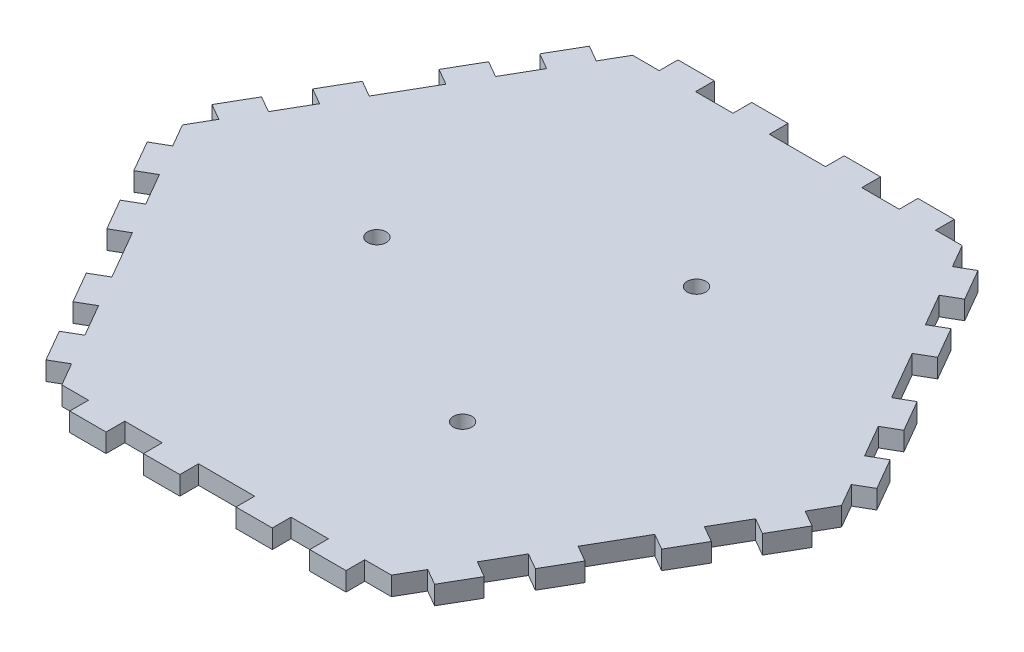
ISO-10303-21;
HEADER;
FILE_DESCRIPTION(('STEP AP214'),'2;1');
FILE_NAME('part.step','',(''),(''),'','','');
FILE_SCHEMA(('AUTOMOTIVE_DESIGN { 1 0 10303 214 1 1 1 1 }'));
ENDSEC;
DATA;
#1=APPLICATION_CONTEXT('core data for automotive mechanical design processes');
#2=APPLICATION_PROTOCOL_DEFINITION('international standard','automotive_design',2000,#1);
#3=PRODUCT_CONTEXT('',#1,'mechanical');
#4=PRODUCT('Part','Part','',(#3));
#5=PRODUCT_RELATED_PRODUCT_CATEGORY('part','',(#4));
#6=PRODUCT_DEFINITION_FORMATION('','',#4);
#7=PRODUCT_DEFINITION_CONTEXT('part definition',#1,'design');
#8=PRODUCT_DEFINITION('design','',#6,#7);
#9=PRODUCT_DEFINITION_SHAPE('','',#8);
#10=(LENGTH_UNIT() NAMED_UNIT(*) SI_UNIT(.MILLI.,.METRE.));
#11=(NAMED_UNIT(*) PLANE_ANGLE_UNIT() SI_UNIT($,.RADIAN.));
#12=(NAMED_UNIT(*) SI_UNIT($,.STERADIAN.) SOLID_ANGLE_UNIT());
#13=UNCERTAINTY_MEASURE_WITH_UNIT(LENGTH_MEASURE(1.E-05),#10,'distance_accuracy_value','');
#14=(GEOMETRIC_REPRESENTATION_CONTEXT(3) GLOBAL_UNCERTAINTY_ASSIGNED_CONTEXT((#13)) GLOBAL_UNIT_ASSIGNED_CONTEXT((#10,
#11,#12)) REPRESENTATION_CONTEXT('',''));
#15=CARTESIAN_POINT('',(0.,0.,0.));
#16=DIRECTION('',(0.,0.,1.));
#17=DIRECTION('',(1.,0.,0.));
#18=AXIS2_PLACEMENT_3D('',#15,#16,#17);
#19=CARTESIAN_POINT('',(0.,2.,32.5));
#20=DIRECTION('',(0.,0.,-1.));
#21=DIRECTION('',(-1.,0.,0.));
#22=AXIS2_PLACEMENT_3D('',#19,#20,#21);
#23=PLANE('',#22);
#24=DIRECTION('',(1.,0.,0.));
#25=VECTOR('',#24,1.);
#26=CARTESIAN_POINT('',(0.,0.,32.5));
#27=LINE('',#26,#25);
#28=CARTESIAN_POINT('',(10.8819418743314,0.,32.5));
#29=VERTEX_POINT('',#28);
#30=CARTESIAN_POINT('',(14.7638837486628,0.,32.5));
#31=VERTEX_POINT('',#30);
#32=EDGE_CURVE('E731',#29,#31,#27,.T.);
#33=ORIENTED_EDGE('',*,*,#32,.T.);
#34=DIRECTION('',(0.,1.,0.));
#35=VECTOR('',#34,1.);
#36=CARTESIAN_POINT('',(14.7638837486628,0.,32.5));
#37=LINE('',#36,#35);
#38=CARTESIAN_POINT('',(14.7638837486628,2.,32.5));
#39=VERTEX_POINT('',#38);
#40=EDGE_CURVE('E1109',#31,#39,#37,.T.);
#41=ORIENTED_EDGE('',*,*,#40,.T.);
#42=DIRECTION('',(1.,0.,0.));
#43=VECTOR('',#42,1.);
#44=CARTESIAN_POINT('',(0.,2.,32.5));
#45=LINE('',#44,#43);
#46=CARTESIAN_POINT('',(10.8819418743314,2.,32.5));
#47=VERTEX_POINT('',#46);
#48=EDGE_CURVE('E764',#47,#39,#45,.T.);
#49=ORIENTED_EDGE('',*,*,#48,.F.);
#50=DIRECTION('',(0.,1.,0.));
#51=VECTOR('',#50,1.);
#52=CARTESIAN_POINT('',(10.8819418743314,0.,32.5));
#53=LINE('',#52,#51);
#54=EDGE_CURVE('E1073',#29,#47,#53,.T.);
#55=ORIENTED_EDGE('',*,*,#54,.F.);
#56=EDGE_LOOP('',(#33,#41,#49,#55));
#57=FACE_BOUND('',#56,.T.);
#58=ADVANCED_FACE('F35',(#57),#23,.F.);
#59=CARTESIAN_POINT('',(-14.7638837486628,0.,32.5));
#60=VERTEX_POINT('',#59);
#61=CARTESIAN_POINT('',(-10.8819418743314,0.,32.5));
#62=VERTEX_POINT('',#61);
#63=EDGE_CURVE('E723',#60,#62,#27,.T.);
#64=ORIENTED_EDGE('',*,*,#63,.T.);
#65=DIRECTION('',(0.,1.,0.));
#66=VECTOR('',#65,1.);
#67=CARTESIAN_POINT('',(-10.8819418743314,0.,32.5));
#68=LINE('',#67,#66);
#69=CARTESIAN_POINT('',(-10.8819418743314,2.,32.5));
#70=VERTEX_POINT('',#69);
#71=EDGE_CURVE('E1038',#62,#70,#68,.T.);
#72=ORIENTED_EDGE('',*,*,#71,.T.);
#73=CARTESIAN_POINT('',(-14.7638837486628,2.,32.5));
#74=VERTEX_POINT('',#73);
#75=EDGE_CURVE('E769',#74,#70,#45,.T.);
#76=ORIENTED_EDGE('',*,*,#75,.F.);
#77=DIRECTION('',(0.,1.,0.));
#78=VECTOR('',#77,1.);
#79=CARTESIAN_POINT('',(-14.7638837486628,0.,32.5));
#80=LINE('',#79,#78);
#81=EDGE_CURVE('E761',#60,#74,#80,.T.);
#82=ORIENTED_EDGE('',*,*,#81,.F.);
#83=EDGE_LOOP('',(#64,#72,#76,#82));
#84=FACE_BOUND('',#83,.T.);
#85=ADVANCED_FACE('F1261',(#84),#23,.F.);
#86=CARTESIAN_POINT('',(-6.88194187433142,2.,32.5));
#87=VERTEX_POINT('',#86);
#88=CARTESIAN_POINT('',(-3.,2.,32.5));
#89=VERTEX_POINT('',#88);
#90=EDGE_CURVE('E1267',#87,#89,#45,.T.);
#91=ORIENTED_EDGE('',*,*,#90,.F.);
#92=DIRECTION('',(0.,1.,0.));
#93=VECTOR('',#92,1.);
#94=CARTESIAN_POINT('',(-6.88194187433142,0.,32.5));
#95=LINE('',#94,#93);
#96=CARTESIAN_POINT('',(-6.88194187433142,0.,32.5));
#97=VERTEX_POINT('',#96);
#98=EDGE_CURVE('E1050',#97,#87,#95,.T.);
#99=ORIENTED_EDGE('',*,*,#98,.F.);
#100=CARTESIAN_POINT('',(-3.,0.,32.5));
#101=VERTEX_POINT('',#100);
#102=EDGE_CURVE('E730',#97,#101,#27,.T.);
#103=ORIENTED_EDGE('',*,*,#102,.T.);
#104=DIRECTION('',(0.,1.,0.));
#105=VECTOR('',#104,1.);
#106=CARTESIAN_POINT('',(-3.,0.,32.5));
#107=LINE('',#106,#105);
#108=EDGE_CURVE('E1010',#101,#89,#107,.T.);
#109=ORIENTED_EDGE('',*,*,#108,.T.);
#110=EDGE_LOOP('',(#91,#99,#103,#109));
#111=FACE_BOUND('',#110,.T.);
#112=ADVANCED_FACE('F1607',(#111),#23,.F.);
#113=CARTESIAN_POINT('',(28.1458256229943,2.,16.25));
#114=DIRECTION('',(-0.866025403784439,0.,-0.5));
#115=DIRECTION('',(-0.5,0.,0.866025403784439));
#116=AXIS2_PLACEMENT_3D('',#113,#114,#115);
#117=PLANE('',#116);
#118=DIRECTION('',(0.5,0.,-0.866025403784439));
#119=VECTOR('',#118,1.);
#120=CARTESIAN_POINT('',(28.1458256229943,0.,16.25));
#121=LINE('',#120,#119);
#122=CARTESIAN_POINT('',(24.7048546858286,0.,22.2099364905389));
#123=VERTEX_POINT('',#122);
#124=CARTESIAN_POINT('',(26.6458256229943,0.,18.8480762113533));
#125=VERTEX_POINT('',#124);
#126=EDGE_CURVE('E713',#123,#125,#121,.T.);
#127=ORIENTED_EDGE('',*,*,#126,.T.);
#128=DIRECTION('',(0.,1.,0.));
#129=VECTOR('',#128,1.);
#130=CARTESIAN_POINT('',(26.6458256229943,0.,18.8480762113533));
#131=LINE('',#130,#129);
#132=CARTESIAN_POINT('',(26.6458256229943,2.,18.8480762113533));
#133=VERTEX_POINT('',#132);
#134=EDGE_CURVE('E1323',#125,#133,#131,.T.);
#135=ORIENTED_EDGE('',*,*,#134,.T.);
#136=DIRECTION('',(0.5,0.,-0.866025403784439));
#137=VECTOR('',#136,1.);
#138=CARTESIAN_POINT('',(28.1458256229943,2.,16.25));
#139=LINE('',#138,#137);
#140=CARTESIAN_POINT('',(24.7048546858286,2.,22.2099364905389));
#141=VERTEX_POINT('',#140);
#142=EDGE_CURVE('E1554',#141,#133,#139,.T.);
#143=ORIENTED_EDGE('',*,*,#142,.F.);
#144=DIRECTION('',(0.,1.,0.));
#145=VECTOR('',#144,1.);
#146=CARTESIAN_POINT('',(24.7048546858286,0.,22.2099364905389));
#147=LINE('',#146,#145);
#148=EDGE_CURVE('E1338',#123,#141,#147,.T.);
#149=ORIENTED_EDGE('',*,*,#148,.F.);
#150=EDGE_LOOP('',(#127,#135,#143,#149));
#151=FACE_BOUND('',#150,.T.);
#152=ADVANCED_FACE('F1552',(#151),#117,.F.);
#153=CARTESIAN_POINT('',(20.7638837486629,2.,29.0358983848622));
#154=VERTEX_POINT('',#153);
#155=CARTESIAN_POINT('',(22.7048546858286,2.,25.6740381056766));
#156=VERTEX_POINT('',#155);
#157=EDGE_CURVE('E774',#154,#156,#139,.T.);
#158=ORIENTED_EDGE('',*,*,#157,.F.);
#159=DIRECTION('',(0.,1.,0.));
#160=VECTOR('',#159,1.);
#161=CARTESIAN_POINT('',(20.7638837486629,0.,29.0358983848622));
#162=LINE('',#161,#160);
#163=CARTESIAN_POINT('',(20.7638837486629,0.,29.0358983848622));
#164=VERTEX_POINT('',#163);
#165=EDGE_CURVE('E1107',#164,#154,#162,.T.);
#166=ORIENTED_EDGE('',*,*,#165,.F.);
#167=CARTESIAN_POINT('',(22.7048546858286,0.,25.6740381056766));
#168=VERTEX_POINT('',#167);
#169=EDGE_CURVE('E706',#164,#168,#121,.T.);
#170=ORIENTED_EDGE('',*,*,#169,.T.);
#171=DIRECTION('',(0.,1.,0.));
#172=VECTOR('',#171,1.);
#173=CARTESIAN_POINT('',(22.7048546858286,0.,25.6740381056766));
#174=LINE('',#173,#172);
#175=EDGE_CURVE('E1327',#168,#156,#174,.T.);
#176=ORIENTED_EDGE('',*,*,#175,.T.);
#177=EDGE_LOOP('',(#158,#166,#170,#176));
#178=FACE_BOUND('',#177,.T.);
#179=ADVANCED_FACE('F1307',(#178),#117,.F.);
#180=CARTESIAN_POINT('',(33.58679656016,0.,6.82596189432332));
#181=VERTEX_POINT('',#180);
#182=CARTESIAN_POINT('',(35.5277674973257,0.,3.46410161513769));
#183=VERTEX_POINT('',#182);
#184=EDGE_CURVE('E714',#181,#183,#121,.T.);
#185=ORIENTED_EDGE('',*,*,#184,.T.);
#186=DIRECTION('',(0.,1.,0.));
#187=VECTOR('',#186,1.);
#188=CARTESIAN_POINT('',(35.5277674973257,0.,3.46410161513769));
#189=LINE('',#188,#187);
#190=CARTESIAN_POINT('',(35.5277674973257,2.,3.46410161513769));
#191=VERTEX_POINT('',#190);
#192=EDGE_CURVE('E944',#183,#191,#189,.T.);
#193=ORIENTED_EDGE('',*,*,#192,.T.);
#194=CARTESIAN_POINT('',(33.58679656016,2.,6.82596189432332));
#195=VERTEX_POINT('',#194);
#196=EDGE_CURVE('E770',#195,#191,#139,.T.);
#197=ORIENTED_EDGE('',*,*,#196,.F.);
#198=DIRECTION('',(0.,1.,0.));
#199=VECTOR('',#198,1.);
#200=CARTESIAN_POINT('',(33.58679656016,0.,6.82596189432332));
#201=LINE('',#200,#199);
#202=EDGE_CURVE('E1361',#181,#195,#201,.T.);
#203=ORIENTED_EDGE('',*,*,#202,.F.);
#204=EDGE_LOOP('',(#185,#193,#197,#203));
#205=FACE_BOUND('',#204,.T.);
#206=ADVANCED_FACE('F1579',(#205),#117,.F.);
#207=CARTESIAN_POINT('',(28.1458256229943,2.,-16.25));
#208=DIRECTION('',(-0.866025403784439,0.,0.5));
#209=DIRECTION('',(0.5,0.,0.866025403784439));
#210=AXIS2_PLACEMENT_3D('',#207,#208,#209);
#211=PLANE('',#210);
#212=DIRECTION('',(-0.5,0.,-0.866025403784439));
#213=VECTOR('',#212,1.);
#214=CARTESIAN_POINT('',(28.1458256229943,0.,-16.25));
#215=LINE('',#214,#213);
#216=CARTESIAN_POINT('',(22.7048546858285,0.,-25.6740381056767));
#217=VERTEX_POINT('',#216);
#218=CARTESIAN_POINT('',(20.7638837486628,0.,-29.0358983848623));
#219=VERTEX_POINT('',#218);
#220=EDGE_CURVE('E697',#217,#219,#215,.T.);
#221=ORIENTED_EDGE('',*,*,#220,.T.);
#222=DIRECTION('',(0.,1.,0.));
#223=VECTOR('',#222,1.);
#224=CARTESIAN_POINT('',(20.7638837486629,0.,-29.0358983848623));
#225=LINE('',#224,#223);
#226=CARTESIAN_POINT('',(20.7638837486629,2.,-29.0358983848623));
#227=VERTEX_POINT('',#226);
#228=EDGE_CURVE('E1142',#219,#227,#225,.T.);
#229=ORIENTED_EDGE('',*,*,#228,.T.);
#230=DIRECTION('',(-0.5,0.,-0.866025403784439));
#231=VECTOR('',#230,1.);
#232=CARTESIAN_POINT('',(28.1458256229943,2.,-16.25));
#233=LINE('',#232,#231);
#234=CARTESIAN_POINT('',(22.7048546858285,2.,-25.6740381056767));
#235=VERTEX_POINT('',#234);
#236=EDGE_CURVE('E775',#235,#227,#233,.T.);
#237=ORIENTED_EDGE('',*,*,#236,.F.);
#238=DIRECTION('',(0.,1.,0.));
#239=VECTOR('',#238,1.);
#240=CARTESIAN_POINT('',(22.7048546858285,0.,-25.6740381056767));
#241=LINE('',#240,#239);
#242=EDGE_CURVE('E1778',#217,#235,#241,.T.);
#243=ORIENTED_EDGE('',*,*,#242,.F.);
#244=EDGE_LOOP('',(#221,#229,#237,#243));
#245=FACE_BOUND('',#244,.T.);
#246=ADVANCED_FACE('F1745',(#245),#211,.F.);
#247=CARTESIAN_POINT('',(35.5277674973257,2.,-3.46410161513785));
#248=VERTEX_POINT('',#247);
#249=CARTESIAN_POINT('',(33.58679656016,2.,-6.82596189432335));
#250=VERTEX_POINT('',#249);
#251=EDGE_CURVE('E779',#248,#250,#233,.T.);
#252=ORIENTED_EDGE('',*,*,#251,.F.);
#253=DIRECTION('',(0.,1.,0.));
#254=VECTOR('',#253,1.);
#255=CARTESIAN_POINT('',(35.5277674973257,0.,-3.46410161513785));
#256=LINE('',#255,#254);
#257=CARTESIAN_POINT('',(35.5277674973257,0.,-3.46410161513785));
#258=VERTEX_POINT('',#257);
#259=EDGE_CURVE('E693',#258,#248,#256,.T.);
#260=ORIENTED_EDGE('',*,*,#259,.F.);
#261=CARTESIAN_POINT('',(33.58679656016,0.,-6.82596189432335));
#262=VERTEX_POINT('',#261);
#263=EDGE_CURVE('E686',#258,#262,#215,.T.);
#264=ORIENTED_EDGE('',*,*,#263,.T.);
#265=DIRECTION('',(0.,1.,0.));
#266=VECTOR('',#265,1.);
#267=CARTESIAN_POINT('',(33.58679656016,0.,-6.82596189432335));
#268=LINE('',#267,#266);
#269=EDGE_CURVE('E667',#262,#250,#268,.T.);
#270=ORIENTED_EDGE('',*,*,#269,.T.);
#271=EDGE_LOOP('',(#252,#260,#264,#270));
#272=FACE_BOUND('',#271,.T.);
#273=ADVANCED_FACE('F692',(#272),#211,.F.);
#274=CARTESIAN_POINT('',(31.58679656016,2.,-10.2900635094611));
#275=VERTEX_POINT('',#274);
#276=CARTESIAN_POINT('',(29.6458256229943,2.,-13.6519237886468));
#277=VERTEX_POINT('',#276);
#278=EDGE_CURVE('E1760',#275,#277,#233,.T.);
#279=ORIENTED_EDGE('',*,*,#278,.F.);
#280=DIRECTION('',(0.,1.,0.));
#281=VECTOR('',#280,1.);
#282=CARTESIAN_POINT('',(31.58679656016,0.,-10.2900635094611));
#283=LINE('',#282,#281);
#284=CARTESIAN_POINT('',(31.58679656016,0.,-10.2900635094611));
#285=VERTEX_POINT('',#284);
#286=EDGE_CURVE('E678',#285,#275,#283,.T.);
#287=ORIENTED_EDGE('',*,*,#286,.F.);
#288=CARTESIAN_POINT('',(29.6458256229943,0.,-13.6519237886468));
#289=VERTEX_POINT('',#288);
#290=EDGE_CURVE('E695',#285,#289,#215,.T.);
#291=ORIENTED_EDGE('',*,*,#290,.T.);
#292=DIRECTION('',(0.,1.,0.));
#293=VECTOR('',#292,1.);
#294=CARTESIAN_POINT('',(29.6458256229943,0.,-13.6519237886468));
#295=LINE('',#294,#293);
#296=EDGE_CURVE('E1508',#289,#277,#295,.T.);
#297=ORIENTED_EDGE('',*,*,#296,.T.);
#298=EDGE_LOOP('',(#279,#287,#291,#297));
#299=FACE_BOUND('',#298,.T.);
#300=ADVANCED_FACE('F1746',(#299),#211,.F.);
#301=CARTESIAN_POINT('',(0.,2.,-32.5));
#302=DIRECTION('',(0.,0.,1.));
#303=DIRECTION('',(1.,0.,0.));
#304=AXIS2_PLACEMENT_3D('',#301,#302,#303);
#305=PLANE('',#304);
#306=DIRECTION('',(-1.,0.,0.));
#307=VECTOR('',#306,1.);
#308=CARTESIAN_POINT('',(0.,0.,-32.5));
#309=LINE('',#308,#307);
#310=CARTESIAN_POINT('',(6.88194187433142,0.,-32.5));
#311=VERTEX_POINT('',#310);
#312=CARTESIAN_POINT('',(2.99999999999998,0.,-32.5000000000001));
#313=VERTEX_POINT('',#312);
#314=EDGE_CURVE('E1452',#311,#313,#309,.T.);
#315=ORIENTED_EDGE('',*,*,#314,.T.);
#316=DIRECTION('',(0.,1.,0.));
#317=VECTOR('',#316,1.);
#318=CARTESIAN_POINT('',(2.99999999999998,0.,-32.5000000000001));
#319=LINE('',#318,#317);
#320=CARTESIAN_POINT('',(2.99999999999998,2.,-32.5000000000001));
#321=VERTEX_POINT('',#320);
#322=EDGE_CURVE('E844',#313,#321,#319,.T.);
#323=ORIENTED_EDGE('',*,*,#322,.T.);
#324=DIRECTION('',(-1.,0.,0.));
#325=VECTOR('',#324,1.);
#326=CARTESIAN_POINT('',(0.,2.,-32.5));
#327=LINE('',#326,#325);
#328=CARTESIAN_POINT('',(6.88194187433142,2.,-32.5));
#329=VERTEX_POINT('',#328);
#330=EDGE_CURVE('E2655',#329,#321,#327,.T.);
#331=ORIENTED_EDGE('',*,*,#330,.F.);
#332=DIRECTION('',(0.,1.,0.));
#333=VECTOR('',#332,1.);
#334=CARTESIAN_POINT('',(6.88194187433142,0.,-32.5));
#335=LINE('',#334,#333);
#336=EDGE_CURVE('E884',#311,#329,#335,.T.);
#337=ORIENTED_EDGE('',*,*,#336,.F.);
#338=EDGE_LOOP('',(#315,#323,#331,#337));
#339=FACE_BOUND('',#338,.T.);
#340=ADVANCED_FACE('F1741',(#339),#305,.F.);
#341=CARTESIAN_POINT('',(14.7638837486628,0.,-32.5000000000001));
#342=VERTEX_POINT('',#341);
#343=CARTESIAN_POINT('',(10.8819418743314,0.,-32.5));
#344=VERTEX_POINT('',#343);
#345=EDGE_CURVE('E701',#342,#344,#309,.T.);
#346=ORIENTED_EDGE('',*,*,#345,.T.);
#347=DIRECTION('',(0.,1.,0.));
#348=VECTOR('',#347,1.);
#349=CARTESIAN_POINT('',(10.8819418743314,0.,-32.5));
#350=LINE('',#349,#348);
#351=CARTESIAN_POINT('',(10.8819418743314,2.,-32.5));
#352=VERTEX_POINT('',#351);
#353=EDGE_CURVE('E872',#344,#352,#350,.T.);
#354=ORIENTED_EDGE('',*,*,#353,.T.);
#355=CARTESIAN_POINT('',(14.7638837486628,2.,-32.5000000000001));
#356=VERTEX_POINT('',#355);
#357=EDGE_CURVE('E784',#356,#352,#327,.T.);
#358=ORIENTED_EDGE('',*,*,#357,.F.);
#359=DIRECTION('',(0.,1.,0.));
#360=VECTOR('',#359,1.);
#361=CARTESIAN_POINT('',(14.7638837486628,0.,-32.5000000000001));
#362=LINE('',#361,#360);
#363=EDGE_CURVE('E1140',#342,#356,#362,.T.);
#364=ORIENTED_EDGE('',*,*,#363,.F.);
#365=EDGE_LOOP('',(#346,#354,#358,#364));
#366=FACE_BOUND('',#365,.T.);
#367=ADVANCED_FACE('F1756',(#366),#305,.F.);
#368=CARTESIAN_POINT('',(-10.8819418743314,0.,-32.5));
#369=VERTEX_POINT('',#368);
#370=CARTESIAN_POINT('',(-14.7638837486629,0.,-32.5000000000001));
#371=VERTEX_POINT('',#370);
#372=EDGE_CURVE('E694',#369,#371,#309,.T.);
#373=ORIENTED_EDGE('',*,*,#372,.T.);
#374=DIRECTION('',(0.,1.,0.));
#375=VECTOR('',#374,1.);
#376=CARTESIAN_POINT('',(-14.7638837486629,0.,-32.5000000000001));
#377=LINE('',#376,#375);
#378=CARTESIAN_POINT('',(-14.7638837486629,2.,-32.5000000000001));
#379=VERTEX_POINT('',#378);
#380=EDGE_CURVE('E933',#371,#379,#377,.T.);
#381=ORIENTED_EDGE('',*,*,#380,.T.);
#382=CARTESIAN_POINT('',(-10.8819418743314,2.,-32.5));
#383=VERTEX_POINT('',#382);
#384=EDGE_CURVE('E780',#383,#379,#327,.T.);
#385=ORIENTED_EDGE('',*,*,#384,.F.);
#386=DIRECTION('',(0.,1.,0.));
#387=VECTOR('',#386,1.);
#388=CARTESIAN_POINT('',(-10.8819418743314,0.,-32.5));
#389=LINE('',#388,#387);
#390=EDGE_CURVE('E1494',#369,#383,#389,.T.);
#391=ORIENTED_EDGE('',*,*,#390,.F.);
#392=EDGE_LOOP('',(#373,#381,#385,#391));
#393=FACE_BOUND('',#392,.T.);
#394=ADVANCED_FACE('F1742',(#393),#305,.F.);
#395=CARTESIAN_POINT('',(-28.1458256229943,2.,-16.25));
#396=DIRECTION('',(0.866025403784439,0.,0.5));
#397=DIRECTION('',(0.5,0.,-0.866025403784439));
#398=AXIS2_PLACEMENT_3D('',#395,#396,#397);
#399=PLANE('',#398);
#400=DIRECTION('',(-0.5,0.,0.866025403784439));
#401=VECTOR('',#400,1.);
#402=CARTESIAN_POINT('',(-28.1458256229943,0.,-16.25));
#403=LINE('',#402,#401);
#404=CARTESIAN_POINT('',(-24.7048546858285,0.,-22.2099364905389));
#405=VERTEX_POINT('',#404);
#406=CARTESIAN_POINT('',(-26.6458256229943,0.,-18.8480762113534));
#407=VERTEX_POINT('',#406);
#408=EDGE_CURVE('E1446',#405,#407,#403,.T.);
#409=ORIENTED_EDGE('',*,*,#408,.T.);
#410=DIRECTION('',(0.,1.,0.));
#411=VECTOR('',#410,1.);
#412=CARTESIAN_POINT('',(-26.6458256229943,0.,-18.8480762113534));
#413=LINE('',#412,#411);
#414=CARTESIAN_POINT('',(-26.6458256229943,2.,-18.8480762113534));
#415=VERTEX_POINT('',#414);
#416=EDGE_CURVE('E987',#407,#415,#413,.T.);
#417=ORIENTED_EDGE('',*,*,#416,.T.);
#418=DIRECTION('',(-0.5,0.,0.866025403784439));
#419=VECTOR('',#418,1.);
#420=CARTESIAN_POINT('',(-28.1458256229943,2.,-16.25));
#421=LINE('',#420,#419);
#422=CARTESIAN_POINT('',(-24.7048546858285,2.,-22.2099364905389));
#423=VERTEX_POINT('',#422);
#424=EDGE_CURVE('E795',#423,#415,#421,.T.);
#425=ORIENTED_EDGE('',*,*,#424,.F.);
#426=DIRECTION('',(0.,1.,0.));
#427=VECTOR('',#426,1.);
#428=CARTESIAN_POINT('',(-24.7048546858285,0.,-22.2099364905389));
#429=LINE('',#428,#427);
#430=EDGE_CURVE('E1388',#405,#423,#429,.T.);
#431=ORIENTED_EDGE('',*,*,#430,.F.);
#432=EDGE_LOOP('',(#409,#417,#425,#431));
#433=FACE_BOUND('',#432,.T.);
#434=ADVANCED_FACE('F1738',(#433),#399,.F.);
#435=CARTESIAN_POINT('',(-20.7638837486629,2.,-29.0358983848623));
#436=VERTEX_POINT('',#435);
#437=CARTESIAN_POINT('',(-22.7048546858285,2.,-25.6740381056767));
#438=VERTEX_POINT('',#437);
#439=EDGE_CURVE('E788',#436,#438,#421,.T.);
#440=ORIENTED_EDGE('',*,*,#439,.F.);
#441=DIRECTION('',(0.,1.,0.));
#442=VECTOR('',#441,1.);
#443=CARTESIAN_POINT('',(-20.7638837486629,0.,-29.0358983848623));
#444=LINE('',#443,#442);
#445=CARTESIAN_POINT('',(-20.7638837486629,0.,-29.0358983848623));
#446=VERTEX_POINT('',#445);
#447=EDGE_CURVE('E958',#446,#436,#444,.T.);
#448=ORIENTED_EDGE('',*,*,#447,.F.);
#449=CARTESIAN_POINT('',(-22.7048546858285,0.,-25.6740381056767));
#450=VERTEX_POINT('',#449);
#451=EDGE_CURVE('E1442',#446,#450,#403,.T.);
#452=ORIENTED_EDGE('',*,*,#451,.T.);
#453=DIRECTION('',(0.,1.,0.));
#454=VECTOR('',#453,1.);
#455=CARTESIAN_POINT('',(-22.7048546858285,0.,-25.6740381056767));
#456=LINE('',#455,#454);
#457=EDGE_CURVE('E1377',#450,#438,#456,.T.);
#458=ORIENTED_EDGE('',*,*,#457,.T.);
#459=EDGE_LOOP('',(#440,#448,#452,#458));
#460=FACE_BOUND('',#459,.T.);
#461=ADVANCED_FACE('F1985',(#460),#399,.F.);
#462=CARTESIAN_POINT('',(-33.58679656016,2.,-6.82596189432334));
#463=VERTEX_POINT('',#462);
#464=CARTESIAN_POINT('',(-35.5277674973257,2.,-3.46410161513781));
#465=VERTEX_POINT('',#464);
#466=EDGE_CURVE('E785',#463,#465,#421,.T.);
#467=ORIENTED_EDGE('',*,*,#466,.F.);
#468=DIRECTION('',(0.,1.,0.));
#469=VECTOR('',#468,1.);
#470=CARTESIAN_POINT('',(-33.58679656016,0.,-6.82596189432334));
#471=LINE('',#470,#469);
#472=CARTESIAN_POINT('',(-33.58679656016,0.,-6.82596189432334));
#473=VERTEX_POINT('',#472);
#474=EDGE_CURVE('E825',#473,#463,#471,.T.);
#475=ORIENTED_EDGE('',*,*,#474,.F.);
#476=CARTESIAN_POINT('',(-35.5277674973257,0.,-3.46410161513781));
#477=VERTEX_POINT('',#476);
#478=EDGE_CURVE('E1417',#473,#477,#403,.T.);
#479=ORIENTED_EDGE('',*,*,#478,.T.);
#480=DIRECTION('',(0.,1.,0.));
#481=VECTOR('',#480,1.);
#482=CARTESIAN_POINT('',(-35.5277674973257,0.,-3.46410161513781));
#483=LINE('',#482,#481);
#484=EDGE_CURVE('E1130',#477,#465,#483,.T.);
#485=ORIENTED_EDGE('',*,*,#484,.T.);
#486=EDGE_LOOP('',(#467,#475,#479,#485));
#487=FACE_BOUND('',#486,.T.);
#488=ADVANCED_FACE('F1414',(#487),#399,.F.);
#489=CARTESIAN_POINT('',(-28.1458256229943,2.,16.25));
#490=DIRECTION('',(0.866025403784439,0.,-0.5));
#491=DIRECTION('',(-0.5,0.,-0.866025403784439));
#492=AXIS2_PLACEMENT_3D('',#489,#490,#491);
#493=PLANE('',#492);
#494=DIRECTION('',(0.5,0.,0.866025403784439));
#495=VECTOR('',#494,1.);
#496=CARTESIAN_POINT('',(-28.1458256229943,2.,16.25));
#497=LINE('',#496,#495);
#498=CARTESIAN_POINT('',(-22.7048546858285,2.,25.6740381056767));
#499=VERTEX_POINT('',#498);
#500=CARTESIAN_POINT('',(-20.7638837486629,2.,29.0358983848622));
#501=VERTEX_POINT('',#500);
#502=EDGE_CURVE('E46',#499,#501,#497,.T.);
#503=ORIENTED_EDGE('',*,*,#502,.F.);
#504=DIRECTION('',(0.,1.,0.));
#505=VECTOR('',#504,1.);
#506=CARTESIAN_POINT('',(-22.7048546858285,0.,25.6740381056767));
#507=LINE('',#506,#505);
#508=CARTESIAN_POINT('',(-22.7048546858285,0.,25.6740381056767));
#509=VERTEX_POINT('',#508);
#510=EDGE_CURVE('E910',#509,#499,#507,.T.);
#511=ORIENTED_EDGE('',*,*,#510,.F.);
#512=DIRECTION('',(0.5,0.,0.866025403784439));
#513=VECTOR('',#512,1.);
#514=CARTESIAN_POINT('',(-28.1458256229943,0.,16.25));
#515=LINE('',#514,#513);
#516=CARTESIAN_POINT('',(-20.7638837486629,0.,29.0358983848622));
#517=VERTEX_POINT('',#516);
#518=EDGE_CURVE('E39',#509,#517,#515,.T.);
#519=ORIENTED_EDGE('',*,*,#518,.T.);
#520=DIRECTION('',(0.,1.,0.));
#521=VECTOR('',#520,1.);
#522=CARTESIAN_POINT('',(-20.7638837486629,0.,29.0358983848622));
#523=LINE('',#522,#521);
#524=EDGE_CURVE('E739',#517,#501,#523,.T.);
#525=ORIENTED_EDGE('',*,*,#524,.T.);
#526=EDGE_LOOP('',(#503,#511,#519,#525));
#527=FACE_BOUND('',#526,.T.);
#528=ADVANCED_FACE('F1735',(#527),#493,.F.);
#529=CARTESIAN_POINT('',(-35.5277674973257,0.,3.46410161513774));
#530=VERTEX_POINT('',#529);
#531=CARTESIAN_POINT('',(-33.58679656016,0.,6.82596189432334));
#532=VERTEX_POINT('',#531);
#533=EDGE_CURVE('E768',#530,#532,#515,.T.);
#534=ORIENTED_EDGE('',*,*,#533,.T.);
#535=DIRECTION('',(0.,1.,0.));
#536=VECTOR('',#535,1.);
#537=CARTESIAN_POINT('',(-33.58679656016,0.,6.82596189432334));
#538=LINE('',#537,#536);
#539=CARTESIAN_POINT('',(-33.58679656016,2.,6.82596189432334));
#540=VERTEX_POINT('',#539);
#541=EDGE_CURVE('E1215',#532,#540,#538,.T.);
#542=ORIENTED_EDGE('',*,*,#541,.T.);
#543=CARTESIAN_POINT('',(-35.5277674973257,2.,3.46410161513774));
#544=VERTEX_POINT('',#543);
#545=EDGE_CURVE('E11',#544,#540,#497,.T.);
#546=ORIENTED_EDGE('',*,*,#545,.F.);
#547=DIRECTION('',(0.,1.,0.));
#548=VECTOR('',#547,1.);
#549=CARTESIAN_POINT('',(-35.5277674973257,0.,3.46410161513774));
#550=LINE('',#549,#548);
#551=EDGE_CURVE('E1158',#530,#544,#550,.T.);
#552=ORIENTED_EDGE('',*,*,#551,.F.);
#553=EDGE_LOOP('',(#534,#542,#546,#552));
#554=FACE_BOUND('',#553,.T.);
#555=ADVANCED_FACE('F1437',(#554),#493,.F.);
#556=CARTESIAN_POINT('',(-31.58679656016,2.,10.2900635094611));
#557=VERTEX_POINT('',#556);
#558=CARTESIAN_POINT('',(-29.6458256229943,2.,13.6519237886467));
#559=VERTEX_POINT('',#558);
#560=EDGE_CURVE('E44',#557,#559,#497,.T.);
#561=ORIENTED_EDGE('',*,*,#560,.F.);
#562=DIRECTION('',(0.,1.,0.));
#563=VECTOR('',#562,1.);
#564=CARTESIAN_POINT('',(-31.58679656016,0.,10.2900635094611));
#565=LINE('',#564,#563);
#566=CARTESIAN_POINT('',(-31.58679656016,0.,10.2900635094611));
#567=VERTEX_POINT('',#566);
#568=EDGE_CURVE('E1225',#567,#557,#565,.T.);
#569=ORIENTED_EDGE('',*,*,#568,.F.);
#570=CARTESIAN_POINT('',(-29.6458256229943,0.,13.6519237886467));
#571=VERTEX_POINT('',#570);
#572=EDGE_CURVE('E1439',#567,#571,#515,.T.);
#573=ORIENTED_EDGE('',*,*,#572,.T.);
#574=DIRECTION('',(0.,1.,0.));
#575=VECTOR('',#574,1.);
#576=CARTESIAN_POINT('',(-29.6458256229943,0.,13.6519237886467));
#577=LINE('',#576,#575);
#578=EDGE_CURVE('E1189',#571,#559,#577,.T.);
#579=ORIENTED_EDGE('',*,*,#578,.T.);
#580=EDGE_LOOP('',(#561,#569,#573,#579));
#581=FACE_BOUND('',#580,.T.);
#582=ADVANCED_FACE('F1609',(#581),#493,.F.);
#583=CARTESIAN_POINT('',(3.,0.,32.5));
#584=VERTEX_POINT('',#583);
#585=CARTESIAN_POINT('',(6.88194187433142,0.,32.5));
#586=VERTEX_POINT('',#585);
#587=EDGE_CURVE('E737',#584,#586,#27,.T.);
#588=ORIENTED_EDGE('',*,*,#587,.T.);
#589=DIRECTION('',(0.,1.,0.));
#590=VECTOR('',#589,1.);
#591=CARTESIAN_POINT('',(6.88194187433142,0.,32.5));
#592=LINE('',#591,#590);
#593=CARTESIAN_POINT('',(6.88194187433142,2.,32.5));
#594=VERTEX_POINT('',#593);
#595=EDGE_CURVE('E1075',#586,#594,#592,.T.);
#596=ORIENTED_EDGE('',*,*,#595,.T.);
#597=CARTESIAN_POINT('',(3.,2.,32.5));
#598=VERTEX_POINT('',#597);
#599=EDGE_CURVE('E767',#598,#594,#45,.T.);
#600=ORIENTED_EDGE('',*,*,#599,.F.);
#601=DIRECTION('',(0.,1.,0.));
#602=VECTOR('',#601,1.);
#603=CARTESIAN_POINT('',(3.,0.,32.5));
#604=LINE('',#603,#602);
#605=EDGE_CURVE('E1024',#584,#598,#604,.T.);
#606=ORIENTED_EDGE('',*,*,#605,.F.);
#607=EDGE_LOOP('',(#588,#596,#600,#606));
#608=FACE_BOUND('',#607,.T.);
#609=ADVANCED_FACE('F37',(#608),#23,.F.);
#610=CARTESIAN_POINT('',(29.6458256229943,2.,13.6519237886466));
#611=VERTEX_POINT('',#610);
#612=CARTESIAN_POINT('',(31.58679656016,2.,10.2900635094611));
#613=VERTEX_POINT('',#612);
#614=EDGE_CURVE('E773',#611,#613,#139,.T.);
#615=ORIENTED_EDGE('',*,*,#614,.F.);
#616=DIRECTION('',(0.,1.,0.));
#617=VECTOR('',#616,1.);
#618=CARTESIAN_POINT('',(29.6458256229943,0.,13.6519237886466));
#619=LINE('',#618,#617);
#620=CARTESIAN_POINT('',(29.6458256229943,0.,13.6519237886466));
#621=VERTEX_POINT('',#620);
#622=EDGE_CURVE('E1544',#621,#611,#619,.T.);
#623=ORIENTED_EDGE('',*,*,#622,.F.);
#624=CARTESIAN_POINT('',(31.58679656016,0.,10.2900635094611));
#625=VERTEX_POINT('',#624);
#626=EDGE_CURVE('E720',#621,#625,#121,.T.);
#627=ORIENTED_EDGE('',*,*,#626,.T.);
#628=DIRECTION('',(0.,1.,0.));
#629=VECTOR('',#628,1.);
#630=CARTESIAN_POINT('',(31.58679656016,0.,10.2900635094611));
#631=LINE('',#630,#629);
#632=EDGE_CURVE('E1363',#625,#613,#631,.T.);
#633=ORIENTED_EDGE('',*,*,#632,.T.);
#634=EDGE_LOOP('',(#615,#623,#627,#633));
#635=FACE_BOUND('',#634,.T.);
#636=ADVANCED_FACE('F1567',(#635),#117,.F.);
#637=CARTESIAN_POINT('',(26.6458256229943,0.,-18.8480762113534));
#638=VERTEX_POINT('',#637);
#639=CARTESIAN_POINT('',(24.7048546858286,0.,-22.2099364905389));
#640=VERTEX_POINT('',#639);
#641=EDGE_CURVE('E703',#638,#640,#215,.T.);
#642=ORIENTED_EDGE('',*,*,#641,.T.);
#643=DIRECTION('',(0.,1.,0.));
#644=VECTOR('',#643,1.);
#645=CARTESIAN_POINT('',(24.7048546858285,0.,-22.2099364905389));
#646=LINE('',#645,#644);
#647=CARTESIAN_POINT('',(24.7048546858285,2.,-22.2099364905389));
#648=VERTEX_POINT('',#647);
#649=EDGE_CURVE('E1774',#640,#648,#646,.T.);
#650=ORIENTED_EDGE('',*,*,#649,.T.);
#651=CARTESIAN_POINT('',(26.6458256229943,2.,-18.8480762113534));
#652=VERTEX_POINT('',#651);
#653=EDGE_CURVE('E778',#652,#648,#233,.T.);
#654=ORIENTED_EDGE('',*,*,#653,.F.);
#655=DIRECTION('',(0.,1.,0.));
#656=VECTOR('',#655,1.);
#657=CARTESIAN_POINT('',(26.6458256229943,0.,-18.8480762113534));
#658=LINE('',#657,#656);
#659=EDGE_CURVE('E1520',#638,#652,#658,.T.);
#660=ORIENTED_EDGE('',*,*,#659,.F.);
#661=EDGE_LOOP('',(#642,#650,#654,#660));
#662=FACE_BOUND('',#661,.T.);
#663=ADVANCED_FACE('F1614',(#662),#211,.F.);
#664=CARTESIAN_POINT('',(-3.00000000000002,2.,-32.5000000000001));
#665=VERTEX_POINT('',#664);
#666=CARTESIAN_POINT('',(-6.88194187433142,2.,-32.5));
#667=VERTEX_POINT('',#666);
#668=EDGE_CURVE('E783',#665,#667,#327,.T.);
#669=ORIENTED_EDGE('',*,*,#668,.F.);
#670=DIRECTION('',(0.,1.,0.));
#671=VECTOR('',#670,1.);
#672=CARTESIAN_POINT('',(-3.00000000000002,0.,-32.5000000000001));
#673=LINE('',#672,#671);
#674=CARTESIAN_POINT('',(-3.00000000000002,0.,-32.5000000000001));
#675=VERTEX_POINT('',#674);
#676=EDGE_CURVE('E858',#675,#665,#673,.T.);
#677=ORIENTED_EDGE('',*,*,#676,.F.);
#678=CARTESIAN_POINT('',(-6.88194187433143,0.,-32.5));
#679=VERTEX_POINT('',#678);
#680=EDGE_CURVE('E699',#675,#679,#309,.T.);
#681=ORIENTED_EDGE('',*,*,#680,.T.);
#682=DIRECTION('',(0.,1.,0.));
#683=VECTOR('',#682,1.);
#684=CARTESIAN_POINT('',(-6.88194187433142,0.,-32.5));
#685=LINE('',#684,#683);
#686=EDGE_CURVE('E1467',#679,#667,#685,.T.);
#687=ORIENTED_EDGE('',*,*,#686,.T.);
#688=EDGE_LOOP('',(#669,#677,#681,#687));
#689=FACE_BOUND('',#688,.T.);
#690=ADVANCED_FACE('F1466',(#689),#305,.F.);
#691=CARTESIAN_POINT('',(-29.6458256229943,2.,-13.6519237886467));
#692=VERTEX_POINT('',#691);
#693=CARTESIAN_POINT('',(-31.58679656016,2.,-10.2900635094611));
#694=VERTEX_POINT('',#693);
#695=EDGE_CURVE('E787',#692,#694,#421,.T.);
#696=ORIENTED_EDGE('',*,*,#695,.F.);
#697=DIRECTION('',(0.,1.,0.));
#698=VECTOR('',#697,1.);
#699=CARTESIAN_POINT('',(-29.6458256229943,0.,-13.6519237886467));
#700=LINE('',#699,#698);
#701=CARTESIAN_POINT('',(-29.6458256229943,0.,-13.6519237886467));
#702=VERTEX_POINT('',#701);
#703=EDGE_CURVE('E818',#702,#692,#700,.T.);
#704=ORIENTED_EDGE('',*,*,#703,.F.);
#705=CARTESIAN_POINT('',(-31.58679656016,0.,-10.2900635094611));
#706=VERTEX_POINT('',#705);
#707=EDGE_CURVE('E821',#702,#706,#403,.T.);
#708=ORIENTED_EDGE('',*,*,#707,.T.);
#709=DIRECTION('',(0.,1.,0.));
#710=VECTOR('',#709,1.);
#711=CARTESIAN_POINT('',(-31.58679656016,0.,-10.2900635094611));
#712=LINE('',#711,#710);
#713=EDGE_CURVE('E820',#706,#694,#712,.T.);
#714=ORIENTED_EDGE('',*,*,#713,.T.);
#715=EDGE_LOOP('',(#696,#704,#708,#714));
#716=FACE_BOUND('',#715,.T.);
#717=ADVANCED_FACE('F816',(#716),#399,.F.);
#718=CARTESIAN_POINT('',(-26.6458256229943,0.,18.8480762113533));
#719=VERTEX_POINT('',#718);
#720=CARTESIAN_POINT('',(-24.7048546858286,0.,22.2099364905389));
#721=VERTEX_POINT('',#720);
#722=EDGE_CURVE('E1441',#719,#721,#515,.T.);
#723=ORIENTED_EDGE('',*,*,#722,.T.);
#724=DIRECTION('',(0.,1.,0.));
#725=VECTOR('',#724,1.);
#726=CARTESIAN_POINT('',(-24.7048546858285,0.,22.2099364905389));
#727=LINE('',#726,#725);
#728=CARTESIAN_POINT('',(-24.7048546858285,2.,22.2099364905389));
#729=VERTEX_POINT('',#728);
#730=EDGE_CURVE('E912',#721,#729,#727,.T.);
#731=ORIENTED_EDGE('',*,*,#730,.T.);
#732=CARTESIAN_POINT('',(-26.6458256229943,2.,18.8480762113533));
#733=VERTEX_POINT('',#732);
#734=EDGE_CURVE('E789',#733,#729,#497,.T.);
#735=ORIENTED_EDGE('',*,*,#734,.F.);
#736=DIRECTION('',(0.,1.,0.));
#737=VECTOR('',#736,1.);
#738=CARTESIAN_POINT('',(-26.6458256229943,0.,18.8480762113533));
#739=LINE('',#738,#737);
#740=EDGE_CURVE('E1201',#719,#733,#739,.T.);
#741=ORIENTED_EDGE('',*,*,#740,.F.);
#742=EDGE_LOOP('',(#723,#731,#735,#741));
#743=FACE_BOUND('',#742,.T.);
#744=ADVANCED_FACE('F1617',(#743),#493,.F.);
#745=CARTESIAN_POINT('',(0.,2.,0.));
#746=DIRECTION('',(0.,1.,0.));
#747=DIRECTION('',(0.,0.,1.));
#748=AXIS2_PLACEMENT_3D('',#745,#746,#747);
#749=PLANE('',#748);
#750=CARTESIAN_POINT('',(7.21687836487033,2.,12.5));
#751=DIRECTION('',(0.,1.,0.));
#752=DIRECTION('',(0.,0.,1.));
#753=AXIS2_PLACEMENT_3D('',#750,#751,#752);
#754=CIRCLE('',#753,1.);
#755=CARTESIAN_POINT('',(7.21687836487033,2.,13.5));
#756=VERTEX_POINT('',#755);
#757=EDGE_CURVE('E1356',#756,#756,#754,.F.);
#758=ORIENTED_EDGE('',*,*,#757,.T.);
#759=EDGE_LOOP('',(#758));
#760=FACE_BOUND('',#759,.T.);
#761=CARTESIAN_POINT('',(7.21687836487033,2.,-12.5));
#762=DIRECTION('',(0.,1.,0.));
#763=DIRECTION('',(0.,0.,1.));
#764=AXIS2_PLACEMENT_3D('',#761,#762,#763);
#765=CIRCLE('',#764,0.999999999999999);
#766=CARTESIAN_POINT('',(7.21687836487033,2.,-11.5));
#767=VERTEX_POINT('',#766);
#768=EDGE_CURVE('E1813',#767,#767,#765,.F.);
#769=ORIENTED_EDGE('',*,*,#768,.T.);
#770=EDGE_LOOP('',(#769));
#771=FACE_BOUND('',#770,.T.);
#772=CARTESIAN_POINT('',(-14.4337567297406,2.,0.));
#773=DIRECTION('',(0.,1.,0.));
#774=DIRECTION('',(0.,0.,1.));
#775=AXIS2_PLACEMENT_3D('',#772,#773,#774);
#776=CIRCLE('',#775,1.);
#777=CARTESIAN_POINT('',(-14.4337567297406,2.,1.));
#778=VERTEX_POINT('',#777);
#779=EDGE_CURVE('E1816',#778,#778,#776,.F.);
#780=ORIENTED_EDGE('',*,*,#779,.T.);
#781=EDGE_LOOP('',(#780));
#782=FACE_BOUND('',#781,.T.);
#783=DIRECTION('',(0.866025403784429,0.,-0.500000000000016));
#784=VECTOR('',#783,1.);
#785=CARTESIAN_POINT('',(-22.7048546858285,2.,25.6740381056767));
#786=LINE('',#785,#784);
#787=CARTESIAN_POINT('',(-20.9728038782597,2.,24.6740381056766));
#788=VERTEX_POINT('',#787);
#789=EDGE_CURVE('E892',#499,#788,#786,.T.);
#790=ORIENTED_EDGE('',*,*,#789,.F.);
#791=ORIENTED_EDGE('',*,*,#502,.T.);
#792=DIRECTION('',(-0.866025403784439,0.,0.5));
#793=VECTOR('',#792,1.);
#794=CARTESIAN_POINT('',(-19.031832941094,2.,28.0358983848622));
#795=LINE('',#794,#793);
#796=CARTESIAN_POINT('',(-19.031832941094,2.,28.0358983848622));
#797=VERTEX_POINT('',#796);
#798=EDGE_CURVE('E755',#797,#501,#795,.T.);
#799=ORIENTED_EDGE('',*,*,#798,.F.);
#800=DIRECTION('',(-0.500000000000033,0.,-0.86602540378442));
#801=VECTOR('',#800,1.);
#802=CARTESIAN_POINT('',(-19.031832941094,2.,28.0358983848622));
#803=LINE('',#802,#801);
#804=CARTESIAN_POINT('',(-17.6091832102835,2.,30.5));
#805=VERTEX_POINT('',#804);
#806=EDGE_CURVE('E1244',#805,#797,#803,.T.);
#807=ORIENTED_EDGE('',*,*,#806,.F.);
#808=DIRECTION('',(-1.,0.,0.));
#809=VECTOR('',#808,1.);
#810=CARTESIAN_POINT('',(-17.6091832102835,2.,30.5));
#811=LINE('',#810,#809);
#812=CARTESIAN_POINT('',(-14.7638837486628,2.,30.5));
#813=VERTEX_POINT('',#812);
#814=EDGE_CURVE('E1242',#813,#805,#811,.T.);
#815=ORIENTED_EDGE('',*,*,#814,.F.);
#816=DIRECTION('',(0.,0.,-1.));
#817=VECTOR('',#816,1.);
#818=CARTESIAN_POINT('',(-14.7638837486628,2.,30.5));
#819=LINE('',#818,#817);
#820=EDGE_CURVE('E1021',#74,#813,#819,.T.);
#821=ORIENTED_EDGE('',*,*,#820,.F.);
#822=ORIENTED_EDGE('',*,*,#75,.T.);
#823=DIRECTION('',(0.,0.,1.));
#824=VECTOR('',#823,1.);
#825=CARTESIAN_POINT('',(-10.8819418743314,2.,32.5));
#826=LINE('',#825,#824);
#827=CARTESIAN_POINT('',(-10.8819418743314,2.,30.5));
#828=VERTEX_POINT('',#827);
#829=EDGE_CURVE('E1039',#828,#70,#826,.T.);
#830=ORIENTED_EDGE('',*,*,#829,.F.);
#831=DIRECTION('',(-1.,0.,0.));
#832=VECTOR('',#831,1.);
#833=CARTESIAN_POINT('',(-10.8819418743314,2.,30.5));
#834=LINE('',#833,#832);
#835=CARTESIAN_POINT('',(-6.88194187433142,2.,30.5));
#836=VERTEX_POINT('',#835);
#837=EDGE_CURVE('E1032',#836,#828,#834,.T.);
#838=ORIENTED_EDGE('',*,*,#837,.F.);
#839=DIRECTION('',(0.,0.,-1.));
#840=VECTOR('',#839,1.);
#841=CARTESIAN_POINT('',(-6.88194187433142,2.,32.5));
#842=LINE('',#841,#840);
#843=EDGE_CURVE('E1041',#87,#836,#842,.T.);
#844=ORIENTED_EDGE('',*,*,#843,.F.);
#845=ORIENTED_EDGE('',*,*,#90,.T.);
#846=DIRECTION('',(0.,0.,1.));
#847=VECTOR('',#846,1.);
#848=CARTESIAN_POINT('',(-3.,2.,32.5));
#849=LINE('',#848,#847);
#850=CARTESIAN_POINT('',(-3.,2.,30.5));
#851=VERTEX_POINT('',#850);
#852=EDGE_CURVE('E1011',#851,#89,#849,.T.);
#853=ORIENTED_EDGE('',*,*,#852,.F.);
#854=DIRECTION('',(-1.,0.,0.));
#855=VECTOR('',#854,1.);
#856=CARTESIAN_POINT('',(3.,2.,30.5));
#857=LINE('',#856,#855);
#858=CARTESIAN_POINT('',(3.,2.,30.5));
#859=VERTEX_POINT('',#858);
#860=EDGE_CURVE('E1004',#859,#851,#857,.T.);
#861=ORIENTED_EDGE('',*,*,#860,.F.);
#862=DIRECTION('',(0.,0.,-1.));
#863=VECTOR('',#862,1.);
#864=CARTESIAN_POINT('',(3.,2.,32.5));
#865=LINE('',#864,#863);
#866=EDGE_CURVE('E1013',#598,#859,#865,.T.);
#867=ORIENTED_EDGE('',*,*,#866,.F.);
#868=ORIENTED_EDGE('',*,*,#599,.T.);
#869=DIRECTION('',(0.,0.,1.));
#870=VECTOR('',#869,1.);
#871=CARTESIAN_POINT('',(6.88194187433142,2.,32.5));
#872=LINE('',#871,#870);
#873=CARTESIAN_POINT('',(6.88194187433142,2.,30.5));
#874=VERTEX_POINT('',#873);
#875=EDGE_CURVE('E1067',#874,#594,#872,.T.);
#876=ORIENTED_EDGE('',*,*,#875,.F.);
#877=DIRECTION('',(-1.,0.,0.));
#878=VECTOR('',#877,1.);
#879=CARTESIAN_POINT('',(10.8819418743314,2.,30.5));
#880=LINE('',#879,#878);
#881=CARTESIAN_POINT('',(10.8819418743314,2.,30.5));
#882=VERTEX_POINT('',#881);
#883=EDGE_CURVE('E1064',#882,#874,#880,.T.);
#884=ORIENTED_EDGE('',*,*,#883,.F.);
#885=DIRECTION('',(0.,0.,-1.));
#886=VECTOR('',#885,1.);
#887=CARTESIAN_POINT('',(10.8819418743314,2.,32.5));
#888=LINE('',#887,#886);
#889=EDGE_CURVE('E1057',#47,#882,#888,.T.);
#890=ORIENTED_EDGE('',*,*,#889,.F.);
#891=ORIENTED_EDGE('',*,*,#48,.T.);
#892=DIRECTION('',(0.,0.,1.));
#893=VECTOR('',#892,1.);
#894=CARTESIAN_POINT('',(14.7638837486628,2.,30.5));
#895=LINE('',#894,#893);
#896=CARTESIAN_POINT('',(14.7638837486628,2.,30.5));
#897=VERTEX_POINT('',#896);
#898=EDGE_CURVE('E1096',#897,#39,#895,.T.);
#899=ORIENTED_EDGE('',*,*,#898,.F.);
#900=DIRECTION('',(-1.,0.,0.));
#901=VECTOR('',#900,1.);
#902=CARTESIAN_POINT('',(17.6091832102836,2.,30.5));
#903=LINE('',#902,#901);
#904=CARTESIAN_POINT('',(17.6091832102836,2.,30.5));
#905=VERTEX_POINT('',#904);
#906=EDGE_CURVE('E1093',#905,#897,#903,.T.);
#907=ORIENTED_EDGE('',*,*,#906,.F.);
#908=DIRECTION('',(-0.500000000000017,0.,0.866025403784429));
#909=VECTOR('',#908,1.);
#910=CARTESIAN_POINT('',(19.031832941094,2.,28.0358983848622));
#911=LINE('',#910,#909);
#912=CARTESIAN_POINT('',(19.031832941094,2.,28.0358983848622));
#913=VERTEX_POINT('',#912);
#914=EDGE_CURVE('E1083',#913,#905,#911,.T.);
#915=ORIENTED_EDGE('',*,*,#914,.F.);
#916=DIRECTION('',(-0.866025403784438,0.,-0.500000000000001));
#917=VECTOR('',#916,1.);
#918=CARTESIAN_POINT('',(19.031832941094,2.,28.0358983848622));
#919=LINE('',#918,#917);
#920=EDGE_CURVE('E1099',#154,#913,#919,.T.);
#921=ORIENTED_EDGE('',*,*,#920,.F.);
#922=ORIENTED_EDGE('',*,*,#157,.T.);
#923=DIRECTION('',(0.866025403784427,0.,0.500000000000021));
#924=VECTOR('',#923,1.);
#925=CARTESIAN_POINT('',(22.7048546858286,2.,25.6740381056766));
#926=LINE('',#925,#924);
#927=CARTESIAN_POINT('',(20.9728038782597,2.,24.6740381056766));
#928=VERTEX_POINT('',#927);
#929=EDGE_CURVE('E1328',#928,#156,#926,.T.);
#930=ORIENTED_EDGE('',*,*,#929,.F.);
#931=DIRECTION('',(-0.499999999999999,0.,0.866025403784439));
#932=VECTOR('',#931,1.);
#933=CARTESIAN_POINT('',(20.9728038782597,2.,24.6740381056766));
#934=LINE('',#933,#932);
#935=CARTESIAN_POINT('',(22.9728038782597,2.,21.2099364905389));
#936=VERTEX_POINT('',#935);
#937=EDGE_CURVE('E1316',#936,#928,#934,.T.);
#938=ORIENTED_EDGE('',*,*,#937,.F.);
#939=DIRECTION('',(-0.866025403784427,0.,-0.50000000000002));
#940=VECTOR('',#939,1.);
#941=CARTESIAN_POINT('',(24.7048546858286,2.,22.2099364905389));
#942=LINE('',#941,#940);
#943=EDGE_CURVE('E1320',#141,#936,#942,.T.);
#944=ORIENTED_EDGE('',*,*,#943,.F.);
#945=ORIENTED_EDGE('',*,*,#142,.T.);
#946=DIRECTION('',(0.866025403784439,0.,0.499999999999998));
#947=VECTOR('',#946,1.);
#948=CARTESIAN_POINT('',(26.6458256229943,2.,18.8480762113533));
#949=LINE('',#948,#947);
#950=CARTESIAN_POINT('',(24.9137748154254,2.,17.8480762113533));
#951=VERTEX_POINT('',#950);
#952=EDGE_CURVE('E1335',#951,#133,#949,.T.);
#953=ORIENTED_EDGE('',*,*,#952,.F.);
#954=DIRECTION('',(-0.499999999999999,0.,0.866025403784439));
#955=VECTOR('',#954,1.);
#956=CARTESIAN_POINT('',(27.9137748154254,2.,12.6519237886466));
#957=LINE('',#956,#955);
#958=CARTESIAN_POINT('',(27.9137748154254,2.,12.6519237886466));
#959=VERTEX_POINT('',#958);
#960=EDGE_CURVE('E1528',#959,#951,#957,.T.);
#961=ORIENTED_EDGE('',*,*,#960,.F.);
#962=DIRECTION('',(-0.866025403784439,0.,-0.499999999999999));
#963=VECTOR('',#962,1.);
#964=CARTESIAN_POINT('',(29.6458256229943,2.,13.6519237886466));
#965=LINE('',#964,#963);
#966=EDGE_CURVE('E1535',#611,#959,#965,.T.);
#967=ORIENTED_EDGE('',*,*,#966,.F.);
#968=ORIENTED_EDGE('',*,*,#614,.T.);
#969=DIRECTION('',(0.866025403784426,0.,0.500000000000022));
#970=VECTOR('',#969,1.);
#971=CARTESIAN_POINT('',(31.58679656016,2.,10.2900635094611));
#972=LINE('',#971,#970);
#973=CARTESIAN_POINT('',(29.8547457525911,2.,9.29006350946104));
#974=VERTEX_POINT('',#973);
#975=EDGE_CURVE('E1355',#974,#613,#972,.T.);
#976=ORIENTED_EDGE('',*,*,#975,.F.);
#977=DIRECTION('',(-0.5,0.,0.866025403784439));
#978=VECTOR('',#977,1.);
#979=CARTESIAN_POINT('',(31.8547457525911,2.,5.82596189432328));
#980=LINE('',#979,#978);
#981=CARTESIAN_POINT('',(31.8547457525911,2.,5.82596189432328));
#982=VERTEX_POINT('',#981);
#983=EDGE_CURVE('E1352',#982,#974,#980,.T.);
#984=ORIENTED_EDGE('',*,*,#983,.F.);
#985=DIRECTION('',(-0.866025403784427,0.,-0.500000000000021));
#986=VECTOR('',#985,1.);
#987=CARTESIAN_POINT('',(33.58679656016,2.,6.82596189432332));
#988=LINE('',#987,#986);
#989=EDGE_CURVE('E1345',#195,#982,#988,.T.);
#990=ORIENTED_EDGE('',*,*,#989,.F.);
#991=ORIENTED_EDGE('',*,*,#196,.T.);
#992=DIRECTION('',(0.866025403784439,0.,0.5));
#993=VECTOR('',#992,1.);
#994=CARTESIAN_POINT('',(33.7957166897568,2.,2.46410161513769));
#995=LINE('',#994,#993);
#996=CARTESIAN_POINT('',(33.7957166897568,2.,2.46410161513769));
#997=VERTEX_POINT('',#996);
#998=EDGE_CURVE('E932',#997,#191,#995,.T.);
#999=ORIENTED_EDGE('',*,*,#998,.F.);
#1000=DIRECTION('',(-0.500000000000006,0.,0.866025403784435));
#1001=VECTOR('',#1000,1.);
#1002=CARTESIAN_POINT('',(33.7957166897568,2.,2.46410161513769));
#1003=LINE('',#1002,#1001);
#1004=CARTESIAN_POINT('',(35.2183664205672,2.,0.));
#1005=VERTEX_POINT('',#1004);
#1006=EDGE_CURVE('E929',#1005,#997,#1003,.T.);
#1007=ORIENTED_EDGE('',*,*,#1006,.F.);
#1008=DIRECTION('',(0.50000000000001,0.,0.866025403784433));
#1009=VECTOR('',#1008,1.);
#1010=CARTESIAN_POINT('',(33.7957166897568,2.,-2.46410161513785));
#1011=LINE('',#1010,#1009);
#1012=CARTESIAN_POINT('',(33.7957166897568,2.,-2.46410161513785));
#1013=VERTEX_POINT('',#1012);
#1014=EDGE_CURVE('E920',#1013,#1005,#1011,.T.);
#1015=ORIENTED_EDGE('',*,*,#1014,.F.);
#1016=DIRECTION('',(-0.866025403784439,0.,0.5));
#1017=VECTOR('',#1016,1.);
#1018=CARTESIAN_POINT('',(33.7957166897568,2.,-2.46410161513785));
#1019=LINE('',#1018,#1017);
#1020=EDGE_CURVE('E935',#248,#1013,#1019,.T.);
#1021=ORIENTED_EDGE('',*,*,#1020,.F.);
#1022=ORIENTED_EDGE('',*,*,#251,.T.);
#1023=DIRECTION('',(0.866025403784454,0.,-0.499999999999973));
#1024=VECTOR('',#1023,1.);
#1025=CARTESIAN_POINT('',(33.58679656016,2.,-6.82596189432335));
#1026=LINE('',#1025,#1024);
#1027=CARTESIAN_POINT('',(31.8547457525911,2.,-5.82596189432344));
#1028=VERTEX_POINT('',#1027);
#1029=EDGE_CURVE('E673',#1028,#250,#1026,.T.);
#1030=ORIENTED_EDGE('',*,*,#1029,.F.);
#1031=DIRECTION('',(0.5,0.,0.866025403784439));
#1032=VECTOR('',#1031,1.);
#1033=CARTESIAN_POINT('',(31.8547457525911,2.,-5.82596189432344));
#1034=LINE('',#1033,#1032);
#1035=CARTESIAN_POINT('',(29.8547457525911,2.,-9.29006350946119));
#1036=VERTEX_POINT('',#1035);
#1037=EDGE_CURVE('E689',#1036,#1028,#1034,.T.);
#1038=ORIENTED_EDGE('',*,*,#1037,.F.);
#1039=DIRECTION('',(-0.866025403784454,0.,0.499999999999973));
#1040=VECTOR('',#1039,1.);
#1041=CARTESIAN_POINT('',(31.58679656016,2.,-10.2900635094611));
#1042=LINE('',#1041,#1040);
#1043=EDGE_CURVE('E1805',#275,#1036,#1042,.T.);
#1044=ORIENTED_EDGE('',*,*,#1043,.F.);
#1045=ORIENTED_EDGE('',*,*,#278,.T.);
#1046=DIRECTION('',(0.866025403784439,0.,-0.499999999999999));
#1047=VECTOR('',#1046,1.);
#1048=CARTESIAN_POINT('',(29.6458256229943,2.,-13.6519237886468));
#1049=LINE('',#1048,#1047);
#1050=CARTESIAN_POINT('',(27.9137748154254,2.,-12.6519237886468));
#1051=VERTEX_POINT('',#1050);
#1052=EDGE_CURVE('E1509',#1051,#277,#1049,.T.);
#1053=ORIENTED_EDGE('',*,*,#1052,.F.);
#1054=DIRECTION('',(0.500000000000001,0.,0.866025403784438));
#1055=VECTOR('',#1054,1.);
#1056=CARTESIAN_POINT('',(24.9137748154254,2.,-17.8480762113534));
#1057=LINE('',#1056,#1055);
#1058=CARTESIAN_POINT('',(24.9137748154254,2.,-17.8480762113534));
#1059=VERTEX_POINT('',#1058);
#1060=EDGE_CURVE('E1502',#1059,#1051,#1057,.T.);
#1061=ORIENTED_EDGE('',*,*,#1060,.F.);
#1062=DIRECTION('',(-0.866025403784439,0.,0.499999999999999));
#1063=VECTOR('',#1062,1.);
#1064=CARTESIAN_POINT('',(26.6458256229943,2.,-18.8480762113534));
#1065=LINE('',#1064,#1063);
#1066=EDGE_CURVE('E1511',#652,#1059,#1065,.T.);
#1067=ORIENTED_EDGE('',*,*,#1066,.F.);
#1068=ORIENTED_EDGE('',*,*,#653,.T.);
#1069=DIRECTION('',(0.866025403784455,0.,-0.499999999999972));
#1070=VECTOR('',#1069,1.);
#1071=CARTESIAN_POINT('',(24.7048546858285,2.,-22.2099364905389));
#1072=LINE('',#1071,#1070);
#1073=CARTESIAN_POINT('',(22.9728038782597,2.,-21.209936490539));
#1074=VERTEX_POINT('',#1073);
#1075=EDGE_CURVE('E1769',#1074,#648,#1072,.T.);
#1076=ORIENTED_EDGE('',*,*,#1075,.F.);
#1077=DIRECTION('',(0.5,0.,0.866025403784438));
#1078=VECTOR('',#1077,1.);
#1079=CARTESIAN_POINT('',(20.9728038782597,2.,-24.6740381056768));
#1080=LINE('',#1079,#1078);
#1081=CARTESIAN_POINT('',(20.9728038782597,2.,-24.6740381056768));
#1082=VERTEX_POINT('',#1081);
#1083=EDGE_CURVE('E1542',#1082,#1074,#1080,.T.);
#1084=ORIENTED_EDGE('',*,*,#1083,.F.);
#1085=DIRECTION('',(-0.866025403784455,0.,0.499999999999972));
#1086=VECTOR('',#1085,1.);
#1087=CARTESIAN_POINT('',(22.7048546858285,2.,-25.6740381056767));
#1088=LINE('',#1087,#1086);
#1089=EDGE_CURVE('E1786',#235,#1082,#1088,.T.);
#1090=ORIENTED_EDGE('',*,*,#1089,.F.);
#1091=ORIENTED_EDGE('',*,*,#236,.T.);
#1092=DIRECTION('',(0.866025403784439,0.,-0.499999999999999));
#1093=VECTOR('',#1092,1.);
#1094=CARTESIAN_POINT('',(19.031832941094,2.,-28.0358983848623));
#1095=LINE('',#1094,#1093);
#1096=CARTESIAN_POINT('',(19.031832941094,2.,-28.0358983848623));
#1097=VERTEX_POINT('',#1096);
#1098=EDGE_CURVE('E1129',#1097,#227,#1095,.T.);
#1099=ORIENTED_EDGE('',*,*,#1098,.F.);
#1100=DIRECTION('',(0.499999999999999,0.,0.866025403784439));
#1101=VECTOR('',#1100,1.);
#1102=CARTESIAN_POINT('',(19.031832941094,2.,-28.0358983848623));
#1103=LINE('',#1102,#1101);
#1104=CARTESIAN_POINT('',(17.6091832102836,2.,-30.5000000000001));
#1105=VERTEX_POINT('',#1104);
#1106=EDGE_CURVE('E1126',#1105,#1097,#1103,.T.);
#1107=ORIENTED_EDGE('',*,*,#1106,.F.);
#1108=DIRECTION('',(1.,0.,0.));
#1109=VECTOR('',#1108,1.);
#1110=CARTESIAN_POINT('',(14.7638837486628,2.,-30.5000000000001));
#1111=LINE('',#1110,#1109);
#1112=CARTESIAN_POINT('',(14.7638837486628,2.,-30.5000000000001));
#1113=VERTEX_POINT('',#1112);
#1114=EDGE_CURVE('E1116',#1113,#1105,#1111,.T.);
#1115=ORIENTED_EDGE('',*,*,#1114,.F.);
#1116=DIRECTION('',(0.,0.,1.));
#1117=VECTOR('',#1116,1.);
#1118=CARTESIAN_POINT('',(14.7638837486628,2.,-30.5000000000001));
#1119=LINE('',#1118,#1117);
#1120=EDGE_CURVE('E1132',#356,#1113,#1119,.T.);
#1121=ORIENTED_EDGE('',*,*,#1120,.F.);
#1122=ORIENTED_EDGE('',*,*,#357,.T.);
#1123=DIRECTION('',(0.,0.,-1.));
#1124=VECTOR('',#1123,1.);
#1125=CARTESIAN_POINT('',(10.8819418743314,2.,-32.5));
#1126=LINE('',#1125,#1124);
#1127=CARTESIAN_POINT('',(10.8819418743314,2.,-30.5000000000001));
#1128=VERTEX_POINT('',#1127);
#1129=EDGE_CURVE('E873',#1128,#352,#1126,.T.);
#1130=ORIENTED_EDGE('',*,*,#1129,.F.);
#1131=DIRECTION('',(1.,0.,0.));
#1132=VECTOR('',#1131,1.);
#1133=CARTESIAN_POINT('',(10.8819418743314,2.,-30.5000000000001));
#1134=LINE('',#1133,#1132);
#1135=CARTESIAN_POINT('',(6.8819418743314,2.,-30.5000000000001));
#1136=VERTEX_POINT('',#1135);
#1137=EDGE_CURVE('E866',#1136,#1128,#1134,.T.);
#1138=ORIENTED_EDGE('',*,*,#1137,.F.);
#1139=DIRECTION('',(0.,0.,1.));
#1140=VECTOR('',#1139,1.);
#1141=CARTESIAN_POINT('',(6.88194187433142,2.,-32.5));
#1142=LINE('',#1141,#1140);
#1143=EDGE_CURVE('E875',#329,#1136,#1142,.T.);
#1144=ORIENTED_EDGE('',*,*,#1143,.F.);
#1145=ORIENTED_EDGE('',*,*,#330,.T.);
#1146=DIRECTION('',(0.,0.,-1.));
#1147=VECTOR('',#1146,1.);
#1148=CARTESIAN_POINT('',(2.99999999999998,2.,-32.5000000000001));
#1149=LINE('',#1148,#1147);
#1150=CARTESIAN_POINT('',(2.99999999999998,2.,-30.5000000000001));
#1151=VERTEX_POINT('',#1150);
#1152=EDGE_CURVE('E845',#1151,#321,#1149,.T.);
#1153=ORIENTED_EDGE('',*,*,#1152,.F.);
#1154=DIRECTION('',(1.,0.,0.));
#1155=VECTOR('',#1154,1.);
#1156=CARTESIAN_POINT('',(-3.00000000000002,2.,-30.5000000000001));
#1157=LINE('',#1156,#1155);
#1158=CARTESIAN_POINT('',(-3.00000000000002,2.,-30.5000000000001));
#1159=VERTEX_POINT('',#1158);
#1160=EDGE_CURVE('E838',#1159,#1151,#1157,.T.);
#1161=ORIENTED_EDGE('',*,*,#1160,.F.);
#1162=DIRECTION('',(0.,0.,1.));
#1163=VECTOR('',#1162,1.);
#1164=CARTESIAN_POINT('',(-3.00000000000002,2.,-32.5000000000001));
#1165=LINE('',#1164,#1163);
#1166=EDGE_CURVE('E847',#665,#1159,#1165,.T.);
#1167=ORIENTED_EDGE('',*,*,#1166,.F.);
#1168=ORIENTED_EDGE('',*,*,#668,.T.);
#1169=DIRECTION('',(0.,0.,-1.));
#1170=VECTOR('',#1169,1.);
#1171=CARTESIAN_POINT('',(-6.88194187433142,2.,-32.5));
#1172=LINE('',#1171,#1170);
#1173=CARTESIAN_POINT('',(-6.88194187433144,2.,-30.5000000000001));
#1174=VERTEX_POINT('',#1173);
#1175=EDGE_CURVE('E1488',#1174,#667,#1172,.T.);
#1176=ORIENTED_EDGE('',*,*,#1175,.F.);
#1177=DIRECTION('',(1.,0.,0.));
#1178=VECTOR('',#1177,1.);
#1179=CARTESIAN_POINT('',(-10.8819418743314,2.,-30.5000000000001));
#1180=LINE('',#1179,#1178);
#1181=CARTESIAN_POINT('',(-10.8819418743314,2.,-30.5000000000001));
#1182=VERTEX_POINT('',#1181);
#1183=EDGE_CURVE('E1485',#1182,#1174,#1180,.T.);
#1184=ORIENTED_EDGE('',*,*,#1183,.F.);
#1185=DIRECTION('',(0.,0.,1.));
#1186=VECTOR('',#1185,1.);
#1187=CARTESIAN_POINT('',(-10.8819418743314,2.,-32.5));
#1188=LINE('',#1187,#1186);
#1189=EDGE_CURVE('E1481',#383,#1182,#1188,.T.);
#1190=ORIENTED_EDGE('',*,*,#1189,.F.);
#1191=ORIENTED_EDGE('',*,*,#384,.T.);
#1192=DIRECTION('',(0.,0.,-1.));
#1193=VECTOR('',#1192,1.);
#1194=CARTESIAN_POINT('',(-14.7638837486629,2.,-30.5000000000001));
#1195=LINE('',#1194,#1193);
#1196=CARTESIAN_POINT('',(-14.7638837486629,2.,-30.5000000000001));
#1197=VERTEX_POINT('',#1196);
#1198=EDGE_CURVE('E950',#1197,#379,#1195,.T.);
#1199=ORIENTED_EDGE('',*,*,#1198,.F.);
#1200=DIRECTION('',(1.,0.,0.));
#1201=VECTOR('',#1200,1.);
#1202=CARTESIAN_POINT('',(-14.7638837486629,2.,-30.5000000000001));
#1203=LINE('',#1202,#1201);
#1204=CARTESIAN_POINT('',(-17.6091832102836,2.,-30.5000000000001));
#1205=VERTEX_POINT('',#1204);
#1206=EDGE_CURVE('E966',#1205,#1197,#1203,.T.);
#1207=ORIENTED_EDGE('',*,*,#1206,.F.);
#1208=DIRECTION('',(0.500000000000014,0.,-0.86602540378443));
#1209=VECTOR('',#1208,1.);
#1210=CARTESIAN_POINT('',(-17.6091832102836,2.,-30.5000000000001));
#1211=LINE('',#1210,#1209);
#1212=CARTESIAN_POINT('',(-19.031832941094,2.,-28.0358983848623));
#1213=VERTEX_POINT('',#1212);
#1214=EDGE_CURVE('E962',#1213,#1205,#1211,.T.);
#1215=ORIENTED_EDGE('',*,*,#1214,.F.);
#1216=DIRECTION('',(0.866025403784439,0.,0.499999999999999));
#1217=VECTOR('',#1216,1.);
#1218=CARTESIAN_POINT('',(-19.031832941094,2.,-28.0358983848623));
#1219=LINE('',#1218,#1217);
#1220=EDGE_CURVE('E959',#436,#1213,#1219,.T.);
#1221=ORIENTED_EDGE('',*,*,#1220,.F.);
#1222=ORIENTED_EDGE('',*,*,#439,.T.);
#1223=DIRECTION('',(-0.866025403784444,0.,-0.499999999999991));
#1224=VECTOR('',#1223,1.);
#1225=CARTESIAN_POINT('',(-22.7048546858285,2.,-25.6740381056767));
#1226=LINE('',#1225,#1224);
#1227=CARTESIAN_POINT('',(-20.9728038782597,2.,-24.6740381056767));
#1228=VERTEX_POINT('',#1227);
#1229=EDGE_CURVE('E1378',#1228,#438,#1226,.T.);
#1230=ORIENTED_EDGE('',*,*,#1229,.F.);
#1231=DIRECTION('',(0.499999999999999,0.,-0.866025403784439));
#1232=VECTOR('',#1231,1.);
#1233=CARTESIAN_POINT('',(-20.9728038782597,2.,-24.6740381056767));
#1234=LINE('',#1233,#1232);
#1235=CARTESIAN_POINT('',(-22.9728038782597,2.,-21.209936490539));
#1236=VERTEX_POINT('',#1235);
#1237=EDGE_CURVE('E1371',#1236,#1228,#1234,.T.);
#1238=ORIENTED_EDGE('',*,*,#1237,.F.);
#1239=DIRECTION('',(0.866025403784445,0.,0.499999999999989));
#1240=VECTOR('',#1239,1.);
#1241=CARTESIAN_POINT('',(-24.7048546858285,2.,-22.2099364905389));
#1242=LINE('',#1241,#1240);
#1243=EDGE_CURVE('E1380',#423,#1236,#1242,.T.);
#1244=ORIENTED_EDGE('',*,*,#1243,.F.);
#1245=ORIENTED_EDGE('',*,*,#424,.T.);
#1246=DIRECTION('',(-0.866025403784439,0.,-0.499999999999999));
#1247=VECTOR('',#1246,1.);
#1248=CARTESIAN_POINT('',(-26.6458256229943,2.,-18.8480762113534));
#1249=LINE('',#1248,#1247);
#1250=CARTESIAN_POINT('',(-24.9137748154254,2.,-17.8480762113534));
#1251=VERTEX_POINT('',#1250);
#1252=EDGE_CURVE('E988',#1251,#415,#1249,.T.);
#1253=ORIENTED_EDGE('',*,*,#1252,.F.);
#1254=DIRECTION('',(0.5,0.,-0.866025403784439));
#1255=VECTOR('',#1254,1.);
#1256=CARTESIAN_POINT('',(-27.9137748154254,2.,-12.6519237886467));
#1257=LINE('',#1256,#1255);
#1258=CARTESIAN_POINT('',(-27.9137748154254,2.,-12.6519237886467));
#1259=VERTEX_POINT('',#1258);
#1260=EDGE_CURVE('E983',#1259,#1251,#1257,.T.);
#1261=ORIENTED_EDGE('',*,*,#1260,.F.);
#1262=DIRECTION('',(0.866025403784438,0.,0.500000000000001));
#1263=VECTOR('',#1262,1.);
#1264=CARTESIAN_POINT('',(-29.6458256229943,2.,-13.6519237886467));
#1265=LINE('',#1264,#1263);
#1266=EDGE_CURVE('E812',#692,#1259,#1265,.T.);
#1267=ORIENTED_EDGE('',*,*,#1266,.F.);
#1268=ORIENTED_EDGE('',*,*,#695,.T.);
#1269=DIRECTION('',(-0.866025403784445,0.,-0.499999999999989));
#1270=VECTOR('',#1269,1.);
#1271=CARTESIAN_POINT('',(-31.58679656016,2.,-10.2900635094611));
#1272=LINE('',#1271,#1270);
#1273=CARTESIAN_POINT('',(-29.8547457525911,2.,-9.29006350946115));
#1274=VERTEX_POINT('',#1273);
#1275=EDGE_CURVE('E809',#1274,#694,#1272,.T.);
#1276=ORIENTED_EDGE('',*,*,#1275,.F.);
#1277=DIRECTION('',(0.5,0.,-0.866025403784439));
#1278=VECTOR('',#1277,1.);
#1279=CARTESIAN_POINT('',(-31.8547457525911,2.,-5.8259618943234));
#1280=LINE('',#1279,#1278);
#1281=CARTESIAN_POINT('',(-31.8547457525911,2.,-5.8259618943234));
#1282=VERTEX_POINT('',#1281);
#1283=EDGE_CURVE('E855',#1282,#1274,#1280,.T.);
#1284=ORIENTED_EDGE('',*,*,#1283,.F.);
#1285=DIRECTION('',(0.866025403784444,0.,0.499999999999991));
#1286=VECTOR('',#1285,1.);
#1287=CARTESIAN_POINT('',(-33.58679656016,2.,-6.82596189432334));
#1288=LINE('',#1287,#1286);
#1289=EDGE_CURVE('E1396',#463,#1282,#1288,.T.);
#1290=ORIENTED_EDGE('',*,*,#1289,.F.);
#1291=ORIENTED_EDGE('',*,*,#466,.T.);
#1292=DIRECTION('',(-0.866025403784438,0.,-0.500000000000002));
#1293=VECTOR('',#1292,1.);
#1294=CARTESIAN_POINT('',(-33.7957166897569,2.,-2.46410161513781));
#1295=LINE('',#1294,#1293);
#1296=CARTESIAN_POINT('',(-33.7957166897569,2.,-2.46410161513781));
#1297=VERTEX_POINT('',#1296);
#1298=EDGE_CURVE('E1149',#1297,#465,#1295,.T.);
#1299=ORIENTED_EDGE('',*,*,#1298,.F.);
#1300=DIRECTION('',(0.500000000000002,0.,-0.866025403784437));
#1301=VECTOR('',#1300,1.);
#1302=CARTESIAN_POINT('',(-33.7957166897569,2.,-2.46410161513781));
#1303=LINE('',#1302,#1301);
#1304=CARTESIAN_POINT('',(-35.2183664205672,2.,0.));
#1305=VERTEX_POINT('',#1304);
#1306=EDGE_CURVE('E1166',#1305,#1297,#1303,.T.);
#1307=ORIENTED_EDGE('',*,*,#1306,.F.);
#1308=DIRECTION('',(-0.499999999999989,0.,-0.866025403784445));
#1309=VECTOR('',#1308,1.);
#1310=CARTESIAN_POINT('',(-35.2183664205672,2.,0.));
#1311=LINE('',#1310,#1309);
#1312=CARTESIAN_POINT('',(-33.7957166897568,2.,2.46410161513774));
#1313=VERTEX_POINT('',#1312);
#1314=EDGE_CURVE('E1162',#1313,#1305,#1311,.T.);
#1315=ORIENTED_EDGE('',*,*,#1314,.F.);
#1316=DIRECTION('',(0.86602540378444,0.,-0.499999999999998));
#1317=VECTOR('',#1316,1.);
#1318=CARTESIAN_POINT('',(-33.7957166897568,2.,2.46410161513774));
#1319=LINE('',#1318,#1317);
#1320=EDGE_CURVE('E1159',#544,#1313,#1319,.T.);
#1321=ORIENTED_EDGE('',*,*,#1320,.F.);
#1322=ORIENTED_EDGE('',*,*,#545,.T.);
#1323=DIRECTION('',(-0.86602540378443,0.,0.500000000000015));
#1324=VECTOR('',#1323,1.);
#1325=CARTESIAN_POINT('',(-33.58679656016,2.,6.82596189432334));
#1326=LINE('',#1325,#1324);
#1327=CARTESIAN_POINT('',(-31.8547457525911,2.,5.82596189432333));
#1328=VERTEX_POINT('',#1327);
#1329=EDGE_CURVE('E909',#1328,#540,#1326,.T.);
#1330=ORIENTED_EDGE('',*,*,#1329,.F.);
#1331=DIRECTION('',(-0.5,0.,-0.866025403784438));
#1332=VECTOR('',#1331,1.);
#1333=CARTESIAN_POINT('',(-31.8547457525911,2.,5.82596189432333));
#1334=LINE('',#1333,#1332);
#1335=CARTESIAN_POINT('',(-29.8547457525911,2.,9.29006350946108));
#1336=VERTEX_POINT('',#1335);
#1337=EDGE_CURVE('E1209',#1336,#1328,#1334,.T.);
#1338=ORIENTED_EDGE('',*,*,#1337,.F.);
#1339=DIRECTION('',(0.86602540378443,0.,-0.500000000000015));
#1340=VECTOR('',#1339,1.);
#1341=CARTESIAN_POINT('',(-31.58679656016,2.,10.2900635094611));
#1342=LINE('',#1341,#1340);
#1343=EDGE_CURVE('E1217',#557,#1336,#1342,.T.);
#1344=ORIENTED_EDGE('',*,*,#1343,.F.);
#1345=ORIENTED_EDGE('',*,*,#560,.T.);
#1346=DIRECTION('',(-0.866025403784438,0.,0.500000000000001));
#1347=VECTOR('',#1346,1.);
#1348=CARTESIAN_POINT('',(-29.6458256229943,2.,13.6519237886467));
#1349=LINE('',#1348,#1347);
#1350=CARTESIAN_POINT('',(-27.9137748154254,2.,12.6519237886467));
#1351=VERTEX_POINT('',#1350);
#1352=EDGE_CURVE('E1190',#1351,#559,#1349,.T.);
#1353=ORIENTED_EDGE('',*,*,#1352,.F.);
#1354=DIRECTION('',(-0.5,0.,-0.866025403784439));
#1355=VECTOR('',#1354,1.);
#1356=CARTESIAN_POINT('',(-24.9137748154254,2.,17.8480762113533));
#1357=LINE('',#1356,#1355);
#1358=CARTESIAN_POINT('',(-24.9137748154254,2.,17.8480762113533));
#1359=VERTEX_POINT('',#1358);
#1360=EDGE_CURVE('E1183',#1359,#1351,#1357,.T.);
#1361=ORIENTED_EDGE('',*,*,#1360,.F.);
#1362=DIRECTION('',(0.866025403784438,0.,-0.500000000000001));
#1363=VECTOR('',#1362,1.);
#1364=CARTESIAN_POINT('',(-26.6458256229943,2.,18.8480762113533));
#1365=LINE('',#1364,#1363);
#1366=EDGE_CURVE('E1192',#733,#1359,#1365,.T.);
#1367=ORIENTED_EDGE('',*,*,#1366,.F.);
#1368=ORIENTED_EDGE('',*,*,#734,.T.);
#1369=DIRECTION('',(-0.86602540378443,0.,0.500000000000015));
#1370=VECTOR('',#1369,1.);
#1371=CARTESIAN_POINT('',(-24.7048546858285,2.,22.2099364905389));
#1372=LINE('',#1371,#1370);
#1373=CARTESIAN_POINT('',(-22.9728038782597,2.,21.2099364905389));
#1374=VERTEX_POINT('',#1373);
#1375=EDGE_CURVE('E902',#1374,#729,#1372,.T.);
#1376=ORIENTED_EDGE('',*,*,#1375,.F.);
#1377=DIRECTION('',(-0.5,0.,-0.866025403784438));
#1378=VECTOR('',#1377,1.);
#1379=CARTESIAN_POINT('',(-20.9728038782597,2.,24.6740381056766));
#1380=LINE('',#1379,#1378);
#1381=EDGE_CURVE('E899',#788,#1374,#1380,.T.);
#1382=ORIENTED_EDGE('',*,*,#1381,.F.);
#1383=EDGE_LOOP('',(#790,#791,#799,#807,#815,#821,#822,#830,#838,#844,#845,#853,#861,#867,#868,
#876,#884,#890,#891,#899,#907,#915,#921,#922,#930,#938,#944,#945,#953,#961,#967,#968,#976,#984,
#990,#991,#999,#1007,#1015,#1021,#1022,#1030,#1038,#1044,#1045,#1053,#1061,#1067,#1068,#1076,
#1084,#1090,#1091,#1099,#1107,#1115,#1121,#1122,#1130,#1138,#1144,#1145,#1153,#1161,#1167,#1168,
#1176,#1184,#1190,#1191,#1199,#1207,#1215,#1221,#1222,#1230,#1238,#1244,#1245,#1253,#1261,#1267,
#1268,#1276,#1284,#1290,#1291,#1299,#1307,#1315,#1321,#1322,#1330,#1338,#1344,#1345,#1353,#1361,
#1367,#1368,#1376,#1382));
#1384=FACE_BOUND('',#1383,.T.);
#1385=ADVANCED_FACE('F807',(#760,#771,#782,#1384),#749,.T.);
#1386=CARTESIAN_POINT('',(0.,0.,0.));
#1387=DIRECTION('',(0.,1.,0.));
#1388=DIRECTION('',(0.,0.,1.));
#1389=AXIS2_PLACEMENT_3D('',#1386,#1387,#1388);
#1390=PLANE('',#1389);
#1391=CARTESIAN_POINT('',(7.21687836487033,0.,12.5));
#1392=DIRECTION('',(0.,1.,0.));
#1393=DIRECTION('',(0.,0.,1.));
#1394=AXIS2_PLACEMENT_3D('',#1391,#1392,#1393);
#1395=CIRCLE('',#1394,1.);
#1396=CARTESIAN_POINT('',(7.21687836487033,0.,13.5));
#1397=VERTEX_POINT('',#1396);
#1398=EDGE_CURVE('E1819',#1397,#1397,#1395,.T.);
#1399=ORIENTED_EDGE('',*,*,#1398,.T.);
#1400=EDGE_LOOP('',(#1399));
#1401=FACE_BOUND('',#1400,.T.);
#1402=CARTESIAN_POINT('',(7.21687836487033,0.,-12.5));
#1403=DIRECTION('',(0.,1.,0.));
#1404=DIRECTION('',(0.,0.,1.));
#1405=AXIS2_PLACEMENT_3D('',#1402,#1403,#1404);
#1406=CIRCLE('',#1405,0.999999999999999);
#1407=CARTESIAN_POINT('',(7.21687836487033,0.,-11.5));
#1408=VERTEX_POINT('',#1407);
#1409=EDGE_CURVE('E1823',#1408,#1408,#1406,.T.);
#1410=ORIENTED_EDGE('',*,*,#1409,.T.);
#1411=EDGE_LOOP('',(#1410));
#1412=FACE_BOUND('',#1411,.T.);
#1413=CARTESIAN_POINT('',(-14.4337567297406,0.,0.));
#1414=DIRECTION('',(0.,1.,0.));
#1415=DIRECTION('',(0.,0.,1.));
#1416=AXIS2_PLACEMENT_3D('',#1413,#1414,#1415);
#1417=CIRCLE('',#1416,1.);
#1418=CARTESIAN_POINT('',(-14.4337567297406,0.,1.));
#1419=VERTEX_POINT('',#1418);
#1420=EDGE_CURVE('E1820',#1419,#1419,#1417,.T.);
#1421=ORIENTED_EDGE('',*,*,#1420,.T.);
#1422=EDGE_LOOP('',(#1421));
#1423=FACE_BOUND('',#1422,.T.);
#1424=ORIENTED_EDGE('',*,*,#518,.F.);
#1425=DIRECTION('',(0.866025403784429,0.,-0.500000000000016));
#1426=VECTOR('',#1425,1.);
#1427=CARTESIAN_POINT('',(-22.7048546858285,0.,25.6740381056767));
#1428=LINE('',#1427,#1426);
#1429=CARTESIAN_POINT('',(-20.9728038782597,0.,24.6740381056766));
#1430=VERTEX_POINT('',#1429);
#1431=EDGE_CURVE('E895',#509,#1430,#1428,.T.);
#1432=ORIENTED_EDGE('',*,*,#1431,.T.);
#1433=DIRECTION('',(-0.5,0.,-0.866025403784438));
#1434=VECTOR('',#1433,1.);
#1435=CARTESIAN_POINT('',(-20.9728038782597,0.,24.6740381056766));
#1436=LINE('',#1435,#1434);
#1437=CARTESIAN_POINT('',(-22.9728038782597,0.,21.2099364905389));
#1438=VERTEX_POINT('',#1437);
#1439=EDGE_CURVE('E888',#1430,#1438,#1436,.T.);
#1440=ORIENTED_EDGE('',*,*,#1439,.T.);
#1441=DIRECTION('',(-0.86602540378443,0.,0.500000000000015));
#1442=VECTOR('',#1441,1.);
#1443=CARTESIAN_POINT('',(-24.7048546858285,0.,22.2099364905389));
#1444=LINE('',#1443,#1442);
#1445=EDGE_CURVE('E891',#1438,#721,#1444,.T.);
#1446=ORIENTED_EDGE('',*,*,#1445,.T.);
#1447=ORIENTED_EDGE('',*,*,#722,.F.);
#1448=DIRECTION('',(0.866025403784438,0.,-0.500000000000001));
#1449=VECTOR('',#1448,1.);
#1450=CARTESIAN_POINT('',(-26.6458256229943,0.,18.8480762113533));
#1451=LINE('',#1450,#1449);
#1452=CARTESIAN_POINT('',(-24.9137748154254,0.,17.8480762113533));
#1453=VERTEX_POINT('',#1452);
#1454=EDGE_CURVE('E1182',#719,#1453,#1451,.T.);
#1455=ORIENTED_EDGE('',*,*,#1454,.T.);
#1456=DIRECTION('',(-0.5,0.,-0.866025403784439));
#1457=VECTOR('',#1456,1.);
#1458=CARTESIAN_POINT('',(-24.9137748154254,0.,17.8480762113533));
#1459=LINE('',#1458,#1457);
#1460=CARTESIAN_POINT('',(-27.9137748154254,0.,12.6519237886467));
#1461=VERTEX_POINT('',#1460);
#1462=EDGE_CURVE('E1186',#1453,#1461,#1459,.T.);
#1463=ORIENTED_EDGE('',*,*,#1462,.T.);
#1464=DIRECTION('',(-0.866025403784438,0.,0.500000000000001));
#1465=VECTOR('',#1464,1.);
#1466=CARTESIAN_POINT('',(-29.6458256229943,0.,13.6519237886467));
#1467=LINE('',#1466,#1465);
#1468=EDGE_CURVE('E1179',#1461,#571,#1467,.T.);
#1469=ORIENTED_EDGE('',*,*,#1468,.T.);
#1470=ORIENTED_EDGE('',*,*,#572,.F.);
#1471=DIRECTION('',(0.86602540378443,0.,-0.500000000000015));
#1472=VECTOR('',#1471,1.);
#1473=CARTESIAN_POINT('',(-31.58679656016,0.,10.2900635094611));
#1474=LINE('',#1473,#1472);
#1475=CARTESIAN_POINT('',(-29.8547457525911,0.,9.29006350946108));
#1476=VERTEX_POINT('',#1475);
#1477=EDGE_CURVE('E1208',#567,#1476,#1474,.T.);
#1478=ORIENTED_EDGE('',*,*,#1477,.T.);
#1479=DIRECTION('',(-0.5,0.,-0.866025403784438));
#1480=VECTOR('',#1479,1.);
#1481=CARTESIAN_POINT('',(-31.8547457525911,0.,5.82596189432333));
#1482=LINE('',#1481,#1480);
#1483=CARTESIAN_POINT('',(-31.8547457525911,0.,5.82596189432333));
#1484=VERTEX_POINT('',#1483);
#1485=EDGE_CURVE('E1212',#1476,#1484,#1482,.T.);
#1486=ORIENTED_EDGE('',*,*,#1485,.T.);
#1487=DIRECTION('',(-0.86602540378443,0.,0.500000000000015));
#1488=VECTOR('',#1487,1.);
#1489=CARTESIAN_POINT('',(-33.58679656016,0.,6.82596189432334));
#1490=LINE('',#1489,#1488);
#1491=EDGE_CURVE('E1205',#1484,#532,#1490,.T.);
#1492=ORIENTED_EDGE('',*,*,#1491,.T.);
#1493=ORIENTED_EDGE('',*,*,#533,.F.);
#1494=DIRECTION('',(0.86602540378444,0.,-0.499999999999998));
#1495=VECTOR('',#1494,1.);
#1496=CARTESIAN_POINT('',(-33.7957166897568,0.,2.46410161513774));
#1497=LINE('',#1496,#1495);
#1498=CARTESIAN_POINT('',(-33.7957166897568,0.,2.46410161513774));
#1499=VERTEX_POINT('',#1498);
#1500=EDGE_CURVE('E1145',#530,#1499,#1497,.T.);
#1501=ORIENTED_EDGE('',*,*,#1500,.T.);
#1502=DIRECTION('',(-0.499999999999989,0.,-0.866025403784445));
#1503=VECTOR('',#1502,1.);
#1504=CARTESIAN_POINT('',(-35.2183664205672,0.,0.));
#1505=LINE('',#1504,#1503);
#1506=CARTESIAN_POINT('',(-35.2183664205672,0.,0.));
#1507=VERTEX_POINT('',#1506);
#1508=EDGE_CURVE('E1148',#1499,#1507,#1505,.T.);
#1509=ORIENTED_EDGE('',*,*,#1508,.T.);
#1510=DIRECTION('',(0.500000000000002,0.,-0.866025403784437));
#1511=VECTOR('',#1510,1.);
#1512=CARTESIAN_POINT('',(-33.7957166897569,0.,-2.46410161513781));
#1513=LINE('',#1512,#1511);
#1514=CARTESIAN_POINT('',(-33.7957166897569,0.,-2.46410161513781));
#1515=VERTEX_POINT('',#1514);
#1516=EDGE_CURVE('E1152',#1507,#1515,#1513,.T.);
#1517=ORIENTED_EDGE('',*,*,#1516,.T.);
#1518=DIRECTION('',(-0.866025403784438,0.,-0.500000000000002));
#1519=VECTOR('',#1518,1.);
#1520=CARTESIAN_POINT('',(-33.7957166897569,0.,-2.46410161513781));
#1521=LINE('',#1520,#1519);
#1522=EDGE_CURVE('E1155',#1515,#477,#1521,.T.);
#1523=ORIENTED_EDGE('',*,*,#1522,.T.);
#1524=ORIENTED_EDGE('',*,*,#478,.F.);
#1525=DIRECTION('',(0.866025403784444,0.,0.499999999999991));
#1526=VECTOR('',#1525,1.);
#1527=CARTESIAN_POINT('',(-33.58679656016,0.,-6.82596189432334));
#1528=LINE('',#1527,#1526);
#1529=CARTESIAN_POINT('',(-31.8547457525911,0.,-5.8259618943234));
#1530=VERTEX_POINT('',#1529);
#1531=EDGE_CURVE('E830',#473,#1530,#1528,.T.);
#1532=ORIENTED_EDGE('',*,*,#1531,.T.);
#1533=DIRECTION('',(0.5,0.,-0.866025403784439));
#1534=VECTOR('',#1533,1.);
#1535=CARTESIAN_POINT('',(-31.8547457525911,0.,-5.8259618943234));
#1536=LINE('',#1535,#1534);
#1537=CARTESIAN_POINT('',(-29.8547457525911,0.,-9.29006350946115));
#1538=VERTEX_POINT('',#1537);
#1539=EDGE_CURVE('E1392',#1530,#1538,#1536,.T.);
#1540=ORIENTED_EDGE('',*,*,#1539,.T.);
#1541=DIRECTION('',(-0.866025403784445,0.,-0.499999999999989));
#1542=VECTOR('',#1541,1.);
#1543=CARTESIAN_POINT('',(-31.58679656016,0.,-10.2900635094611));
#1544=LINE('',#1543,#1542);
#1545=EDGE_CURVE('E1395',#1538,#706,#1544,.T.);
#1546=ORIENTED_EDGE('',*,*,#1545,.T.);
#1547=ORIENTED_EDGE('',*,*,#707,.F.);
#1548=DIRECTION('',(0.866025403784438,0.,0.500000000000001));
#1549=VECTOR('',#1548,1.);
#1550=CARTESIAN_POINT('',(-29.6458256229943,0.,-13.6519237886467));
#1551=LINE('',#1550,#1549);
#1552=CARTESIAN_POINT('',(-27.9137748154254,0.,-12.6519237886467));
#1553=VERTEX_POINT('',#1552);
#1554=EDGE_CURVE('E982',#702,#1553,#1551,.T.);
#1555=ORIENTED_EDGE('',*,*,#1554,.T.);
#1556=DIRECTION('',(0.5,0.,-0.866025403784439));
#1557=VECTOR('',#1556,1.);
#1558=CARTESIAN_POINT('',(-27.9137748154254,0.,-12.6519237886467));
#1559=LINE('',#1558,#1557);
#1560=CARTESIAN_POINT('',(-24.9137748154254,0.,-17.8480762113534));
#1561=VERTEX_POINT('',#1560);
#1562=EDGE_CURVE('E61',#1553,#1561,#1559,.T.);
#1563=ORIENTED_EDGE('',*,*,#1562,.T.);
#1564=DIRECTION('',(-0.866025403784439,0.,-0.499999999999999));
#1565=VECTOR('',#1564,1.);
#1566=CARTESIAN_POINT('',(-26.6458256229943,0.,-18.8480762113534));
#1567=LINE('',#1566,#1565);
#1568=EDGE_CURVE('E979',#1561,#407,#1567,.T.);
#1569=ORIENTED_EDGE('',*,*,#1568,.T.);
#1570=ORIENTED_EDGE('',*,*,#408,.F.);
#1571=DIRECTION('',(0.866025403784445,0.,0.499999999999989));
#1572=VECTOR('',#1571,1.);
#1573=CARTESIAN_POINT('',(-24.7048546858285,0.,-22.2099364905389));
#1574=LINE('',#1573,#1572);
#1575=CARTESIAN_POINT('',(-22.9728038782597,0.,-21.209936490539));
#1576=VERTEX_POINT('',#1575);
#1577=EDGE_CURVE('E1370',#405,#1576,#1574,.T.);
#1578=ORIENTED_EDGE('',*,*,#1577,.T.);
#1579=DIRECTION('',(0.499999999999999,0.,-0.866025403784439));
#1580=VECTOR('',#1579,1.);
#1581=CARTESIAN_POINT('',(-20.9728038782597,0.,-24.6740381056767));
#1582=LINE('',#1581,#1580);
#1583=CARTESIAN_POINT('',(-20.9728038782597,0.,-24.6740381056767));
#1584=VERTEX_POINT('',#1583);
#1585=EDGE_CURVE('E1374',#1576,#1584,#1582,.T.);
#1586=ORIENTED_EDGE('',*,*,#1585,.T.);
#1587=DIRECTION('',(-0.866025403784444,0.,-0.499999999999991));
#1588=VECTOR('',#1587,1.);
#1589=CARTESIAN_POINT('',(-22.7048546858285,0.,-25.6740381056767));
#1590=LINE('',#1589,#1588);
#1591=EDGE_CURVE('E1367',#1584,#450,#1590,.T.);
#1592=ORIENTED_EDGE('',*,*,#1591,.T.);
#1593=ORIENTED_EDGE('',*,*,#451,.F.);
#1594=DIRECTION('',(0.866025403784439,0.,0.499999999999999));
#1595=VECTOR('',#1594,1.);
#1596=CARTESIAN_POINT('',(-19.031832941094,0.,-28.0358983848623));
#1597=LINE('',#1596,#1595);
#1598=CARTESIAN_POINT('',(-19.031832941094,0.,-28.0358983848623));
#1599=VERTEX_POINT('',#1598);
#1600=EDGE_CURVE('E947',#446,#1599,#1597,.T.);
#1601=ORIENTED_EDGE('',*,*,#1600,.T.);
#1602=DIRECTION('',(0.500000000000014,0.,-0.86602540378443));
#1603=VECTOR('',#1602,1.);
#1604=CARTESIAN_POINT('',(-17.6091832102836,0.,-30.5000000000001));
#1605=LINE('',#1604,#1603);
#1606=CARTESIAN_POINT('',(-17.6091832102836,0.,-30.5000000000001));
#1607=VERTEX_POINT('',#1606);
#1608=EDGE_CURVE('E53',#1599,#1607,#1605,.T.);
#1609=ORIENTED_EDGE('',*,*,#1608,.T.);
#1610=DIRECTION('',(1.,0.,0.));
#1611=VECTOR('',#1610,1.);
#1612=CARTESIAN_POINT('',(-14.7638837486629,0.,-30.5000000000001));
#1613=LINE('',#1612,#1611);
#1614=CARTESIAN_POINT('',(-14.7638837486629,0.,-30.5000000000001));
#1615=VERTEX_POINT('',#1614);
#1616=EDGE_CURVE('E952',#1607,#1615,#1613,.T.);
#1617=ORIENTED_EDGE('',*,*,#1616,.T.);
#1618=DIRECTION('',(0.,0.,-1.));
#1619=VECTOR('',#1618,1.);
#1620=CARTESIAN_POINT('',(-14.7638837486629,0.,-30.5000000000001));
#1621=LINE('',#1620,#1619);
#1622=EDGE_CURVE('E955',#1615,#371,#1621,.T.);
#1623=ORIENTED_EDGE('',*,*,#1622,.T.);
#1624=ORIENTED_EDGE('',*,*,#372,.F.);
#1625=DIRECTION('',(0.,0.,1.));
#1626=VECTOR('',#1625,1.);
#1627=CARTESIAN_POINT('',(-10.8819418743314,0.,-32.5));
#1628=LINE('',#1627,#1626);
#1629=CARTESIAN_POINT('',(-10.8819418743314,0.,-30.5000000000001));
#1630=VERTEX_POINT('',#1629);
#1631=EDGE_CURVE('E1477',#369,#1630,#1628,.T.);
#1632=ORIENTED_EDGE('',*,*,#1631,.T.);
#1633=DIRECTION('',(1.,0.,0.));
#1634=VECTOR('',#1633,1.);
#1635=CARTESIAN_POINT('',(-10.8819418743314,0.,-30.5000000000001));
#1636=LINE('',#1635,#1634);
#1637=CARTESIAN_POINT('',(-6.88194187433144,0.,-30.5000000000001));
#1638=VERTEX_POINT('',#1637);
#1639=EDGE_CURVE('E1475',#1630,#1638,#1636,.T.);
#1640=ORIENTED_EDGE('',*,*,#1639,.T.);
#1641=DIRECTION('',(0.,0.,-1.));
#1642=VECTOR('',#1641,1.);
#1643=CARTESIAN_POINT('',(-6.88194187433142,0.,-32.5));
#1644=LINE('',#1643,#1642);
#1645=EDGE_CURVE('E1472',#1638,#679,#1644,.T.);
#1646=ORIENTED_EDGE('',*,*,#1645,.T.);
#1647=ORIENTED_EDGE('',*,*,#680,.F.);
#1648=DIRECTION('',(0.,0.,1.));
#1649=VECTOR('',#1648,1.);
#1650=CARTESIAN_POINT('',(-3.00000000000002,0.,-32.5000000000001));
#1651=LINE('',#1650,#1649);
#1652=CARTESIAN_POINT('',(-3.00000000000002,0.,-30.5000000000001));
#1653=VERTEX_POINT('',#1652);
#1654=EDGE_CURVE('E837',#675,#1653,#1651,.T.);
#1655=ORIENTED_EDGE('',*,*,#1654,.T.);
#1656=DIRECTION('',(1.,0.,0.));
#1657=VECTOR('',#1656,1.);
#1658=CARTESIAN_POINT('',(-3.00000000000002,0.,-30.5000000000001));
#1659=LINE('',#1658,#1657);
#1660=CARTESIAN_POINT('',(2.99999999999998,0.,-30.5000000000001));
#1661=VERTEX_POINT('',#1660);
#1662=EDGE_CURVE('E841',#1653,#1661,#1659,.T.);
#1663=ORIENTED_EDGE('',*,*,#1662,.T.);
#1664=DIRECTION('',(0.,0.,-1.));
#1665=VECTOR('',#1664,1.);
#1666=CARTESIAN_POINT('',(2.99999999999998,0.,-32.5000000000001));
#1667=LINE('',#1666,#1665);
#1668=EDGE_CURVE('E834',#1661,#313,#1667,.T.);
#1669=ORIENTED_EDGE('',*,*,#1668,.T.);
#1670=ORIENTED_EDGE('',*,*,#314,.F.);
#1671=DIRECTION('',(0.,0.,1.));
#1672=VECTOR('',#1671,1.);
#1673=CARTESIAN_POINT('',(6.88194187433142,0.,-32.5));
#1674=LINE('',#1673,#1672);
#1675=CARTESIAN_POINT('',(6.8819418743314,0.,-30.5000000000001));
#1676=VERTEX_POINT('',#1675);
#1677=EDGE_CURVE('E865',#311,#1676,#1674,.T.);
#1678=ORIENTED_EDGE('',*,*,#1677,.T.);
#1679=DIRECTION('',(1.,0.,0.));
#1680=VECTOR('',#1679,1.);
#1681=CARTESIAN_POINT('',(10.8819418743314,0.,-30.5000000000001));
#1682=LINE('',#1681,#1680);
#1683=CARTESIAN_POINT('',(10.8819418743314,0.,-30.5000000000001));
#1684=VERTEX_POINT('',#1683);
#1685=EDGE_CURVE('E869',#1676,#1684,#1682,.T.);
#1686=ORIENTED_EDGE('',*,*,#1685,.T.);
#1687=DIRECTION('',(0.,0.,-1.));
#1688=VECTOR('',#1687,1.);
#1689=CARTESIAN_POINT('',(10.8819418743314,0.,-32.5));
#1690=LINE('',#1689,#1688);
#1691=EDGE_CURVE('E862',#1684,#344,#1690,.T.);
#1692=ORIENTED_EDGE('',*,*,#1691,.T.);
#1693=ORIENTED_EDGE('',*,*,#345,.F.);
#1694=DIRECTION('',(0.,0.,1.));
#1695=VECTOR('',#1694,1.);
#1696=CARTESIAN_POINT('',(14.7638837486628,0.,-30.5000000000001));
#1697=LINE('',#1696,#1695);
#1698=CARTESIAN_POINT('',(14.7638837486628,0.,-30.5000000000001));
#1699=VERTEX_POINT('',#1698);
#1700=EDGE_CURVE('E1119',#342,#1699,#1697,.T.);
#1701=ORIENTED_EDGE('',*,*,#1700,.T.);
#1702=DIRECTION('',(1.,0.,0.));
#1703=VECTOR('',#1702,1.);
#1704=CARTESIAN_POINT('',(14.7638837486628,0.,-30.5000000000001));
#1705=LINE('',#1704,#1703);
#1706=CARTESIAN_POINT('',(17.6091832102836,0.,-30.5000000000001));
#1707=VERTEX_POINT('',#1706);
#1708=EDGE_CURVE('E1122',#1699,#1707,#1705,.T.);
#1709=ORIENTED_EDGE('',*,*,#1708,.T.);
#1710=DIRECTION('',(0.499999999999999,0.,0.866025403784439));
#1711=VECTOR('',#1710,1.);
#1712=CARTESIAN_POINT('',(19.031832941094,0.,-28.0358983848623));
#1713=LINE('',#1712,#1711);
#1714=CARTESIAN_POINT('',(19.031832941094,0.,-28.0358983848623));
#1715=VERTEX_POINT('',#1714);
#1716=EDGE_CURVE('E1112',#1707,#1715,#1713,.T.);
#1717=ORIENTED_EDGE('',*,*,#1716,.T.);
#1718=DIRECTION('',(0.866025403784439,0.,-0.499999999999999));
#1719=VECTOR('',#1718,1.);
#1720=CARTESIAN_POINT('',(19.031832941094,0.,-28.0358983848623));
#1721=LINE('',#1720,#1719);
#1722=EDGE_CURVE('E1115',#1715,#219,#1721,.T.);
#1723=ORIENTED_EDGE('',*,*,#1722,.T.);
#1724=ORIENTED_EDGE('',*,*,#220,.F.);
#1725=DIRECTION('',(-0.866025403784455,0.,0.499999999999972));
#1726=VECTOR('',#1725,1.);
#1727=CARTESIAN_POINT('',(22.7048546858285,0.,-25.6740381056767));
#1728=LINE('',#1727,#1726);
#1729=CARTESIAN_POINT('',(20.9728038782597,0.,-24.6740381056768));
#1730=VERTEX_POINT('',#1729);
#1731=EDGE_CURVE('E1783',#217,#1730,#1728,.T.);
#1732=ORIENTED_EDGE('',*,*,#1731,.T.);
#1733=DIRECTION('',(0.5,0.,0.866025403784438));
#1734=VECTOR('',#1733,1.);
#1735=CARTESIAN_POINT('',(20.9728038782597,0.,-24.6740381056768));
#1736=LINE('',#1735,#1734);
#1737=CARTESIAN_POINT('',(22.9728038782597,0.,-21.209936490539));
#1738=VERTEX_POINT('',#1737);
#1739=EDGE_CURVE('E1789',#1730,#1738,#1736,.T.);
#1740=ORIENTED_EDGE('',*,*,#1739,.T.);
#1741=DIRECTION('',(0.866025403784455,0.,-0.499999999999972));
#1742=VECTOR('',#1741,1.);
#1743=CARTESIAN_POINT('',(24.7048546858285,0.,-22.2099364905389));
#1744=LINE('',#1743,#1742);
#1745=EDGE_CURVE('E1795',#1738,#640,#1744,.T.);
#1746=ORIENTED_EDGE('',*,*,#1745,.T.);
#1747=ORIENTED_EDGE('',*,*,#641,.F.);
#1748=DIRECTION('',(-0.866025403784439,0.,0.499999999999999));
#1749=VECTOR('',#1748,1.);
#1750=CARTESIAN_POINT('',(26.6458256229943,0.,-18.8480762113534));
#1751=LINE('',#1750,#1749);
#1752=CARTESIAN_POINT('',(24.9137748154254,0.,-17.8480762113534));
#1753=VERTEX_POINT('',#1752);
#1754=EDGE_CURVE('E1501',#638,#1753,#1751,.T.);
#1755=ORIENTED_EDGE('',*,*,#1754,.T.);
#1756=DIRECTION('',(0.500000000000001,0.,0.866025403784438));
#1757=VECTOR('',#1756,1.);
#1758=CARTESIAN_POINT('',(24.9137748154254,0.,-17.8480762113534));
#1759=LINE('',#1758,#1757);
#1760=CARTESIAN_POINT('',(27.9137748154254,0.,-12.6519237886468));
#1761=VERTEX_POINT('',#1760);
#1762=EDGE_CURVE('E1505',#1753,#1761,#1759,.T.);
#1763=ORIENTED_EDGE('',*,*,#1762,.T.);
#1764=DIRECTION('',(0.866025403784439,0.,-0.499999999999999));
#1765=VECTOR('',#1764,1.);
#1766=CARTESIAN_POINT('',(29.6458256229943,0.,-13.6519237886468));
#1767=LINE('',#1766,#1765);
#1768=EDGE_CURVE('E1498',#1761,#289,#1767,.T.);
#1769=ORIENTED_EDGE('',*,*,#1768,.T.);
#1770=ORIENTED_EDGE('',*,*,#290,.F.);
#1771=DIRECTION('',(-0.866025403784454,0.,0.499999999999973));
#1772=VECTOR('',#1771,1.);
#1773=CARTESIAN_POINT('',(31.58679656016,0.,-10.2900635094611));
#1774=LINE('',#1773,#1772);
#1775=CARTESIAN_POINT('',(29.8547457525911,0.,-9.29006350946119));
#1776=VERTEX_POINT('',#1775);
#1777=EDGE_CURVE('E688',#285,#1776,#1774,.T.);
#1778=ORIENTED_EDGE('',*,*,#1777,.T.);
#1779=DIRECTION('',(0.5,0.,0.866025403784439));
#1780=VECTOR('',#1779,1.);
#1781=CARTESIAN_POINT('',(31.8547457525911,0.,-5.82596189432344));
#1782=LINE('',#1781,#1780);
#1783=CARTESIAN_POINT('',(31.8547457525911,0.,-5.82596189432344));
#1784=VERTEX_POINT('',#1783);
#1785=EDGE_CURVE('E679',#1776,#1784,#1782,.T.);
#1786=ORIENTED_EDGE('',*,*,#1785,.T.);
#1787=DIRECTION('',(0.866025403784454,0.,-0.499999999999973));
#1788=VECTOR('',#1787,1.);
#1789=CARTESIAN_POINT('',(33.58679656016,0.,-6.82596189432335));
#1790=LINE('',#1789,#1788);
#1791=EDGE_CURVE('E670',#1784,#262,#1790,.T.);
#1792=ORIENTED_EDGE('',*,*,#1791,.T.);
#1793=ORIENTED_EDGE('',*,*,#263,.F.);
#1794=DIRECTION('',(-0.866025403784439,0.,0.5));
#1795=VECTOR('',#1794,1.);
#1796=CARTESIAN_POINT('',(33.7957166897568,0.,-2.46410161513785));
#1797=LINE('',#1796,#1795);
#1798=CARTESIAN_POINT('',(33.7957166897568,0.,-2.46410161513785));
#1799=VERTEX_POINT('',#1798);
#1800=EDGE_CURVE('E923',#258,#1799,#1797,.T.);
#1801=ORIENTED_EDGE('',*,*,#1800,.T.);
#1802=DIRECTION('',(0.50000000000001,0.,0.866025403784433));
#1803=VECTOR('',#1802,1.);
#1804=CARTESIAN_POINT('',(33.7957166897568,0.,-2.46410161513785));
#1805=LINE('',#1804,#1803);
#1806=CARTESIAN_POINT('',(35.2183664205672,0.,0.));
#1807=VERTEX_POINT('',#1806);
#1808=EDGE_CURVE('E925',#1799,#1807,#1805,.T.);
#1809=ORIENTED_EDGE('',*,*,#1808,.T.);
#1810=DIRECTION('',(-0.500000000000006,0.,0.866025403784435));
#1811=VECTOR('',#1810,1.);
#1812=CARTESIAN_POINT('',(33.7957166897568,0.,2.46410161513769));
#1813=LINE('',#1812,#1811);
#1814=CARTESIAN_POINT('',(33.7957166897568,0.,2.46410161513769));
#1815=VERTEX_POINT('',#1814);
#1816=EDGE_CURVE('E916',#1807,#1815,#1813,.T.);
#1817=ORIENTED_EDGE('',*,*,#1816,.T.);
#1818=DIRECTION('',(0.866025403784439,0.,0.5));
#1819=VECTOR('',#1818,1.);
#1820=CARTESIAN_POINT('',(33.7957166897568,0.,2.46410161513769));
#1821=LINE('',#1820,#1819);
#1822=EDGE_CURVE('E919',#1815,#183,#1821,.T.);
#1823=ORIENTED_EDGE('',*,*,#1822,.T.);
#1824=ORIENTED_EDGE('',*,*,#184,.F.);
#1825=DIRECTION('',(-0.866025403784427,0.,-0.500000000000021));
#1826=VECTOR('',#1825,1.);
#1827=CARTESIAN_POINT('',(33.58679656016,0.,6.82596189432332));
#1828=LINE('',#1827,#1826);
#1829=CARTESIAN_POINT('',(31.8547457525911,0.,5.82596189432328));
#1830=VERTEX_POINT('',#1829);
#1831=EDGE_CURVE('E1348',#181,#1830,#1828,.T.);
#1832=ORIENTED_EDGE('',*,*,#1831,.T.);
#1833=DIRECTION('',(-0.5,0.,0.866025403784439));
#1834=VECTOR('',#1833,1.);
#1835=CARTESIAN_POINT('',(31.8547457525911,0.,5.82596189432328));
#1836=LINE('',#1835,#1834);
#1837=CARTESIAN_POINT('',(29.8547457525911,0.,9.29006350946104));
#1838=VERTEX_POINT('',#1837);
#1839=EDGE_CURVE('E1341',#1830,#1838,#1836,.T.);
#1840=ORIENTED_EDGE('',*,*,#1839,.T.);
#1841=DIRECTION('',(0.866025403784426,0.,0.500000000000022));
#1842=VECTOR('',#1841,1.);
#1843=CARTESIAN_POINT('',(31.58679656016,0.,10.2900635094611));
#1844=LINE('',#1843,#1842);
#1845=EDGE_CURVE('E1344',#1838,#625,#1844,.T.);
#1846=ORIENTED_EDGE('',*,*,#1845,.T.);
#1847=ORIENTED_EDGE('',*,*,#626,.F.);
#1848=DIRECTION('',(-0.866025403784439,0.,-0.499999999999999));
#1849=VECTOR('',#1848,1.);
#1850=CARTESIAN_POINT('',(29.6458256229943,0.,13.6519237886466));
#1851=LINE('',#1850,#1849);
#1852=CARTESIAN_POINT('',(27.9137748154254,0.,12.6519237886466));
#1853=VERTEX_POINT('',#1852);
#1854=EDGE_CURVE('E1527',#621,#1853,#1851,.T.);
#1855=ORIENTED_EDGE('',*,*,#1854,.T.);
#1856=DIRECTION('',(-0.499999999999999,0.,0.866025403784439));
#1857=VECTOR('',#1856,1.);
#1858=CARTESIAN_POINT('',(27.9137748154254,0.,12.6519237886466));
#1859=LINE('',#1858,#1857);
#1860=CARTESIAN_POINT('',(24.9137748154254,0.,17.8480762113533));
#1861=VERTEX_POINT('',#1860);
#1862=EDGE_CURVE('E1531',#1853,#1861,#1859,.T.);
#1863=ORIENTED_EDGE('',*,*,#1862,.T.);
#1864=DIRECTION('',(0.866025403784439,0.,0.499999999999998));
#1865=VECTOR('',#1864,1.);
#1866=CARTESIAN_POINT('',(26.6458256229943,0.,18.8480762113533));
#1867=LINE('',#1866,#1865);
#1868=EDGE_CURVE('E1524',#1861,#125,#1867,.T.);
#1869=ORIENTED_EDGE('',*,*,#1868,.T.);
#1870=ORIENTED_EDGE('',*,*,#126,.F.);
#1871=DIRECTION('',(-0.866025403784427,0.,-0.50000000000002));
#1872=VECTOR('',#1871,1.);
#1873=CARTESIAN_POINT('',(24.7048546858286,0.,22.2099364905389));
#1874=LINE('',#1873,#1872);
#1875=CARTESIAN_POINT('',(22.9728038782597,0.,21.2099364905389));
#1876=VERTEX_POINT('',#1875);
#1877=EDGE_CURVE('E1315',#123,#1876,#1874,.T.);
#1878=ORIENTED_EDGE('',*,*,#1877,.T.);
#1879=DIRECTION('',(-0.499999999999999,0.,0.866025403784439));
#1880=VECTOR('',#1879,1.);
#1881=CARTESIAN_POINT('',(20.9728038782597,0.,24.6740381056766));
#1882=LINE('',#1881,#1880);
#1883=CARTESIAN_POINT('',(20.9728038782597,0.,24.6740381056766));
#1884=VERTEX_POINT('',#1883);
#1885=EDGE_CURVE('E1313',#1876,#1884,#1882,.T.);
#1886=ORIENTED_EDGE('',*,*,#1885,.T.);
#1887=DIRECTION('',(0.866025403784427,0.,0.500000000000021));
#1888=VECTOR('',#1887,1.);
#1889=CARTESIAN_POINT('',(22.7048546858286,0.,25.6740381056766));
#1890=LINE('',#1889,#1888);
#1891=EDGE_CURVE('E1311',#1884,#168,#1890,.T.);
#1892=ORIENTED_EDGE('',*,*,#1891,.T.);
#1893=ORIENTED_EDGE('',*,*,#169,.F.);
#1894=DIRECTION('',(-0.866025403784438,0.,-0.500000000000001));
#1895=VECTOR('',#1894,1.);
#1896=CARTESIAN_POINT('',(19.031832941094,0.,28.0358983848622));
#1897=LINE('',#1896,#1895);
#1898=CARTESIAN_POINT('',(19.031832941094,0.,28.0358983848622));
#1899=VERTEX_POINT('',#1898);
#1900=EDGE_CURVE('E1086',#164,#1899,#1897,.T.);
#1901=ORIENTED_EDGE('',*,*,#1900,.T.);
#1902=DIRECTION('',(-0.500000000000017,0.,0.866025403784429));
#1903=VECTOR('',#1902,1.);
#1904=CARTESIAN_POINT('',(19.031832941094,0.,28.0358983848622));
#1905=LINE('',#1904,#1903);
#1906=CARTESIAN_POINT('',(17.6091832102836,0.,30.5));
#1907=VERTEX_POINT('',#1906);
#1908=EDGE_CURVE('E1089',#1899,#1907,#1905,.T.);
#1909=ORIENTED_EDGE('',*,*,#1908,.T.);
#1910=DIRECTION('',(-1.,0.,0.));
#1911=VECTOR('',#1910,1.);
#1912=CARTESIAN_POINT('',(17.6091832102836,0.,30.5));
#1913=LINE('',#1912,#1911);
#1914=CARTESIAN_POINT('',(14.7638837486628,0.,30.5));
#1915=VERTEX_POINT('',#1914);
#1916=EDGE_CURVE('E1079',#1907,#1915,#1913,.T.);
#1917=ORIENTED_EDGE('',*,*,#1916,.T.);
#1918=DIRECTION('',(0.,0.,1.));
#1919=VECTOR('',#1918,1.);
#1920=CARTESIAN_POINT('',(14.7638837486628,0.,30.5));
#1921=LINE('',#1920,#1919);
#1922=EDGE_CURVE('E1082',#1915,#31,#1921,.T.);
#1923=ORIENTED_EDGE('',*,*,#1922,.T.);
#1924=ORIENTED_EDGE('',*,*,#32,.F.);
#1925=DIRECTION('',(0.,0.,-1.));
#1926=VECTOR('',#1925,1.);
#1927=CARTESIAN_POINT('',(10.8819418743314,0.,32.5));
#1928=LINE('',#1927,#1926);
#1929=CARTESIAN_POINT('',(10.8819418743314,0.,30.5));
#1930=VERTEX_POINT('',#1929);
#1931=EDGE_CURVE('E1060',#29,#1930,#1928,.T.);
#1932=ORIENTED_EDGE('',*,*,#1931,.T.);
#1933=DIRECTION('',(-1.,0.,0.));
#1934=VECTOR('',#1933,1.);
#1935=CARTESIAN_POINT('',(10.8819418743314,0.,30.5));
#1936=LINE('',#1935,#1934);
#1937=CARTESIAN_POINT('',(6.88194187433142,0.,30.5));
#1938=VERTEX_POINT('',#1937);
#1939=EDGE_CURVE('E1053',#1930,#1938,#1936,.T.);
#1940=ORIENTED_EDGE('',*,*,#1939,.T.);
#1941=DIRECTION('',(0.,0.,1.));
#1942=VECTOR('',#1941,1.);
#1943=CARTESIAN_POINT('',(6.88194187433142,0.,32.5));
#1944=LINE('',#1943,#1942);
#1945=EDGE_CURVE('E1056',#1938,#586,#1944,.T.);
#1946=ORIENTED_EDGE('',*,*,#1945,.T.);
#1947=ORIENTED_EDGE('',*,*,#587,.F.);
#1948=DIRECTION('',(0.,0.,-1.));
#1949=VECTOR('',#1948,1.);
#1950=CARTESIAN_POINT('',(3.,0.,32.5));
#1951=LINE('',#1950,#1949);
#1952=CARTESIAN_POINT('',(3.,0.,30.5));
#1953=VERTEX_POINT('',#1952);
#1954=EDGE_CURVE('E1003',#584,#1953,#1951,.T.);
#1955=ORIENTED_EDGE('',*,*,#1954,.T.);
#1956=DIRECTION('',(-1.,0.,0.));
#1957=VECTOR('',#1956,1.);
#1958=CARTESIAN_POINT('',(3.,0.,30.5));
#1959=LINE('',#1958,#1957);
#1960=CARTESIAN_POINT('',(-3.,0.,30.5));
#1961=VERTEX_POINT('',#1960);
#1962=EDGE_CURVE('E1007',#1953,#1961,#1959,.T.);
#1963=ORIENTED_EDGE('',*,*,#1962,.T.);
#1964=DIRECTION('',(0.,0.,1.));
#1965=VECTOR('',#1964,1.);
#1966=CARTESIAN_POINT('',(-3.,0.,32.5));
#1967=LINE('',#1966,#1965);
#1968=EDGE_CURVE('E1000',#1961,#101,#1967,.T.);
#1969=ORIENTED_EDGE('',*,*,#1968,.T.);
#1970=ORIENTED_EDGE('',*,*,#102,.F.);
#1971=DIRECTION('',(0.,0.,-1.));
#1972=VECTOR('',#1971,1.);
#1973=CARTESIAN_POINT('',(-6.88194187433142,0.,32.5));
#1974=LINE('',#1973,#1972);
#1975=CARTESIAN_POINT('',(-6.88194187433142,0.,30.5));
#1976=VERTEX_POINT('',#1975);
#1977=EDGE_CURVE('E1031',#97,#1976,#1974,.T.);
#1978=ORIENTED_EDGE('',*,*,#1977,.T.);
#1979=DIRECTION('',(-1.,0.,0.));
#1980=VECTOR('',#1979,1.);
#1981=CARTESIAN_POINT('',(-10.8819418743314,0.,30.5));
#1982=LINE('',#1981,#1980);
#1983=CARTESIAN_POINT('',(-10.8819418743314,0.,30.5));
#1984=VERTEX_POINT('',#1983);
#1985=EDGE_CURVE('E1035',#1976,#1984,#1982,.T.);
#1986=ORIENTED_EDGE('',*,*,#1985,.T.);
#1987=DIRECTION('',(0.,0.,1.));
#1988=VECTOR('',#1987,1.);
#1989=CARTESIAN_POINT('',(-10.8819418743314,0.,32.5));
#1990=LINE('',#1989,#1988);
#1991=EDGE_CURVE('E1028',#1984,#62,#1990,.T.);
#1992=ORIENTED_EDGE('',*,*,#1991,.T.);
#1993=ORIENTED_EDGE('',*,*,#63,.F.);
#1994=DIRECTION('',(0.,0.,-1.));
#1995=VECTOR('',#1994,1.);
#1996=CARTESIAN_POINT('',(-14.7638837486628,0.,30.5));
#1997=LINE('',#1996,#1995);
#1998=CARTESIAN_POINT('',(-14.7638837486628,0.,30.5));
#1999=VERTEX_POINT('',#1998);
#2000=EDGE_CURVE('E1229',#60,#1999,#1997,.T.);
#2001=ORIENTED_EDGE('',*,*,#2000,.T.);
#2002=DIRECTION('',(-1.,0.,0.));
#2003=VECTOR('',#2002,1.);
#2004=CARTESIAN_POINT('',(-17.6091832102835,0.,30.5));
#2005=LINE('',#2004,#2003);
#2006=CARTESIAN_POINT('',(-17.6091832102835,0.,30.5));
#2007=VERTEX_POINT('',#2006);
#2008=EDGE_CURVE('E1232',#1999,#2007,#2005,.T.);
#2009=ORIENTED_EDGE('',*,*,#2008,.T.);
#2010=DIRECTION('',(-0.500000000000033,0.,-0.86602540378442));
#2011=VECTOR('',#2010,1.);
#2012=CARTESIAN_POINT('',(-19.031832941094,0.,28.0358983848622));
#2013=LINE('',#2012,#2011);
#2014=CARTESIAN_POINT('',(-19.031832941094,0.,28.0358983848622));
#2015=VERTEX_POINT('',#2014);
#2016=EDGE_CURVE('E1235',#2007,#2015,#2013,.T.);
#2017=ORIENTED_EDGE('',*,*,#2016,.T.);
#2018=DIRECTION('',(-0.866025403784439,0.,0.5));
#2019=VECTOR('',#2018,1.);
#2020=CARTESIAN_POINT('',(-19.031832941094,0.,28.0358983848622));
#2021=LINE('',#2020,#2019);
#2022=EDGE_CURVE('E763',#2015,#517,#2021,.T.);
#2023=ORIENTED_EDGE('',*,*,#2022,.T.);
#2024=EDGE_LOOP('',(#1424,#1432,#1440,#1446,#1447,#1455,#1463,#1469,#1470,#1478,#1486,#1492,
#1493,#1501,#1509,#1517,#1523,#1524,#1532,#1540,#1546,#1547,#1555,#1563,#1569,#1570,#1578,#1586,
#1592,#1593,#1601,#1609,#1617,#1623,#1624,#1632,#1640,#1646,#1647,#1655,#1663,#1669,#1670,#1678,
#1686,#1692,#1693,#1701,#1709,#1717,#1723,#1724,#1732,#1740,#1746,#1747,#1755,#1763,#1769,#1770,
#1778,#1786,#1792,#1793,#1801,#1809,#1817,#1823,#1824,#1832,#1840,#1846,#1847,#1855,#1863,#1869,
#1870,#1878,#1886,#1892,#1893,#1901,#1909,#1917,#1923,#1924,#1932,#1940,#1946,#1947,#1955,#1963,
#1969,#1970,#1978,#1986,#1992,#1993,#2001,#2009,#2017,#2023));
#2025=FACE_BOUND('',#2024,.T.);
#2026=ADVANCED_FACE('F684',(#1401,#1412,#1423,#2025),#1390,.F.);
#2027=CARTESIAN_POINT('',(-19.031832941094,0.,28.0358983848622));
#2028=DIRECTION('',(-0.5,0.,-0.866025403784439));
#2029=DIRECTION('',(-0.866025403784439,0.,0.5));
#2030=AXIS2_PLACEMENT_3D('',#2027,#2028,#2029);
#2031=PLANE('',#2030);
#2032=ORIENTED_EDGE('',*,*,#798,.T.);
#2033=ORIENTED_EDGE('',*,*,#524,.F.);
#2034=ORIENTED_EDGE('',*,*,#2022,.F.);
#2035=DIRECTION('',(0.,1.,0.));
#2036=VECTOR('',#2035,1.);
#2037=CARTESIAN_POINT('',(-19.031832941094,0.,28.0358983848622));
#2038=LINE('',#2037,#2036);
#2039=EDGE_CURVE('E746',#2015,#797,#2038,.T.);
#2040=ORIENTED_EDGE('',*,*,#2039,.T.);
#2041=EDGE_LOOP('',(#2032,#2033,#2034,#2040));
#2042=FACE_BOUND('',#2041,.T.);
#2043=ADVANCED_FACE('F1249',(#2042),#2031,.F.);
#2044=CARTESIAN_POINT('',(-19.031832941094,0.,28.0358983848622));
#2045=DIRECTION('',(0.86602540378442,0.,-0.500000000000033));
#2046=DIRECTION('',(-0.500000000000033,0.,-0.86602540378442));
#2047=AXIS2_PLACEMENT_3D('',#2044,#2045,#2046);
#2048=PLANE('',#2047);
#2049=ORIENTED_EDGE('',*,*,#806,.T.);
#2050=ORIENTED_EDGE('',*,*,#2039,.F.);
#2051=ORIENTED_EDGE('',*,*,#2016,.F.);
#2052=DIRECTION('',(0.,1.,0.));
#2053=VECTOR('',#2052,1.);
#2054=CARTESIAN_POINT('',(-17.6091832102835,0.,30.5));
#2055=LINE('',#2054,#2053);
#2056=EDGE_CURVE('E752',#2007,#805,#2055,.T.);
#2057=ORIENTED_EDGE('',*,*,#2056,.T.);
#2058=EDGE_LOOP('',(#2049,#2050,#2051,#2057));
#2059=FACE_BOUND('',#2058,.T.);
#2060=ADVANCED_FACE('F1720',(#2059),#2048,.F.);
#2061=CARTESIAN_POINT('',(-17.6091832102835,0.,30.5));
#2062=DIRECTION('',(0.,0.,-1.));
#2063=DIRECTION('',(-1.,0.,0.));
#2064=AXIS2_PLACEMENT_3D('',#2061,#2062,#2063);
#2065=PLANE('',#2064);
#2066=ORIENTED_EDGE('',*,*,#814,.T.);
#2067=ORIENTED_EDGE('',*,*,#2056,.F.);
#2068=ORIENTED_EDGE('',*,*,#2008,.F.);
#2069=DIRECTION('',(0.,1.,0.));
#2070=VECTOR('',#2069,1.);
#2071=CARTESIAN_POINT('',(-14.7638837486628,0.,30.5));
#2072=LINE('',#2071,#2070);
#2073=EDGE_CURVE('E759',#1999,#813,#2072,.T.);
#2074=ORIENTED_EDGE('',*,*,#2073,.T.);
#2075=EDGE_LOOP('',(#2066,#2067,#2068,#2074));
#2076=FACE_BOUND('',#2075,.T.);
#2077=ADVANCED_FACE('F1256',(#2076),#2065,.F.);
#2078=CARTESIAN_POINT('',(-14.7638837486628,0.,30.5));
#2079=DIRECTION('',(1.,0.,0.));
#2080=DIRECTION('',(0.,0.,-1.));
#2081=AXIS2_PLACEMENT_3D('',#2078,#2079,#2080);
#2082=PLANE('',#2081);
#2083=ORIENTED_EDGE('',*,*,#820,.T.);
#2084=ORIENTED_EDGE('',*,*,#2073,.F.);
#2085=ORIENTED_EDGE('',*,*,#2000,.F.);
#2086=ORIENTED_EDGE('',*,*,#81,.T.);
#2087=EDGE_LOOP('',(#2083,#2084,#2085,#2086));
#2088=FACE_BOUND('',#2087,.T.);
#2089=ADVANCED_FACE('F1260',(#2088),#2082,.F.);
#2090=CARTESIAN_POINT('',(31.8547457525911,0.,5.82596189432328));
#2091=DIRECTION('',(-0.866025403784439,0.,-0.5));
#2092=DIRECTION('',(-0.5,0.,0.866025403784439));
#2093=AXIS2_PLACEMENT_3D('',#2090,#2091,#2092);
#2094=PLANE('',#2093);
#2095=ORIENTED_EDGE('',*,*,#983,.T.);
#2096=DIRECTION('',(0.,1.,0.));
#2097=VECTOR('',#2096,1.);
#2098=CARTESIAN_POINT('',(29.8547457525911,0.,9.29006350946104));
#2099=LINE('',#2098,#2097);
#2100=EDGE_CURVE('E1351',#1838,#974,#2099,.T.);
#2101=ORIENTED_EDGE('',*,*,#2100,.F.);
#2102=ORIENTED_EDGE('',*,*,#1839,.F.);
#2103=DIRECTION('',(0.,1.,0.));
#2104=VECTOR('',#2103,1.);
#2105=CARTESIAN_POINT('',(31.8547457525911,0.,5.82596189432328));
#2106=LINE('',#2105,#2104);
#2107=EDGE_CURVE('E1330',#1830,#982,#2106,.T.);
#2108=ORIENTED_EDGE('',*,*,#2107,.T.);
#2109=EDGE_LOOP('',(#2095,#2101,#2102,#2108));
#2110=FACE_BOUND('',#2109,.T.);
#2111=ADVANCED_FACE('F1574',(#2110),#2094,.F.);
#2112=CARTESIAN_POINT('',(33.58679656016,0.,6.82596189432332));
#2113=DIRECTION('',(0.500000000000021,0.,-0.866025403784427));
#2114=DIRECTION('',(-0.866025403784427,0.,-0.500000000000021));
#2115=AXIS2_PLACEMENT_3D('',#2112,#2113,#2114);
#2116=PLANE('',#2115);
#2117=ORIENTED_EDGE('',*,*,#989,.T.);
#2118=ORIENTED_EDGE('',*,*,#2107,.F.);
#2119=ORIENTED_EDGE('',*,*,#1831,.F.);
#2120=ORIENTED_EDGE('',*,*,#202,.T.);
#2121=EDGE_LOOP('',(#2117,#2118,#2119,#2120));
#2122=FACE_BOUND('',#2121,.T.);
#2123=ADVANCED_FACE('F1911',(#2122),#2116,.F.);
#2124=CARTESIAN_POINT('',(31.58679656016,0.,10.2900635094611));
#2125=DIRECTION('',(-0.500000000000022,0.,0.866025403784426));
#2126=DIRECTION('',(0.866025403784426,0.,0.500000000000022));
#2127=AXIS2_PLACEMENT_3D('',#2124,#2125,#2126);
#2128=PLANE('',#2127);
#2129=ORIENTED_EDGE('',*,*,#975,.T.);
#2130=ORIENTED_EDGE('',*,*,#632,.F.);
#2131=ORIENTED_EDGE('',*,*,#1845,.F.);
#2132=ORIENTED_EDGE('',*,*,#2100,.T.);
#2133=EDGE_LOOP('',(#2129,#2130,#2131,#2132));
#2134=FACE_BOUND('',#2133,.T.);
#2135=ADVANCED_FACE('F1571',(#2134),#2128,.F.);
#2136=CARTESIAN_POINT('',(22.7048546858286,0.,25.6740381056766));
#2137=DIRECTION('',(-0.500000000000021,0.,0.866025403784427));
#2138=DIRECTION('',(0.866025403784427,0.,0.500000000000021));
#2139=AXIS2_PLACEMENT_3D('',#2136,#2137,#2138);
#2140=PLANE('',#2139);
#2141=ORIENTED_EDGE('',*,*,#929,.T.);
#2142=ORIENTED_EDGE('',*,*,#175,.F.);
#2143=ORIENTED_EDGE('',*,*,#1891,.F.);
#2144=DIRECTION('',(0.,1.,0.));
#2145=VECTOR('',#2144,1.);
#2146=CARTESIAN_POINT('',(20.9728038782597,0.,24.6740381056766));
#2147=LINE('',#2146,#2145);
#2148=EDGE_CURVE('E1333',#1884,#928,#2147,.T.);
#2149=ORIENTED_EDGE('',*,*,#2148,.T.);
#2150=EDGE_LOOP('',(#2141,#2142,#2143,#2149));
#2151=FACE_BOUND('',#2150,.T.);
#2152=ADVANCED_FACE('F1904',(#2151),#2140,.F.);
#2153=CARTESIAN_POINT('',(20.9728038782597,0.,24.6740381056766));
#2154=DIRECTION('',(-0.866025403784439,0.,-0.499999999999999));
#2155=DIRECTION('',(-0.499999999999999,0.,0.866025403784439));
#2156=AXIS2_PLACEMENT_3D('',#2153,#2154,#2155);
#2157=PLANE('',#2156);
#2158=ORIENTED_EDGE('',*,*,#937,.T.);
#2159=ORIENTED_EDGE('',*,*,#2148,.F.);
#2160=ORIENTED_EDGE('',*,*,#1885,.F.);
#2161=DIRECTION('',(0.,1.,0.));
#2162=VECTOR('',#2161,1.);
#2163=CARTESIAN_POINT('',(22.9728038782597,0.,21.2099364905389));
#2164=LINE('',#2163,#2162);
#2165=EDGE_CURVE('E1336',#1876,#936,#2164,.T.);
#2166=ORIENTED_EDGE('',*,*,#2165,.T.);
#2167=EDGE_LOOP('',(#2158,#2159,#2160,#2166));
#2168=FACE_BOUND('',#2167,.T.);
#2169=ADVANCED_FACE('F1901',(#2168),#2157,.F.);
#2170=CARTESIAN_POINT('',(24.7048546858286,0.,22.2099364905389));
#2171=DIRECTION('',(0.50000000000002,0.,-0.866025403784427));
#2172=DIRECTION('',(-0.866025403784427,0.,-0.50000000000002));
#2173=AXIS2_PLACEMENT_3D('',#2170,#2171,#2172);
#2174=PLANE('',#2173);
#2175=ORIENTED_EDGE('',*,*,#943,.T.);
#2176=ORIENTED_EDGE('',*,*,#2165,.F.);
#2177=ORIENTED_EDGE('',*,*,#1877,.F.);
#2178=ORIENTED_EDGE('',*,*,#148,.T.);
#2179=EDGE_LOOP('',(#2175,#2176,#2177,#2178));
#2180=FACE_BOUND('',#2179,.T.);
#2181=ADVANCED_FACE('F1900',(#2180),#2174,.F.);
#2182=CARTESIAN_POINT('',(26.6458256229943,0.,18.8480762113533));
#2183=DIRECTION('',(-0.499999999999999,0.,0.86602540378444));
#2184=DIRECTION('',(0.86602540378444,0.,0.499999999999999));
#2185=AXIS2_PLACEMENT_3D('',#2182,#2183,#2184);
#2186=PLANE('',#2185);
#2187=ORIENTED_EDGE('',*,*,#952,.T.);
#2188=ORIENTED_EDGE('',*,*,#134,.F.);
#2189=ORIENTED_EDGE('',*,*,#1868,.F.);
#2190=DIRECTION('',(0.,1.,0.));
#2191=VECTOR('',#2190,1.);
#2192=CARTESIAN_POINT('',(24.9137748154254,0.,17.8480762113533));
#2193=LINE('',#2192,#2191);
#2194=EDGE_CURVE('E1540',#1861,#951,#2193,.T.);
#2195=ORIENTED_EDGE('',*,*,#2194,.T.);
#2196=EDGE_LOOP('',(#2187,#2188,#2189,#2195));
#2197=FACE_BOUND('',#2196,.T.);
#2198=ADVANCED_FACE('F1894',(#2197),#2186,.F.);
#2199=CARTESIAN_POINT('',(27.9137748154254,0.,12.6519237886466));
#2200=DIRECTION('',(-0.866025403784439,0.,-0.499999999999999));
#2201=DIRECTION('',(-0.499999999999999,0.,0.866025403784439));
#2202=AXIS2_PLACEMENT_3D('',#2199,#2200,#2201);
#2203=PLANE('',#2202);
#2204=ORIENTED_EDGE('',*,*,#960,.T.);
#2205=ORIENTED_EDGE('',*,*,#2194,.F.);
#2206=ORIENTED_EDGE('',*,*,#1862,.F.);
#2207=DIRECTION('',(0.,1.,0.));
#2208=VECTOR('',#2207,1.);
#2209=CARTESIAN_POINT('',(27.9137748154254,0.,12.6519237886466));
#2210=LINE('',#2209,#2208);
#2211=EDGE_CURVE('E1543',#1853,#959,#2210,.T.);
#2212=ORIENTED_EDGE('',*,*,#2211,.T.);
#2213=EDGE_LOOP('',(#2204,#2205,#2206,#2212));
#2214=FACE_BOUND('',#2213,.T.);
#2215=ADVANCED_FACE('F1891',(#2214),#2203,.F.);
#2216=CARTESIAN_POINT('',(29.6458256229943,0.,13.6519237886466));
#2217=DIRECTION('',(0.499999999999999,0.,-0.86602540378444));
#2218=DIRECTION('',(-0.866025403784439,0.,-0.499999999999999));
#2219=AXIS2_PLACEMENT_3D('',#2216,#2217,#2218);
#2220=PLANE('',#2219);
#2221=ORIENTED_EDGE('',*,*,#966,.T.);
#2222=ORIENTED_EDGE('',*,*,#2211,.F.);
#2223=ORIENTED_EDGE('',*,*,#1854,.F.);
#2224=ORIENTED_EDGE('',*,*,#622,.T.);
#2225=EDGE_LOOP('',(#2221,#2222,#2223,#2224));
#2226=FACE_BOUND('',#2225,.T.);
#2227=ADVANCED_FACE('F1879',(#2226),#2220,.F.);
#2228=CARTESIAN_POINT('',(-10.8819418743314,0.,-30.5000000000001));
#2229=DIRECTION('',(0.,0.,1.));
#2230=DIRECTION('',(1.,0.,0.));
#2231=AXIS2_PLACEMENT_3D('',#2228,#2229,#2230);
#2232=PLANE('',#2231);
#2233=ORIENTED_EDGE('',*,*,#1183,.T.);
#2234=DIRECTION('',(0.,1.,0.));
#2235=VECTOR('',#2234,1.);
#2236=CARTESIAN_POINT('',(-6.88194187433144,0.,-30.5000000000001));
#2237=LINE('',#2236,#2235);
#2238=EDGE_CURVE('E1479',#1638,#1174,#2237,.T.);
#2239=ORIENTED_EDGE('',*,*,#2238,.F.);
#2240=ORIENTED_EDGE('',*,*,#1639,.F.);
#2241=DIRECTION('',(0.,1.,0.));
#2242=VECTOR('',#2241,1.);
#2243=CARTESIAN_POINT('',(-10.8819418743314,0.,-30.5000000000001));
#2244=LINE('',#2243,#2242);
#2245=EDGE_CURVE('E876',#1630,#1182,#2244,.T.);
#2246=ORIENTED_EDGE('',*,*,#2245,.T.);
#2247=EDGE_LOOP('',(#2233,#2239,#2240,#2246));
#2248=FACE_BOUND('',#2247,.T.);
#2249=ADVANCED_FACE('F1872',(#2248),#2232,.F.);
#2250=CARTESIAN_POINT('',(-10.8819418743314,0.,-32.5));
#2251=DIRECTION('',(-1.,0.,0.));
#2252=DIRECTION('',(0.,0.,1.));
#2253=AXIS2_PLACEMENT_3D('',#2250,#2251,#2252);
#2254=PLANE('',#2253);
#2255=ORIENTED_EDGE('',*,*,#1189,.T.);
#2256=ORIENTED_EDGE('',*,*,#2245,.F.);
#2257=ORIENTED_EDGE('',*,*,#1631,.F.);
#2258=ORIENTED_EDGE('',*,*,#390,.T.);
#2259=EDGE_LOOP('',(#2255,#2256,#2257,#2258));
#2260=FACE_BOUND('',#2259,.T.);
#2261=ADVANCED_FACE('F1868',(#2260),#2254,.F.);
#2262=CARTESIAN_POINT('',(-6.88194187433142,0.,-32.5));
#2263=DIRECTION('',(1.,0.,0.));
#2264=DIRECTION('',(0.,0.,-1.));
#2265=AXIS2_PLACEMENT_3D('',#2262,#2263,#2264);
#2266=PLANE('',#2265);
#2267=ORIENTED_EDGE('',*,*,#1175,.T.);
#2268=ORIENTED_EDGE('',*,*,#686,.F.);
#2269=ORIENTED_EDGE('',*,*,#1645,.F.);
#2270=ORIENTED_EDGE('',*,*,#2238,.T.);
#2271=EDGE_LOOP('',(#2267,#2268,#2269,#2270));
#2272=FACE_BOUND('',#2271,.T.);
#2273=ADVANCED_FACE('F1871',(#2272),#2266,.F.);
#2274=CARTESIAN_POINT('',(29.6458256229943,0.,-13.6519237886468));
#2275=DIRECTION('',(0.499999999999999,0.,0.866025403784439));
#2276=DIRECTION('',(0.866025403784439,0.,-0.499999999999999));
#2277=AXIS2_PLACEMENT_3D('',#2274,#2275,#2276);
#2278=PLANE('',#2277);
#2279=ORIENTED_EDGE('',*,*,#1052,.T.);
#2280=ORIENTED_EDGE('',*,*,#296,.F.);
#2281=ORIENTED_EDGE('',*,*,#1768,.F.);
#2282=DIRECTION('',(0.,1.,0.));
#2283=VECTOR('',#2282,1.);
#2284=CARTESIAN_POINT('',(27.9137748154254,0.,-12.6519237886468));
#2285=LINE('',#2284,#2283);
#2286=EDGE_CURVE('E1489',#1761,#1051,#2285,.T.);
#2287=ORIENTED_EDGE('',*,*,#2286,.T.);
#2288=EDGE_LOOP('',(#2279,#2280,#2281,#2287));
#2289=FACE_BOUND('',#2288,.T.);
#2290=ADVANCED_FACE('F1876',(#2289),#2278,.F.);
#2291=CARTESIAN_POINT('',(24.9137748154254,0.,-17.8480762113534));
#2292=DIRECTION('',(-0.866025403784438,0.,0.500000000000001));
#2293=DIRECTION('',(0.500000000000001,0.,0.866025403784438));
#2294=AXIS2_PLACEMENT_3D('',#2291,#2292,#2293);
#2295=PLANE('',#2294);
#2296=ORIENTED_EDGE('',*,*,#1060,.T.);
#2297=ORIENTED_EDGE('',*,*,#2286,.F.);
#2298=ORIENTED_EDGE('',*,*,#1762,.F.);
#2299=DIRECTION('',(0.,1.,0.));
#2300=VECTOR('',#2299,1.);
#2301=CARTESIAN_POINT('',(24.9137748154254,0.,-17.8480762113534));
#2302=LINE('',#2301,#2300);
#2303=EDGE_CURVE('E1518',#1753,#1059,#2302,.T.);
#2304=ORIENTED_EDGE('',*,*,#2303,.T.);
#2305=EDGE_LOOP('',(#2296,#2297,#2298,#2304));
#2306=FACE_BOUND('',#2305,.T.);
#2307=ADVANCED_FACE('F1881',(#2306),#2295,.F.);
#2308=CARTESIAN_POINT('',(26.6458256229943,0.,-18.8480762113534));
#2309=DIRECTION('',(-0.499999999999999,0.,-0.866025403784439));
#2310=DIRECTION('',(-0.866025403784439,0.,0.499999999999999));
#2311=AXIS2_PLACEMENT_3D('',#2308,#2309,#2310);
#2312=PLANE('',#2311);
#2313=ORIENTED_EDGE('',*,*,#1066,.T.);
#2314=ORIENTED_EDGE('',*,*,#2303,.F.);
#2315=ORIENTED_EDGE('',*,*,#1754,.F.);
#2316=ORIENTED_EDGE('',*,*,#659,.T.);
#2317=EDGE_LOOP('',(#2313,#2314,#2315,#2316));
#2318=FACE_BOUND('',#2317,.T.);
#2319=ADVANCED_FACE('F1858',(#2318),#2312,.F.);
#2320=CARTESIAN_POINT('',(33.58679656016,0.,-6.82596189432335));
#2321=DIRECTION('',(0.499999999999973,0.,0.866025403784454));
#2322=DIRECTION('',(0.866025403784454,0.,-0.499999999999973));
#2323=AXIS2_PLACEMENT_3D('',#2320,#2321,#2322);
#2324=PLANE('',#2323);
#2325=ORIENTED_EDGE('',*,*,#1029,.T.);
#2326=ORIENTED_EDGE('',*,*,#269,.F.);
#2327=ORIENTED_EDGE('',*,*,#1791,.F.);
#2328=DIRECTION('',(0.,1.,0.));
#2329=VECTOR('',#2328,1.);
#2330=CARTESIAN_POINT('',(31.8547457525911,0.,-5.82596189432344));
#2331=LINE('',#2330,#2329);
#2332=EDGE_CURVE('E1512',#1784,#1028,#2331,.T.);
#2333=ORIENTED_EDGE('',*,*,#2332,.T.);
#2334=EDGE_LOOP('',(#2325,#2326,#2327,#2333));
#2335=FACE_BOUND('',#2334,.T.);
#2336=ADVANCED_FACE('F669',(#2335),#2324,.F.);
#2337=CARTESIAN_POINT('',(31.8547457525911,0.,-5.82596189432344));
#2338=DIRECTION('',(-0.866025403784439,0.,0.5));
#2339=DIRECTION('',(0.5,0.,0.866025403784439));
#2340=AXIS2_PLACEMENT_3D('',#2337,#2338,#2339);
#2341=PLANE('',#2340);
#2342=ORIENTED_EDGE('',*,*,#1037,.T.);
#2343=ORIENTED_EDGE('',*,*,#2332,.F.);
#2344=ORIENTED_EDGE('',*,*,#1785,.F.);
#2345=DIRECTION('',(0.,1.,0.));
#2346=VECTOR('',#2345,1.);
#2347=CARTESIAN_POINT('',(29.8547457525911,0.,-9.29006350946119));
#2348=LINE('',#2347,#2346);
#2349=EDGE_CURVE('E1800',#1776,#1036,#2348,.T.);
#2350=ORIENTED_EDGE('',*,*,#2349,.T.);
#2351=EDGE_LOOP('',(#2342,#2343,#2344,#2350));
#2352=FACE_BOUND('',#2351,.T.);
#2353=ADVANCED_FACE('F1847',(#2352),#2341,.F.);
#2354=CARTESIAN_POINT('',(31.58679656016,0.,-10.2900635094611));
#2355=DIRECTION('',(-0.499999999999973,0.,-0.866025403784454));
#2356=DIRECTION('',(-0.866025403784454,0.,0.499999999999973));
#2357=AXIS2_PLACEMENT_3D('',#2354,#2355,#2356);
#2358=PLANE('',#2357);
#2359=ORIENTED_EDGE('',*,*,#1043,.T.);
#2360=ORIENTED_EDGE('',*,*,#2349,.F.);
#2361=ORIENTED_EDGE('',*,*,#1777,.F.);
#2362=ORIENTED_EDGE('',*,*,#286,.T.);
#2363=EDGE_LOOP('',(#2359,#2360,#2361,#2362));
#2364=FACE_BOUND('',#2363,.T.);
#2365=ADVANCED_FACE('F1850',(#2364),#2358,.F.);
#2366=CARTESIAN_POINT('',(20.9728038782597,0.,-24.6740381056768));
#2367=DIRECTION('',(-0.866025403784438,0.,0.5));
#2368=DIRECTION('',(0.5,0.,0.866025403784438));
#2369=AXIS2_PLACEMENT_3D('',#2366,#2367,#2368);
#2370=PLANE('',#2369);
#2371=ORIENTED_EDGE('',*,*,#1083,.T.);
#2372=DIRECTION('',(0.,1.,0.));
#2373=VECTOR('',#2372,1.);
#2374=CARTESIAN_POINT('',(22.9728038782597,0.,-21.209936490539));
#2375=LINE('',#2374,#2373);
#2376=EDGE_CURVE('E1779',#1738,#1074,#2375,.T.);
#2377=ORIENTED_EDGE('',*,*,#2376,.F.);
#2378=ORIENTED_EDGE('',*,*,#1739,.F.);
#2379=DIRECTION('',(0.,1.,0.));
#2380=VECTOR('',#2379,1.);
#2381=CARTESIAN_POINT('',(20.9728038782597,0.,-24.6740381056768));
#2382=LINE('',#2381,#2380);
#2383=EDGE_CURVE('E1781',#1730,#1082,#2382,.T.);
#2384=ORIENTED_EDGE('',*,*,#2383,.T.);
#2385=EDGE_LOOP('',(#2371,#2377,#2378,#2384));
#2386=FACE_BOUND('',#2385,.T.);
#2387=ADVANCED_FACE('F1854',(#2386),#2370,.F.);
#2388=CARTESIAN_POINT('',(22.7048546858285,0.,-25.6740381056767));
#2389=DIRECTION('',(-0.499999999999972,0.,-0.866025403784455));
#2390=DIRECTION('',(-0.866025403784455,0.,0.499999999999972));
#2391=AXIS2_PLACEMENT_3D('',#2388,#2389,#2390);
#2392=PLANE('',#2391);
#2393=ORIENTED_EDGE('',*,*,#1089,.T.);
#2394=ORIENTED_EDGE('',*,*,#2383,.F.);
#2395=ORIENTED_EDGE('',*,*,#1731,.F.);
#2396=ORIENTED_EDGE('',*,*,#242,.T.);
#2397=EDGE_LOOP('',(#2393,#2394,#2395,#2396));
#2398=FACE_BOUND('',#2397,.T.);
#2399=ADVANCED_FACE('F1859',(#2398),#2392,.F.);
#2400=CARTESIAN_POINT('',(24.7048546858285,0.,-22.2099364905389));
#2401=DIRECTION('',(0.499999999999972,0.,0.866025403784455));
#2402=DIRECTION('',(0.866025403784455,0.,-0.499999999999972));
#2403=AXIS2_PLACEMENT_3D('',#2400,#2401,#2402);
#2404=PLANE('',#2403);
#2405=ORIENTED_EDGE('',*,*,#1075,.T.);
#2406=ORIENTED_EDGE('',*,*,#649,.F.);
#2407=ORIENTED_EDGE('',*,*,#1745,.F.);
#2408=ORIENTED_EDGE('',*,*,#2376,.T.);
#2409=EDGE_LOOP('',(#2405,#2406,#2407,#2408));
#2410=FACE_BOUND('',#2409,.T.);
#2411=ADVANCED_FACE('F1646',(#2410),#2404,.F.);
#2412=CARTESIAN_POINT('',(-3.,0.,32.5));
#2413=DIRECTION('',(-1.,0.,0.));
#2414=DIRECTION('',(0.,0.,1.));
#2415=AXIS2_PLACEMENT_3D('',#2412,#2413,#2414);
#2416=PLANE('',#2415);
#2417=ORIENTED_EDGE('',*,*,#852,.T.);
#2418=ORIENTED_EDGE('',*,*,#108,.F.);
#2419=ORIENTED_EDGE('',*,*,#1968,.F.);
#2420=DIRECTION('',(0.,1.,0.));
#2421=VECTOR('',#2420,1.);
#2422=CARTESIAN_POINT('',(-3.,0.,30.5));
#2423=LINE('',#2422,#2421);
#2424=EDGE_CURVE('E1019',#1961,#851,#2423,.T.);
#2425=ORIENTED_EDGE('',*,*,#2424,.T.);
#2426=EDGE_LOOP('',(#2417,#2418,#2419,#2425));
#2427=FACE_BOUND('',#2426,.T.);
#2428=ADVANCED_FACE('F1627',(#2427),#2416,.F.);
#2429=CARTESIAN_POINT('',(3.,0.,30.5));
#2430=DIRECTION('',(0.,0.,-1.));
#2431=DIRECTION('',(-1.,0.,0.));
#2432=AXIS2_PLACEMENT_3D('',#2429,#2430,#2431);
#2433=PLANE('',#2432);
#2434=ORIENTED_EDGE('',*,*,#860,.T.);
#2435=ORIENTED_EDGE('',*,*,#2424,.F.);
#2436=ORIENTED_EDGE('',*,*,#1962,.F.);
#2437=DIRECTION('',(0.,1.,0.));
#2438=VECTOR('',#2437,1.);
#2439=CARTESIAN_POINT('',(3.,0.,30.5));
#2440=LINE('',#2439,#2438);
#2441=EDGE_CURVE('E1022',#1953,#859,#2440,.T.);
#2442=ORIENTED_EDGE('',*,*,#2441,.T.);
#2443=EDGE_LOOP('',(#2434,#2435,#2436,#2442));
#2444=FACE_BOUND('',#2443,.T.);
#2445=ADVANCED_FACE('F1630',(#2444),#2433,.F.);
#2446=CARTESIAN_POINT('',(3.,0.,32.5));
#2447=DIRECTION('',(1.,0.,0.));
#2448=DIRECTION('',(0.,0.,-1.));
#2449=AXIS2_PLACEMENT_3D('',#2446,#2447,#2448);
#2450=PLANE('',#2449);
#2451=ORIENTED_EDGE('',*,*,#866,.T.);
#2452=ORIENTED_EDGE('',*,*,#2441,.F.);
#2453=ORIENTED_EDGE('',*,*,#1954,.F.);
#2454=ORIENTED_EDGE('',*,*,#605,.T.);
#2455=EDGE_LOOP('',(#2451,#2452,#2453,#2454));
#2456=FACE_BOUND('',#2455,.T.);
#2457=ADVANCED_FACE('F1632',(#2456),#2450,.F.);
#2458=CARTESIAN_POINT('',(-10.8819418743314,0.,32.5));
#2459=DIRECTION('',(-1.,0.,0.));
#2460=DIRECTION('',(0.,0.,1.));
#2461=AXIS2_PLACEMENT_3D('',#2458,#2459,#2460);
#2462=PLANE('',#2461);
#2463=ORIENTED_EDGE('',*,*,#829,.T.);
#2464=ORIENTED_EDGE('',*,*,#71,.F.);
#2465=ORIENTED_EDGE('',*,*,#1991,.F.);
#2466=DIRECTION('',(0.,1.,0.));
#2467=VECTOR('',#2466,1.);
#2468=CARTESIAN_POINT('',(-10.8819418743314,0.,30.5));
#2469=LINE('',#2468,#2467);
#2470=EDGE_CURVE('E1014',#1984,#828,#2469,.T.);
#2471=ORIENTED_EDGE('',*,*,#2470,.T.);
#2472=EDGE_LOOP('',(#2463,#2464,#2465,#2471));
#2473=FACE_BOUND('',#2472,.T.);
#2474=ADVANCED_FACE('F1264',(#2473),#2462,.F.);
#2475=CARTESIAN_POINT('',(-10.8819418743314,0.,30.5));
#2476=DIRECTION('',(0.,0.,-1.));
#2477=DIRECTION('',(-1.,0.,0.));
#2478=AXIS2_PLACEMENT_3D('',#2475,#2476,#2477);
#2479=PLANE('',#2478);
#2480=ORIENTED_EDGE('',*,*,#837,.T.);
#2481=ORIENTED_EDGE('',*,*,#2470,.F.);
#2482=ORIENTED_EDGE('',*,*,#1985,.F.);
#2483=DIRECTION('',(0.,1.,0.));
#2484=VECTOR('',#2483,1.);
#2485=CARTESIAN_POINT('',(-6.88194187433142,0.,30.5));
#2486=LINE('',#2485,#2484);
#2487=EDGE_CURVE('E1048',#1976,#836,#2486,.T.);
#2488=ORIENTED_EDGE('',*,*,#2487,.T.);
#2489=EDGE_LOOP('',(#2480,#2481,#2482,#2488));
#2490=FACE_BOUND('',#2489,.T.);
#2491=ADVANCED_FACE('F1639',(#2490),#2479,.F.);
#2492=CARTESIAN_POINT('',(-6.88194187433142,0.,32.5));
#2493=DIRECTION('',(1.,0.,0.));
#2494=DIRECTION('',(0.,0.,-1.));
#2495=AXIS2_PLACEMENT_3D('',#2492,#2493,#2494);
#2496=PLANE('',#2495);
#2497=ORIENTED_EDGE('',*,*,#843,.T.);
#2498=ORIENTED_EDGE('',*,*,#2487,.F.);
#2499=ORIENTED_EDGE('',*,*,#1977,.F.);
#2500=ORIENTED_EDGE('',*,*,#98,.T.);
#2501=EDGE_LOOP('',(#2497,#2498,#2499,#2500));
#2502=FACE_BOUND('',#2501,.T.);
#2503=ADVANCED_FACE('F1649',(#2502),#2496,.F.);
#2504=CARTESIAN_POINT('',(10.8819418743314,0.,30.5));
#2505=DIRECTION('',(0.,0.,-1.));
#2506=DIRECTION('',(-1.,0.,0.));
#2507=AXIS2_PLACEMENT_3D('',#2504,#2505,#2506);
#2508=PLANE('',#2507);
#2509=ORIENTED_EDGE('',*,*,#883,.T.);
#2510=DIRECTION('',(0.,1.,0.));
#2511=VECTOR('',#2510,1.);
#2512=CARTESIAN_POINT('',(6.88194187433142,0.,30.5));
#2513=LINE('',#2512,#2511);
#2514=EDGE_CURVE('E1063',#1938,#874,#2513,.T.);
#2515=ORIENTED_EDGE('',*,*,#2514,.F.);
#2516=ORIENTED_EDGE('',*,*,#1939,.F.);
#2517=DIRECTION('',(0.,1.,0.));
#2518=VECTOR('',#2517,1.);
#2519=CARTESIAN_POINT('',(10.8819418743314,0.,30.5));
#2520=LINE('',#2519,#2518);
#2521=EDGE_CURVE('E1042',#1930,#882,#2520,.T.);
#2522=ORIENTED_EDGE('',*,*,#2521,.T.);
#2523=EDGE_LOOP('',(#2509,#2515,#2516,#2522));
#2524=FACE_BOUND('',#2523,.T.);
#2525=ADVANCED_FACE('F1286',(#2524),#2508,.F.);
#2526=CARTESIAN_POINT('',(10.8819418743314,0.,32.5));
#2527=DIRECTION('',(1.,0.,0.));
#2528=DIRECTION('',(0.,0.,-1.));
#2529=AXIS2_PLACEMENT_3D('',#2526,#2527,#2528);
#2530=PLANE('',#2529);
#2531=ORIENTED_EDGE('',*,*,#889,.T.);
#2532=ORIENTED_EDGE('',*,*,#2521,.F.);
#2533=ORIENTED_EDGE('',*,*,#1931,.F.);
#2534=ORIENTED_EDGE('',*,*,#54,.T.);
#2535=EDGE_LOOP('',(#2531,#2532,#2533,#2534));
#2536=FACE_BOUND('',#2535,.T.);
#2537=ADVANCED_FACE('F1654',(#2536),#2530,.F.);
#2538=CARTESIAN_POINT('',(6.88194187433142,0.,32.5));
#2539=DIRECTION('',(-1.,0.,0.));
#2540=DIRECTION('',(0.,0.,1.));
#2541=AXIS2_PLACEMENT_3D('',#2538,#2539,#2540);
#2542=PLANE('',#2541);
#2543=ORIENTED_EDGE('',*,*,#875,.T.);
#2544=ORIENTED_EDGE('',*,*,#595,.F.);
#2545=ORIENTED_EDGE('',*,*,#1945,.F.);
#2546=ORIENTED_EDGE('',*,*,#2514,.T.);
#2547=EDGE_LOOP('',(#2543,#2544,#2545,#2546));
#2548=FACE_BOUND('',#2547,.T.);
#2549=ADVANCED_FACE('F1283',(#2548),#2542,.F.);
#2550=CARTESIAN_POINT('',(17.6091832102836,0.,30.5));
#2551=DIRECTION('',(0.,0.,-1.));
#2552=DIRECTION('',(-1.,0.,0.));
#2553=AXIS2_PLACEMENT_3D('',#2550,#2551,#2552);
#2554=PLANE('',#2553);
#2555=ORIENTED_EDGE('',*,*,#906,.T.);
#2556=DIRECTION('',(0.,1.,0.));
#2557=VECTOR('',#2556,1.);
#2558=CARTESIAN_POINT('',(14.7638837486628,0.,30.5));
#2559=LINE('',#2558,#2557);
#2560=EDGE_CURVE('E1092',#1915,#897,#2559,.T.);
#2561=ORIENTED_EDGE('',*,*,#2560,.F.);
#2562=ORIENTED_EDGE('',*,*,#1916,.F.);
#2563=DIRECTION('',(0.,1.,0.));
#2564=VECTOR('',#2563,1.);
#2565=CARTESIAN_POINT('',(17.6091832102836,0.,30.5));
#2566=LINE('',#2565,#2564);
#2567=EDGE_CURVE('E1068',#1907,#905,#2566,.T.);
#2568=ORIENTED_EDGE('',*,*,#2567,.T.);
#2569=EDGE_LOOP('',(#2555,#2561,#2562,#2568));
#2570=FACE_BOUND('',#2569,.T.);
#2571=ADVANCED_FACE('F1297',(#2570),#2554,.F.);
#2572=CARTESIAN_POINT('',(19.031832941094,0.,28.0358983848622));
#2573=DIRECTION('',(-0.866025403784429,0.,-0.500000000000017));
#2574=DIRECTION('',(-0.500000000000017,0.,0.866025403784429));
#2575=AXIS2_PLACEMENT_3D('',#2572,#2573,#2574);
#2576=PLANE('',#2575);
#2577=ORIENTED_EDGE('',*,*,#914,.T.);
#2578=ORIENTED_EDGE('',*,*,#2567,.F.);
#2579=ORIENTED_EDGE('',*,*,#1908,.F.);
#2580=DIRECTION('',(0.,1.,0.));
#2581=VECTOR('',#2580,1.);
#2582=CARTESIAN_POINT('',(19.031832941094,0.,28.0358983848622));
#2583=LINE('',#2582,#2581);
#2584=EDGE_CURVE('E1105',#1899,#913,#2583,.T.);
#2585=ORIENTED_EDGE('',*,*,#2584,.T.);
#2586=EDGE_LOOP('',(#2577,#2578,#2579,#2585));
#2587=FACE_BOUND('',#2586,.T.);
#2588=ADVANCED_FACE('F1304',(#2587),#2576,.F.);
#2589=CARTESIAN_POINT('',(19.031832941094,0.,28.0358983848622));
#2590=DIRECTION('',(0.500000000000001,0.,-0.866025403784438));
#2591=DIRECTION('',(-0.866025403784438,0.,-0.500000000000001));
#2592=AXIS2_PLACEMENT_3D('',#2589,#2590,#2591);
#2593=PLANE('',#2592);
#2594=ORIENTED_EDGE('',*,*,#920,.T.);
#2595=ORIENTED_EDGE('',*,*,#2584,.F.);
#2596=ORIENTED_EDGE('',*,*,#1900,.F.);
#2597=ORIENTED_EDGE('',*,*,#165,.T.);
#2598=EDGE_LOOP('',(#2594,#2595,#2596,#2597));
#2599=FACE_BOUND('',#2598,.T.);
#2600=ADVANCED_FACE('F1306',(#2599),#2593,.F.);
#2601=CARTESIAN_POINT('',(14.7638837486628,0.,30.5));
#2602=DIRECTION('',(-1.,0.,0.));
#2603=DIRECTION('',(0.,0.,1.));
#2604=AXIS2_PLACEMENT_3D('',#2601,#2602,#2603);
#2605=PLANE('',#2604);
#2606=ORIENTED_EDGE('',*,*,#898,.T.);
#2607=ORIENTED_EDGE('',*,*,#40,.F.);
#2608=ORIENTED_EDGE('',*,*,#1922,.F.);
#2609=ORIENTED_EDGE('',*,*,#2560,.T.);
#2610=EDGE_LOOP('',(#2606,#2607,#2608,#2609));
#2611=FACE_BOUND('',#2610,.T.);
#2612=ADVANCED_FACE('F1293',(#2611),#2605,.F.);
#2613=CARTESIAN_POINT('',(19.031832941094,0.,-28.0358983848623));
#2614=DIRECTION('',(-0.866025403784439,0.,0.499999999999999));
#2615=DIRECTION('',(0.499999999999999,0.,0.866025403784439));
#2616=AXIS2_PLACEMENT_3D('',#2613,#2614,#2615);
#2617=PLANE('',#2616);
#2618=ORIENTED_EDGE('',*,*,#1106,.T.);
#2619=DIRECTION('',(0.,1.,0.));
#2620=VECTOR('',#2619,1.);
#2621=CARTESIAN_POINT('',(19.031832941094,0.,-28.0358983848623));
#2622=LINE('',#2621,#2620);
#2623=EDGE_CURVE('E1125',#1715,#1097,#2622,.T.);
#2624=ORIENTED_EDGE('',*,*,#2623,.F.);
#2625=ORIENTED_EDGE('',*,*,#1716,.F.);
#2626=DIRECTION('',(0.,1.,0.));
#2627=VECTOR('',#2626,1.);
#2628=CARTESIAN_POINT('',(17.6091832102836,0.,-30.5000000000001));
#2629=LINE('',#2628,#2627);
#2630=EDGE_CURVE('E1097',#1707,#1105,#2629,.T.);
#2631=ORIENTED_EDGE('',*,*,#2630,.T.);
#2632=EDGE_LOOP('',(#2618,#2624,#2625,#2631));
#2633=FACE_BOUND('',#2632,.T.);
#2634=ADVANCED_FACE('F1667',(#2633),#2617,.F.);
#2635=CARTESIAN_POINT('',(14.7638837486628,0.,-30.5000000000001));
#2636=DIRECTION('',(0.,0.,1.));
#2637=DIRECTION('',(1.,0.,0.));
#2638=AXIS2_PLACEMENT_3D('',#2635,#2636,#2637);
#2639=PLANE('',#2638);
#2640=ORIENTED_EDGE('',*,*,#1114,.T.);
#2641=ORIENTED_EDGE('',*,*,#2630,.F.);
#2642=ORIENTED_EDGE('',*,*,#1708,.F.);
#2643=DIRECTION('',(0.,1.,0.));
#2644=VECTOR('',#2643,1.);
#2645=CARTESIAN_POINT('',(14.7638837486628,0.,-30.5000000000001));
#2646=LINE('',#2645,#2644);
#2647=EDGE_CURVE('E1138',#1699,#1113,#2646,.T.);
#2648=ORIENTED_EDGE('',*,*,#2647,.T.);
#2649=EDGE_LOOP('',(#2640,#2641,#2642,#2648));
#2650=FACE_BOUND('',#2649,.T.);
#2651=ADVANCED_FACE('F1670',(#2650),#2639,.F.);
#2652=CARTESIAN_POINT('',(14.7638837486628,0.,-30.5000000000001));
#2653=DIRECTION('',(-1.,0.,0.));
#2654=DIRECTION('',(0.,0.,1.));
#2655=AXIS2_PLACEMENT_3D('',#2652,#2653,#2654);
#2656=PLANE('',#2655);
#2657=ORIENTED_EDGE('',*,*,#1120,.T.);
#2658=ORIENTED_EDGE('',*,*,#2647,.F.);
#2659=ORIENTED_EDGE('',*,*,#1700,.F.);
#2660=ORIENTED_EDGE('',*,*,#363,.T.);
#2661=EDGE_LOOP('',(#2657,#2658,#2659,#2660));
#2662=FACE_BOUND('',#2661,.T.);
#2663=ADVANCED_FACE('F1673',(#2662),#2656,.F.);
#2664=CARTESIAN_POINT('',(19.031832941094,0.,-28.0358983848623));
#2665=DIRECTION('',(0.499999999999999,0.,0.866025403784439));
#2666=DIRECTION('',(0.866025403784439,0.,-0.499999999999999));
#2667=AXIS2_PLACEMENT_3D('',#2664,#2665,#2666);
#2668=PLANE('',#2667);
#2669=ORIENTED_EDGE('',*,*,#1098,.T.);
#2670=ORIENTED_EDGE('',*,*,#228,.F.);
#2671=ORIENTED_EDGE('',*,*,#1722,.F.);
#2672=ORIENTED_EDGE('',*,*,#2623,.T.);
#2673=EDGE_LOOP('',(#2669,#2670,#2671,#2672));
#2674=FACE_BOUND('',#2673,.T.);
#2675=ADVANCED_FACE('F1677',(#2674),#2668,.F.);
#2676=CARTESIAN_POINT('',(-33.7957166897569,0.,-2.46410161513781));
#2677=DIRECTION('',(0.500000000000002,0.,-0.866025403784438));
#2678=DIRECTION('',(-0.866025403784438,0.,-0.500000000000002));
#2679=AXIS2_PLACEMENT_3D('',#2676,#2677,#2678);
#2680=PLANE('',#2679);
#2681=ORIENTED_EDGE('',*,*,#1298,.T.);
#2682=ORIENTED_EDGE('',*,*,#484,.F.);
#2683=ORIENTED_EDGE('',*,*,#1522,.F.);
#2684=DIRECTION('',(0.,1.,0.));
#2685=VECTOR('',#2684,1.);
#2686=CARTESIAN_POINT('',(-33.7957166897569,0.,-2.46410161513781));
#2687=LINE('',#2686,#2685);
#2688=EDGE_CURVE('E1172',#1515,#1297,#2687,.T.);
#2689=ORIENTED_EDGE('',*,*,#2688,.T.);
#2690=EDGE_LOOP('',(#2681,#2682,#2683,#2689));
#2691=FACE_BOUND('',#2690,.T.);
#2692=ADVANCED_FACE('F1420',(#2691),#2680,.F.);
#2693=CARTESIAN_POINT('',(-33.7957166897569,0.,-2.46410161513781));
#2694=DIRECTION('',(0.866025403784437,0.,0.500000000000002));
#2695=DIRECTION('',(0.500000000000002,0.,-0.866025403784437));
#2696=AXIS2_PLACEMENT_3D('',#2693,#2694,#2695);
#2697=PLANE('',#2696);
#2698=ORIENTED_EDGE('',*,*,#1306,.T.);
#2699=ORIENTED_EDGE('',*,*,#2688,.F.);
#2700=ORIENTED_EDGE('',*,*,#1516,.F.);
#2701=DIRECTION('',(0.,1.,0.));
#2702=VECTOR('',#2701,1.);
#2703=CARTESIAN_POINT('',(-35.2183664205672,0.,0.));
#2704=LINE('',#2703,#2702);
#2705=EDGE_CURVE('E1174',#1507,#1305,#2704,.T.);
#2706=ORIENTED_EDGE('',*,*,#2705,.T.);
#2707=EDGE_LOOP('',(#2698,#2699,#2700,#2706));
#2708=FACE_BOUND('',#2707,.T.);
#2709=ADVANCED_FACE('F1423',(#2708),#2697,.F.);
#2710=CARTESIAN_POINT('',(-35.2183664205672,0.,0.));
#2711=DIRECTION('',(0.866025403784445,0.,-0.49999999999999));
#2712=DIRECTION('',(-0.49999999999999,0.,-0.866025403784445));
#2713=AXIS2_PLACEMENT_3D('',#2710,#2711,#2712);
#2714=PLANE('',#2713);
#2715=ORIENTED_EDGE('',*,*,#1314,.T.);
#2716=ORIENTED_EDGE('',*,*,#2705,.F.);
#2717=ORIENTED_EDGE('',*,*,#1508,.F.);
#2718=DIRECTION('',(0.,1.,0.));
#2719=VECTOR('',#2718,1.);
#2720=CARTESIAN_POINT('',(-33.7957166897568,0.,2.46410161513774));
#2721=LINE('',#2720,#2719);
#2722=EDGE_CURVE('E1176',#1499,#1313,#2721,.T.);
#2723=ORIENTED_EDGE('',*,*,#2722,.T.);
#2724=EDGE_LOOP('',(#2715,#2716,#2717,#2723));
#2725=FACE_BOUND('',#2724,.T.);
#2726=ADVANCED_FACE('F1429',(#2725),#2714,.F.);
#2727=CARTESIAN_POINT('',(-33.7957166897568,0.,2.46410161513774));
#2728=DIRECTION('',(0.499999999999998,0.,0.86602540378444));
#2729=DIRECTION('',(0.86602540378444,0.,-0.499999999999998));
#2730=AXIS2_PLACEMENT_3D('',#2727,#2728,#2729);
#2731=PLANE('',#2730);
#2732=ORIENTED_EDGE('',*,*,#1320,.T.);
#2733=ORIENTED_EDGE('',*,*,#2722,.F.);
#2734=ORIENTED_EDGE('',*,*,#1500,.F.);
#2735=ORIENTED_EDGE('',*,*,#551,.T.);
#2736=EDGE_LOOP('',(#2732,#2733,#2734,#2735));
#2737=FACE_BOUND('',#2736,.T.);
#2738=ADVANCED_FACE('F1432',(#2737),#2731,.F.);
#2739=CARTESIAN_POINT('',(-29.6458256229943,0.,13.6519237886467));
#2740=DIRECTION('',(-0.500000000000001,0.,-0.866025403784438));
#2741=DIRECTION('',(-0.866025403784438,0.,0.500000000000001));
#2742=AXIS2_PLACEMENT_3D('',#2739,#2740,#2741);
#2743=PLANE('',#2742);
#2744=ORIENTED_EDGE('',*,*,#1352,.T.);
#2745=ORIENTED_EDGE('',*,*,#578,.F.);
#2746=ORIENTED_EDGE('',*,*,#1468,.F.);
#2747=DIRECTION('',(0.,1.,0.));
#2748=VECTOR('',#2747,1.);
#2749=CARTESIAN_POINT('',(-27.9137748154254,0.,12.6519237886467));
#2750=LINE('',#2749,#2748);
#2751=EDGE_CURVE('E1163',#1461,#1351,#2750,.T.);
#2752=ORIENTED_EDGE('',*,*,#2751,.T.);
#2753=EDGE_LOOP('',(#2744,#2745,#2746,#2752));
#2754=FACE_BOUND('',#2753,.T.);
#2755=ADVANCED_FACE('F1693',(#2754),#2743,.F.);
#2756=CARTESIAN_POINT('',(-24.9137748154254,0.,17.8480762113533));
#2757=DIRECTION('',(0.866025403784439,0.,-0.5));
#2758=DIRECTION('',(-0.5,0.,-0.866025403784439));
#2759=AXIS2_PLACEMENT_3D('',#2756,#2757,#2758);
#2760=PLANE('',#2759);
#2761=ORIENTED_EDGE('',*,*,#1360,.T.);
#2762=ORIENTED_EDGE('',*,*,#2751,.F.);
#2763=ORIENTED_EDGE('',*,*,#1462,.F.);
#2764=DIRECTION('',(0.,1.,0.));
#2765=VECTOR('',#2764,1.);
#2766=CARTESIAN_POINT('',(-24.9137748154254,0.,17.8480762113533));
#2767=LINE('',#2766,#2765);
#2768=EDGE_CURVE('E1199',#1453,#1359,#2767,.T.);
#2769=ORIENTED_EDGE('',*,*,#2768,.T.);
#2770=EDGE_LOOP('',(#2761,#2762,#2763,#2769));
#2771=FACE_BOUND('',#2770,.T.);
#2772=ADVANCED_FACE('F1694',(#2771),#2760,.F.);
#2773=CARTESIAN_POINT('',(-26.6458256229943,0.,18.8480762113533));
#2774=DIRECTION('',(0.500000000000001,0.,0.866025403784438));
#2775=DIRECTION('',(0.866025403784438,0.,-0.500000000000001));
#2776=AXIS2_PLACEMENT_3D('',#2773,#2774,#2775);
#2777=PLANE('',#2776);
#2778=ORIENTED_EDGE('',*,*,#1366,.T.);
#2779=ORIENTED_EDGE('',*,*,#2768,.F.);
#2780=ORIENTED_EDGE('',*,*,#1454,.F.);
#2781=ORIENTED_EDGE('',*,*,#740,.T.);
#2782=EDGE_LOOP('',(#2778,#2779,#2780,#2781));
#2783=FACE_BOUND('',#2782,.T.);
#2784=ADVANCED_FACE('F1697',(#2783),#2777,.F.);
#2785=CARTESIAN_POINT('',(-33.58679656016,0.,6.82596189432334));
#2786=DIRECTION('',(-0.500000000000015,0.,-0.86602540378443));
#2787=DIRECTION('',(-0.86602540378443,0.,0.500000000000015));
#2788=AXIS2_PLACEMENT_3D('',#2785,#2786,#2787);
#2789=PLANE('',#2788);
#2790=ORIENTED_EDGE('',*,*,#1329,.T.);
#2791=ORIENTED_EDGE('',*,*,#541,.F.);
#2792=ORIENTED_EDGE('',*,*,#1491,.F.);
#2793=DIRECTION('',(0.,1.,0.));
#2794=VECTOR('',#2793,1.);
#2795=CARTESIAN_POINT('',(-31.8547457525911,0.,5.82596189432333));
#2796=LINE('',#2795,#2794);
#2797=EDGE_CURVE('E1193',#1484,#1328,#2796,.T.);
#2798=ORIENTED_EDGE('',*,*,#2797,.T.);
#2799=EDGE_LOOP('',(#2790,#2791,#2792,#2798));
#2800=FACE_BOUND('',#2799,.T.);
#2801=ADVANCED_FACE('F1701',(#2800),#2789,.F.);
#2802=CARTESIAN_POINT('',(-31.8547457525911,0.,5.82596189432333));
#2803=DIRECTION('',(0.866025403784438,0.,-0.5));
#2804=DIRECTION('',(-0.5,0.,-0.866025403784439));
#2805=AXIS2_PLACEMENT_3D('',#2802,#2803,#2804);
#2806=PLANE('',#2805);
#2807=ORIENTED_EDGE('',*,*,#1337,.T.);
#2808=ORIENTED_EDGE('',*,*,#2797,.F.);
#2809=ORIENTED_EDGE('',*,*,#1485,.F.);
#2810=DIRECTION('',(0.,1.,0.));
#2811=VECTOR('',#2810,1.);
#2812=CARTESIAN_POINT('',(-29.8547457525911,0.,9.29006350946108));
#2813=LINE('',#2812,#2811);
#2814=EDGE_CURVE('E1223',#1476,#1336,#2813,.T.);
#2815=ORIENTED_EDGE('',*,*,#2814,.T.);
#2816=EDGE_LOOP('',(#2807,#2808,#2809,#2815));
#2817=FACE_BOUND('',#2816,.T.);
#2818=ADVANCED_FACE('F1706',(#2817),#2806,.F.);
#2819=CARTESIAN_POINT('',(-31.58679656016,0.,10.2900635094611));
#2820=DIRECTION('',(0.500000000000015,0.,0.86602540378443));
#2821=DIRECTION('',(0.86602540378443,0.,-0.500000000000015));
#2822=AXIS2_PLACEMENT_3D('',#2819,#2820,#2821);
#2823=PLANE('',#2822);
#2824=ORIENTED_EDGE('',*,*,#1343,.T.);
#2825=ORIENTED_EDGE('',*,*,#2814,.F.);
#2826=ORIENTED_EDGE('',*,*,#1477,.F.);
#2827=ORIENTED_EDGE('',*,*,#568,.T.);
#2828=EDGE_LOOP('',(#2824,#2825,#2826,#2827));
#2829=FACE_BOUND('',#2828,.T.);
#2830=ADVANCED_FACE('F1709',(#2829),#2823,.F.);
#2831=CARTESIAN_POINT('',(10.8819418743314,0.,-32.5));
#2832=DIRECTION('',(1.,0.,0.));
#2833=DIRECTION('',(0.,0.,-1.));
#2834=AXIS2_PLACEMENT_3D('',#2831,#2832,#2833);
#2835=PLANE('',#2834);
#2836=ORIENTED_EDGE('',*,*,#1129,.T.);
#2837=ORIENTED_EDGE('',*,*,#353,.F.);
#2838=ORIENTED_EDGE('',*,*,#1691,.F.);
#2839=DIRECTION('',(0.,1.,0.));
#2840=VECTOR('',#2839,1.);
#2841=CARTESIAN_POINT('',(10.8819418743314,0.,-30.5000000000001));
#2842=LINE('',#2841,#2840);
#2843=EDGE_CURVE('E848',#1684,#1128,#2842,.T.);
#2844=ORIENTED_EDGE('',*,*,#2843,.T.);
#2845=EDGE_LOOP('',(#2836,#2837,#2838,#2844));
#2846=FACE_BOUND('',#2845,.T.);
#2847=ADVANCED_FACE('F1713',(#2846),#2835,.F.);
#2848=CARTESIAN_POINT('',(10.8819418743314,0.,-30.5000000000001));
#2849=DIRECTION('',(0.,0.,1.));
#2850=DIRECTION('',(1.,0.,0.));
#2851=AXIS2_PLACEMENT_3D('',#2848,#2849,#2850);
#2852=PLANE('',#2851);
#2853=ORIENTED_EDGE('',*,*,#1137,.T.);
#2854=ORIENTED_EDGE('',*,*,#2843,.F.);
#2855=ORIENTED_EDGE('',*,*,#1685,.F.);
#2856=DIRECTION('',(0.,1.,0.));
#2857=VECTOR('',#2856,1.);
#2858=CARTESIAN_POINT('',(6.8819418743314,0.,-30.5000000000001));
#2859=LINE('',#2858,#2857);
#2860=EDGE_CURVE('E882',#1676,#1136,#2859,.T.);
#2861=ORIENTED_EDGE('',*,*,#2860,.T.);
#2862=EDGE_LOOP('',(#2853,#2854,#2855,#2861));
#2863=FACE_BOUND('',#2862,.T.);
#2864=ADVANCED_FACE('F1951',(#2863),#2852,.F.);
#2865=CARTESIAN_POINT('',(6.88194187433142,0.,-32.5));
#2866=DIRECTION('',(-1.,0.,0.));
#2867=DIRECTION('',(0.,0.,1.));
#2868=AXIS2_PLACEMENT_3D('',#2865,#2866,#2867);
#2869=PLANE('',#2868);
#2870=ORIENTED_EDGE('',*,*,#1143,.T.);
#2871=ORIENTED_EDGE('',*,*,#2860,.F.);
#2872=ORIENTED_EDGE('',*,*,#1677,.F.);
#2873=ORIENTED_EDGE('',*,*,#336,.T.);
#2874=EDGE_LOOP('',(#2870,#2871,#2872,#2873));
#2875=FACE_BOUND('',#2874,.T.);
#2876=ADVANCED_FACE('F1949',(#2875),#2869,.F.);
#2877=CARTESIAN_POINT('',(2.99999999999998,0.,-32.5000000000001));
#2878=DIRECTION('',(1.,0.,0.));
#2879=DIRECTION('',(0.,0.,-1.));
#2880=AXIS2_PLACEMENT_3D('',#2877,#2878,#2879);
#2881=PLANE('',#2880);
#2882=ORIENTED_EDGE('',*,*,#1152,.T.);
#2883=ORIENTED_EDGE('',*,*,#322,.F.);
#2884=ORIENTED_EDGE('',*,*,#1668,.F.);
#2885=DIRECTION('',(0.,1.,0.));
#2886=VECTOR('',#2885,1.);
#2887=CARTESIAN_POINT('',(2.99999999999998,0.,-30.5000000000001));
#2888=LINE('',#2887,#2886);
#2889=EDGE_CURVE('E853',#1661,#1151,#2888,.T.);
#2890=ORIENTED_EDGE('',*,*,#2889,.T.);
#2891=EDGE_LOOP('',(#2882,#2883,#2884,#2890));
#2892=FACE_BOUND('',#2891,.T.);
#2893=ADVANCED_FACE('F1942',(#2892),#2881,.F.);
#2894=CARTESIAN_POINT('',(-3.00000000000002,0.,-30.5000000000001));
#2895=DIRECTION('',(0.,0.,1.));
#2896=DIRECTION('',(1.,0.,0.));
#2897=AXIS2_PLACEMENT_3D('',#2894,#2895,#2896);
#2898=PLANE('',#2897);
#2899=ORIENTED_EDGE('',*,*,#1160,.T.);
#2900=ORIENTED_EDGE('',*,*,#2889,.F.);
#2901=ORIENTED_EDGE('',*,*,#1662,.F.);
#2902=DIRECTION('',(0.,1.,0.));
#2903=VECTOR('',#2902,1.);
#2904=CARTESIAN_POINT('',(-3.00000000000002,0.,-30.5000000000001));
#2905=LINE('',#2904,#2903);
#2906=EDGE_CURVE('E856',#1653,#1159,#2905,.T.);
#2907=ORIENTED_EDGE('',*,*,#2906,.T.);
#2908=EDGE_LOOP('',(#2899,#2900,#2901,#2907));
#2909=FACE_BOUND('',#2908,.T.);
#2910=ADVANCED_FACE('F1939',(#2909),#2898,.F.);
#2911=CARTESIAN_POINT('',(-3.00000000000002,0.,-32.5000000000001));
#2912=DIRECTION('',(-1.,0.,0.));
#2913=DIRECTION('',(0.,0.,1.));
#2914=AXIS2_PLACEMENT_3D('',#2911,#2912,#2913);
#2915=PLANE('',#2914);
#2916=ORIENTED_EDGE('',*,*,#1166,.T.);
#2917=ORIENTED_EDGE('',*,*,#2906,.F.);
#2918=ORIENTED_EDGE('',*,*,#1654,.F.);
#2919=ORIENTED_EDGE('',*,*,#676,.T.);
#2920=EDGE_LOOP('',(#2916,#2917,#2918,#2919));
#2921=FACE_BOUND('',#2920,.T.);
#2922=ADVANCED_FACE('F1938',(#2921),#2915,.F.);
#2923=CARTESIAN_POINT('',(-31.8547457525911,0.,-5.8259618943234));
#2924=DIRECTION('',(0.866025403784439,0.,0.5));
#2925=DIRECTION('',(0.5,0.,-0.866025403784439));
#2926=AXIS2_PLACEMENT_3D('',#2923,#2924,#2925);
#2927=PLANE('',#2926);
#2928=ORIENTED_EDGE('',*,*,#1283,.T.);
#2929=DIRECTION('',(0.,1.,0.));
#2930=VECTOR('',#2929,1.);
#2931=CARTESIAN_POINT('',(-29.8547457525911,0.,-9.29006350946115));
#2932=LINE('',#2931,#2930);
#2933=EDGE_CURVE('E826',#1538,#1274,#2932,.T.);
#2934=ORIENTED_EDGE('',*,*,#2933,.F.);
#2935=ORIENTED_EDGE('',*,*,#1539,.F.);
#2936=DIRECTION('',(0.,1.,0.));
#2937=VECTOR('',#2936,1.);
#2938=CARTESIAN_POINT('',(-31.8547457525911,0.,-5.8259618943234));
#2939=LINE('',#2938,#2937);
#2940=EDGE_CURVE('E828',#1530,#1282,#2939,.T.);
#2941=ORIENTED_EDGE('',*,*,#2940,.T.);
#2942=EDGE_LOOP('',(#2928,#2934,#2935,#2941));
#2943=FACE_BOUND('',#2942,.T.);
#2944=ADVANCED_FACE('F1406',(#2943),#2927,.F.);
#2945=CARTESIAN_POINT('',(-33.58679656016,0.,-6.82596189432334));
#2946=DIRECTION('',(-0.499999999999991,0.,0.866025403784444));
#2947=DIRECTION('',(0.866025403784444,0.,0.499999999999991));
#2948=AXIS2_PLACEMENT_3D('',#2945,#2946,#2947);
#2949=PLANE('',#2948);
#2950=ORIENTED_EDGE('',*,*,#1289,.T.);
#2951=ORIENTED_EDGE('',*,*,#2940,.F.);
#2952=ORIENTED_EDGE('',*,*,#1531,.F.);
#2953=ORIENTED_EDGE('',*,*,#474,.T.);
#2954=EDGE_LOOP('',(#2950,#2951,#2952,#2953));
#2955=FACE_BOUND('',#2954,.T.);
#2956=ADVANCED_FACE('F1409',(#2955),#2949,.F.);
#2957=CARTESIAN_POINT('',(-31.58679656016,0.,-10.2900635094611));
#2958=DIRECTION('',(0.499999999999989,0.,-0.866025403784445));
#2959=DIRECTION('',(-0.866025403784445,0.,-0.499999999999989));
#2960=AXIS2_PLACEMENT_3D('',#2957,#2958,#2959);
#2961=PLANE('',#2960);
#2962=ORIENTED_EDGE('',*,*,#1275,.T.);
#2963=ORIENTED_EDGE('',*,*,#713,.F.);
#2964=ORIENTED_EDGE('',*,*,#1545,.F.);
#2965=ORIENTED_EDGE('',*,*,#2933,.T.);
#2966=EDGE_LOOP('',(#2962,#2963,#2964,#2965));
#2967=FACE_BOUND('',#2966,.T.);
#2968=ADVANCED_FACE('F1930',(#2967),#2961,.F.);
#2969=CARTESIAN_POINT('',(-22.7048546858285,0.,-25.6740381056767));
#2970=DIRECTION('',(0.499999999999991,0.,-0.866025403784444));
#2971=DIRECTION('',(-0.866025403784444,0.,-0.499999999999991));
#2972=AXIS2_PLACEMENT_3D('',#2969,#2970,#2971);
#2973=PLANE('',#2972);
#2974=ORIENTED_EDGE('',*,*,#1229,.T.);
#2975=ORIENTED_EDGE('',*,*,#457,.F.);
#2976=ORIENTED_EDGE('',*,*,#1591,.F.);
#2977=DIRECTION('',(0.,1.,0.));
#2978=VECTOR('',#2977,1.);
#2979=CARTESIAN_POINT('',(-20.9728038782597,0.,-24.6740381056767));
#2980=LINE('',#2979,#2978);
#2981=EDGE_CURVE('E990',#1584,#1228,#2980,.T.);
#2982=ORIENTED_EDGE('',*,*,#2981,.T.);
#2983=EDGE_LOOP('',(#2974,#2975,#2976,#2982));
#2984=FACE_BOUND('',#2983,.T.);
#2985=ADVANCED_FACE('F1922',(#2984),#2973,.F.);
#2986=CARTESIAN_POINT('',(-20.9728038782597,0.,-24.6740381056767));
#2987=DIRECTION('',(0.866025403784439,0.,0.499999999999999));
#2988=DIRECTION('',(0.499999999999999,0.,-0.866025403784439));
#2989=AXIS2_PLACEMENT_3D('',#2986,#2987,#2988);
#2990=PLANE('',#2989);
#2991=ORIENTED_EDGE('',*,*,#1237,.T.);
#2992=ORIENTED_EDGE('',*,*,#2981,.F.);
#2993=ORIENTED_EDGE('',*,*,#1585,.F.);
#2994=DIRECTION('',(0.,1.,0.));
#2995=VECTOR('',#2994,1.);
#2996=CARTESIAN_POINT('',(-22.9728038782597,0.,-21.209936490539));
#2997=LINE('',#2996,#2995);
#2998=EDGE_CURVE('E1386',#1576,#1236,#2997,.T.);
#2999=ORIENTED_EDGE('',*,*,#2998,.T.);
#3000=EDGE_LOOP('',(#2991,#2992,#2993,#2999));
#3001=FACE_BOUND('',#3000,.T.);
#3002=ADVANCED_FACE('F1918',(#3001),#2990,.F.);
#3003=CARTESIAN_POINT('',(-24.7048546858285,0.,-22.2099364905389));
#3004=DIRECTION('',(-0.499999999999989,0.,0.866025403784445));
#3005=DIRECTION('',(0.866025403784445,0.,0.499999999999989));
#3006=AXIS2_PLACEMENT_3D('',#3003,#3004,#3005);
#3007=PLANE('',#3006);
#3008=ORIENTED_EDGE('',*,*,#1243,.T.);
#3009=ORIENTED_EDGE('',*,*,#2998,.F.);
#3010=ORIENTED_EDGE('',*,*,#1577,.F.);
#3011=ORIENTED_EDGE('',*,*,#430,.T.);
#3012=EDGE_LOOP('',(#3008,#3009,#3010,#3011));
#3013=FACE_BOUND('',#3012,.T.);
#3014=ADVANCED_FACE('F1921',(#3013),#3007,.F.);
#3015=CARTESIAN_POINT('',(-26.6458256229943,0.,-18.8480762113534));
#3016=DIRECTION('',(0.499999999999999,0.,-0.866025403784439));
#3017=DIRECTION('',(-0.866025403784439,0.,-0.5));
#3018=AXIS2_PLACEMENT_3D('',#3015,#3016,#3017);
#3019=PLANE('',#3018);
#3020=ORIENTED_EDGE('',*,*,#1252,.T.);
#3021=ORIENTED_EDGE('',*,*,#416,.F.);
#3022=ORIENTED_EDGE('',*,*,#1568,.F.);
#3023=DIRECTION('',(0.,1.,0.));
#3024=VECTOR('',#3023,1.);
#3025=CARTESIAN_POINT('',(-24.9137748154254,0.,-17.8480762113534));
#3026=LINE('',#3025,#3024);
#3027=EDGE_CURVE('E963',#1561,#1251,#3026,.T.);
#3028=ORIENTED_EDGE('',*,*,#3027,.T.);
#3029=EDGE_LOOP('',(#3020,#3021,#3022,#3028));
#3030=FACE_BOUND('',#3029,.T.);
#3031=ADVANCED_FACE('F1926',(#3030),#3019,.F.);
#3032=CARTESIAN_POINT('',(-27.9137748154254,0.,-12.6519237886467));
#3033=DIRECTION('',(0.866025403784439,0.,0.5));
#3034=DIRECTION('',(0.5,0.,-0.866025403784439));
#3035=AXIS2_PLACEMENT_3D('',#3032,#3033,#3034);
#3036=PLANE('',#3035);
#3037=ORIENTED_EDGE('',*,*,#1260,.T.);
#3038=ORIENTED_EDGE('',*,*,#3027,.F.);
#3039=ORIENTED_EDGE('',*,*,#1562,.F.);
#3040=DIRECTION('',(0.,1.,0.));
#3041=VECTOR('',#3040,1.);
#3042=CARTESIAN_POINT('',(-27.9137748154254,0.,-12.6519237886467));
#3043=LINE('',#3042,#3041);
#3044=EDGE_CURVE('E995',#1553,#1259,#3043,.T.);
#3045=ORIENTED_EDGE('',*,*,#3044,.T.);
#3046=EDGE_LOOP('',(#3037,#3038,#3039,#3045));
#3047=FACE_BOUND('',#3046,.T.);
#3048=ADVANCED_FACE('F2002',(#3047),#3036,.F.);
#3049=CARTESIAN_POINT('',(-29.6458256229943,0.,-13.6519237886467));
#3050=DIRECTION('',(-0.500000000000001,0.,0.866025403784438));
#3051=DIRECTION('',(0.866025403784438,0.,0.500000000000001));
#3052=AXIS2_PLACEMENT_3D('',#3049,#3050,#3051);
#3053=PLANE('',#3052);
#3054=ORIENTED_EDGE('',*,*,#1266,.T.);
#3055=ORIENTED_EDGE('',*,*,#3044,.F.);
#3056=ORIENTED_EDGE('',*,*,#1554,.F.);
#3057=ORIENTED_EDGE('',*,*,#703,.T.);
#3058=EDGE_LOOP('',(#3054,#3055,#3056,#3057));
#3059=FACE_BOUND('',#3058,.T.);
#3060=ADVANCED_FACE('F2001',(#3059),#3053,.F.);
#3061=CARTESIAN_POINT('',(-14.7638837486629,0.,-30.5000000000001));
#3062=DIRECTION('',(1.,0.,0.));
#3063=DIRECTION('',(0.,0.,-1.));
#3064=AXIS2_PLACEMENT_3D('',#3061,#3062,#3063);
#3065=PLANE('',#3064);
#3066=ORIENTED_EDGE('',*,*,#1198,.T.);
#3067=ORIENTED_EDGE('',*,*,#380,.F.);
#3068=ORIENTED_EDGE('',*,*,#1622,.F.);
#3069=DIRECTION('',(0.,1.,0.));
#3070=VECTOR('',#3069,1.);
#3071=CARTESIAN_POINT('',(-14.7638837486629,0.,-30.5000000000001));
#3072=LINE('',#3071,#3070);
#3073=EDGE_CURVE('E972',#1615,#1197,#3072,.T.);
#3074=ORIENTED_EDGE('',*,*,#3073,.T.);
#3075=EDGE_LOOP('',(#3066,#3067,#3068,#3074));
#3076=FACE_BOUND('',#3075,.T.);
#3077=ADVANCED_FACE('F2009',(#3076),#3065,.F.);
#3078=CARTESIAN_POINT('',(-14.7638837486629,0.,-30.5000000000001));
#3079=DIRECTION('',(0.,0.,1.));
#3080=DIRECTION('',(1.,0.,0.));
#3081=AXIS2_PLACEMENT_3D('',#3078,#3079,#3080);
#3082=PLANE('',#3081);
#3083=ORIENTED_EDGE('',*,*,#1206,.T.);
#3084=ORIENTED_EDGE('',*,*,#3073,.F.);
#3085=ORIENTED_EDGE('',*,*,#1616,.F.);
#3086=DIRECTION('',(0.,1.,0.));
#3087=VECTOR('',#3086,1.);
#3088=CARTESIAN_POINT('',(-17.6091832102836,0.,-30.5000000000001));
#3089=LINE('',#3088,#3087);
#3090=EDGE_CURVE('E974',#1607,#1205,#3089,.T.);
#3091=ORIENTED_EDGE('',*,*,#3090,.T.);
#3092=EDGE_LOOP('',(#3083,#3084,#3085,#3091));
#3093=FACE_BOUND('',#3092,.T.);
#3094=ADVANCED_FACE('F2019',(#3093),#3082,.F.);
#3095=CARTESIAN_POINT('',(-17.6091832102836,0.,-30.5000000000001));
#3096=DIRECTION('',(0.866025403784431,0.,0.500000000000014));
#3097=DIRECTION('',(0.500000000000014,0.,-0.866025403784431));
#3098=AXIS2_PLACEMENT_3D('',#3095,#3096,#3097);
#3099=PLANE('',#3098);
#3100=ORIENTED_EDGE('',*,*,#1214,.T.);
#3101=ORIENTED_EDGE('',*,*,#3090,.F.);
#3102=ORIENTED_EDGE('',*,*,#1608,.F.);
#3103=DIRECTION('',(0.,1.,0.));
#3104=VECTOR('',#3103,1.);
#3105=CARTESIAN_POINT('',(-19.031832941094,0.,-28.0358983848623));
#3106=LINE('',#3105,#3104);
#3107=EDGE_CURVE('E976',#1599,#1213,#3106,.T.);
#3108=ORIENTED_EDGE('',*,*,#3107,.T.);
#3109=EDGE_LOOP('',(#3100,#3101,#3102,#3108));
#3110=FACE_BOUND('',#3109,.T.);
#3111=ADVANCED_FACE('F2015',(#3110),#3099,.F.);
#3112=CARTESIAN_POINT('',(-19.031832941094,0.,-28.0358983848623));
#3113=DIRECTION('',(-0.499999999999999,0.,0.866025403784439));
#3114=DIRECTION('',(0.866025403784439,0.,0.499999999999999));
#3115=AXIS2_PLACEMENT_3D('',#3112,#3113,#3114);
#3116=PLANE('',#3115);
#3117=ORIENTED_EDGE('',*,*,#1220,.T.);
#3118=ORIENTED_EDGE('',*,*,#3107,.F.);
#3119=ORIENTED_EDGE('',*,*,#1600,.F.);
#3120=ORIENTED_EDGE('',*,*,#447,.T.);
#3121=EDGE_LOOP('',(#3117,#3118,#3119,#3120));
#3122=FACE_BOUND('',#3121,.T.);
#3123=ADVANCED_FACE('F2012',(#3122),#3116,.F.);
#3124=CARTESIAN_POINT('',(33.7957166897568,0.,2.46410161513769));
#3125=DIRECTION('',(-0.866025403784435,0.,-0.500000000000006));
#3126=DIRECTION('',(-0.500000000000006,0.,0.866025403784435));
#3127=AXIS2_PLACEMENT_3D('',#3124,#3125,#3126);
#3128=PLANE('',#3127);
#3129=ORIENTED_EDGE('',*,*,#1006,.T.);
#3130=DIRECTION('',(0.,1.,0.));
#3131=VECTOR('',#3130,1.);
#3132=CARTESIAN_POINT('',(33.7957166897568,0.,2.46410161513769));
#3133=LINE('',#3132,#3131);
#3134=EDGE_CURVE('E928',#1815,#997,#3133,.T.);
#3135=ORIENTED_EDGE('',*,*,#3134,.F.);
#3136=ORIENTED_EDGE('',*,*,#1816,.F.);
#3137=DIRECTION('',(0.,1.,0.));
#3138=VECTOR('',#3137,1.);
#3139=CARTESIAN_POINT('',(35.2183664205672,0.,0.));
#3140=LINE('',#3139,#3138);
#3141=EDGE_CURVE('E903',#1807,#1005,#3140,.T.);
#3142=ORIENTED_EDGE('',*,*,#3141,.T.);
#3143=EDGE_LOOP('',(#3129,#3135,#3136,#3142));
#3144=FACE_BOUND('',#3143,.T.);
#3145=ADVANCED_FACE('F1586',(#3144),#3128,.F.);
#3146=CARTESIAN_POINT('',(33.7957166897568,0.,-2.46410161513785));
#3147=DIRECTION('',(-0.866025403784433,0.,0.50000000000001));
#3148=DIRECTION('',(0.50000000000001,0.,0.866025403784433));
#3149=AXIS2_PLACEMENT_3D('',#3146,#3147,#3148);
#3150=PLANE('',#3149);
#3151=ORIENTED_EDGE('',*,*,#1014,.T.);
#3152=ORIENTED_EDGE('',*,*,#3141,.F.);
#3153=ORIENTED_EDGE('',*,*,#1808,.F.);
#3154=DIRECTION('',(0.,1.,0.));
#3155=VECTOR('',#3154,1.);
#3156=CARTESIAN_POINT('',(33.7957166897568,0.,-2.46410161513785));
#3157=LINE('',#3156,#3155);
#3158=EDGE_CURVE('E941',#1799,#1013,#3157,.T.);
#3159=ORIENTED_EDGE('',*,*,#3158,.T.);
#3160=EDGE_LOOP('',(#3151,#3152,#3153,#3159));
#3161=FACE_BOUND('',#3160,.T.);
#3162=ADVANCED_FACE('F1591',(#3161),#3150,.F.);
#3163=CARTESIAN_POINT('',(33.7957166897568,0.,-2.46410161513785));
#3164=DIRECTION('',(-0.5,0.,-0.866025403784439));
#3165=DIRECTION('',(-0.866025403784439,0.,0.5));
#3166=AXIS2_PLACEMENT_3D('',#3163,#3164,#3165);
#3167=PLANE('',#3166);
#3168=ORIENTED_EDGE('',*,*,#1020,.T.);
#3169=ORIENTED_EDGE('',*,*,#3158,.F.);
#3170=ORIENTED_EDGE('',*,*,#1800,.F.);
#3171=ORIENTED_EDGE('',*,*,#259,.T.);
#3172=EDGE_LOOP('',(#3168,#3169,#3170,#3171));
#3173=FACE_BOUND('',#3172,.T.);
#3174=ADVANCED_FACE('F1593',(#3173),#3167,.F.);
#3175=CARTESIAN_POINT('',(33.7957166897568,0.,2.46410161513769));
#3176=DIRECTION('',(-0.5,0.,0.866025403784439));
#3177=DIRECTION('',(0.866025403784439,0.,0.5));
#3178=AXIS2_PLACEMENT_3D('',#3175,#3176,#3177);
#3179=PLANE('',#3178);
#3180=ORIENTED_EDGE('',*,*,#998,.T.);
#3181=ORIENTED_EDGE('',*,*,#192,.F.);
#3182=ORIENTED_EDGE('',*,*,#1822,.F.);
#3183=ORIENTED_EDGE('',*,*,#3134,.T.);
#3184=EDGE_LOOP('',(#3180,#3181,#3182,#3183));
#3185=FACE_BOUND('',#3184,.T.);
#3186=ADVANCED_FACE('F1582',(#3185),#3179,.F.);
#3187=CARTESIAN_POINT('',(-20.9728038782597,0.,24.6740381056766));
#3188=DIRECTION('',(0.866025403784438,0.,-0.5));
#3189=DIRECTION('',(-0.5,0.,-0.866025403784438));
#3190=AXIS2_PLACEMENT_3D('',#3187,#3188,#3189);
#3191=PLANE('',#3190);
#3192=ORIENTED_EDGE('',*,*,#1381,.T.);
#3193=DIRECTION('',(0.,1.,0.));
#3194=VECTOR('',#3193,1.);
#3195=CARTESIAN_POINT('',(-22.9728038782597,0.,21.2099364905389));
#3196=LINE('',#3195,#3194);
#3197=EDGE_CURVE('E898',#1438,#1374,#3196,.T.);
#3198=ORIENTED_EDGE('',*,*,#3197,.F.);
#3199=ORIENTED_EDGE('',*,*,#1439,.F.);
#3200=DIRECTION('',(0.,1.,0.));
#3201=VECTOR('',#3200,1.);
#3202=CARTESIAN_POINT('',(-20.9728038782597,0.,24.6740381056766));
#3203=LINE('',#3202,#3201);
#3204=EDGE_CURVE('E907',#1430,#788,#3203,.T.);
#3205=ORIENTED_EDGE('',*,*,#3204,.T.);
#3206=EDGE_LOOP('',(#3192,#3198,#3199,#3205));
#3207=FACE_BOUND('',#3206,.T.);
#3208=ADVANCED_FACE('F1600',(#3207),#3191,.F.);
#3209=CARTESIAN_POINT('',(-22.7048546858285,0.,25.6740381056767));
#3210=DIRECTION('',(0.500000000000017,0.,0.866025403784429));
#3211=DIRECTION('',(0.866025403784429,0.,-0.500000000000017));
#3212=AXIS2_PLACEMENT_3D('',#3209,#3210,#3211);
#3213=PLANE('',#3212);
#3214=ORIENTED_EDGE('',*,*,#789,.T.);
#3215=ORIENTED_EDGE('',*,*,#3204,.F.);
#3216=ORIENTED_EDGE('',*,*,#1431,.F.);
#3217=ORIENTED_EDGE('',*,*,#510,.T.);
#3218=EDGE_LOOP('',(#3214,#3215,#3216,#3217));
#3219=FACE_BOUND('',#3218,.T.);
#3220=ADVANCED_FACE('F1961',(#3219),#3213,.F.);
#3221=CARTESIAN_POINT('',(-24.7048546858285,0.,22.2099364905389));
#3222=DIRECTION('',(-0.500000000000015,0.,-0.86602540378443));
#3223=DIRECTION('',(-0.86602540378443,0.,0.500000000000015));
#3224=AXIS2_PLACEMENT_3D('',#3221,#3222,#3223);
#3225=PLANE('',#3224);
#3226=ORIENTED_EDGE('',*,*,#1375,.T.);
#3227=ORIENTED_EDGE('',*,*,#730,.F.);
#3228=ORIENTED_EDGE('',*,*,#1445,.F.);
#3229=ORIENTED_EDGE('',*,*,#3197,.T.);
#3230=EDGE_LOOP('',(#3226,#3227,#3228,#3229));
#3231=FACE_BOUND('',#3230,.T.);
#3232=ADVANCED_FACE('F1845',(#3231),#3225,.F.);
#3233=CARTESIAN_POINT('',(-14.4337567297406,10.,0.));
#3234=DIRECTION('',(0.,-1.,0.));
#3235=DIRECTION('',(0.,0.,-1.));
#3236=AXIS2_PLACEMENT_3D('',#3233,#3234,#3235);
#3237=CYLINDRICAL_SURFACE('',#3236,1.);
#3238=ORIENTED_EDGE('',*,*,#779,.F.);
#3239=EDGE_LOOP('',(#3238));
#3240=FACE_BOUND('',#3239,.T.);
#3241=ORIENTED_EDGE('',*,*,#1420,.F.);
#3242=EDGE_LOOP('',(#3241));
#3243=FACE_BOUND('',#3242,.T.);
#3244=ADVANCED_FACE('F1838',(#3240,#3243),#3237,.F.);
#3245=CARTESIAN_POINT('',(7.21687836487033,10.,-12.5));
#3246=DIRECTION('',(0.,-1.,0.));
#3247=DIRECTION('',(0.,0.,-1.));
#3248=AXIS2_PLACEMENT_3D('',#3245,#3246,#3247);
#3249=CYLINDRICAL_SURFACE('',#3248,0.999999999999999);
#3250=ORIENTED_EDGE('',*,*,#768,.F.);
#3251=EDGE_LOOP('',(#3250));
#3252=FACE_BOUND('',#3251,.T.);
#3253=ORIENTED_EDGE('',*,*,#1409,.F.);
#3254=EDGE_LOOP('',(#3253));
#3255=FACE_BOUND('',#3254,.T.);
#3256=ADVANCED_FACE('F1832',(#3252,#3255),#3249,.F.);
#3257=CARTESIAN_POINT('',(7.21687836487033,10.,12.5));
#3258=DIRECTION('',(0.,-1.,0.));
#3259=DIRECTION('',(0.,0.,-1.));
#3260=AXIS2_PLACEMENT_3D('',#3257,#3258,#3259);
#3261=CYLINDRICAL_SURFACE('',#3260,1.);
#3262=ORIENTED_EDGE('',*,*,#757,.F.);
#3263=EDGE_LOOP('',(#3262));
#3264=FACE_BOUND('',#3263,.T.);
#3265=ORIENTED_EDGE('',*,*,#1398,.F.);
#3266=EDGE_LOOP('',(#3265));
#3267=FACE_BOUND('',#3266,.T.);
#3268=ADVANCED_FACE('F1830',(#3264,#3267),#3261,.F.);
#3269=CLOSED_SHELL('',(#58,#85,#112,#152,#179,#206,#246,#273,#300,#340,#367,#394,#434,#461,#488,
#528,#555,#582,#609,#636,#663,#690,#717,#744,#1385,#2026,#2043,#2060,#2077,#2089,#2111,#2123,
#2135,#2152,#2169,#2181,#2198,#2215,#2227,#2249,#2261,#2273,#2290,#2307,#2319,#2336,#2353,#2365,
#2387,#2399,#2411,#2428,#2445,#2457,#2474,#2491,#2503,#2525,#2537,#2549,#2571,#2588,#2600,#2612,
#2634,#2651,#2663,#2675,#2692,#2709,#2726,#2738,#2755,#2772,#2784,#2801,#2818,#2830,#2847,#2864,
#2876,#2893,#2910,#2922,#2944,#2956,#2968,#2985,#3002,#3014,#3031,#3048,#3060,#3077,#3094,#3111,
#3123,#3145,#3162,#3174,#3186,#3208,#3220,#3232,#3244,#3256,#3268));
#3270=MANIFOLD_SOLID_BREP('B2',#3269);
#3271=ADVANCED_BREP_SHAPE_REPRESENTATION('',(#18,#3270),#14);
#3272=SHAPE_DEFINITION_REPRESENTATION(#9,#3271);
ENDSEC;
END-ISO-10303-21;
